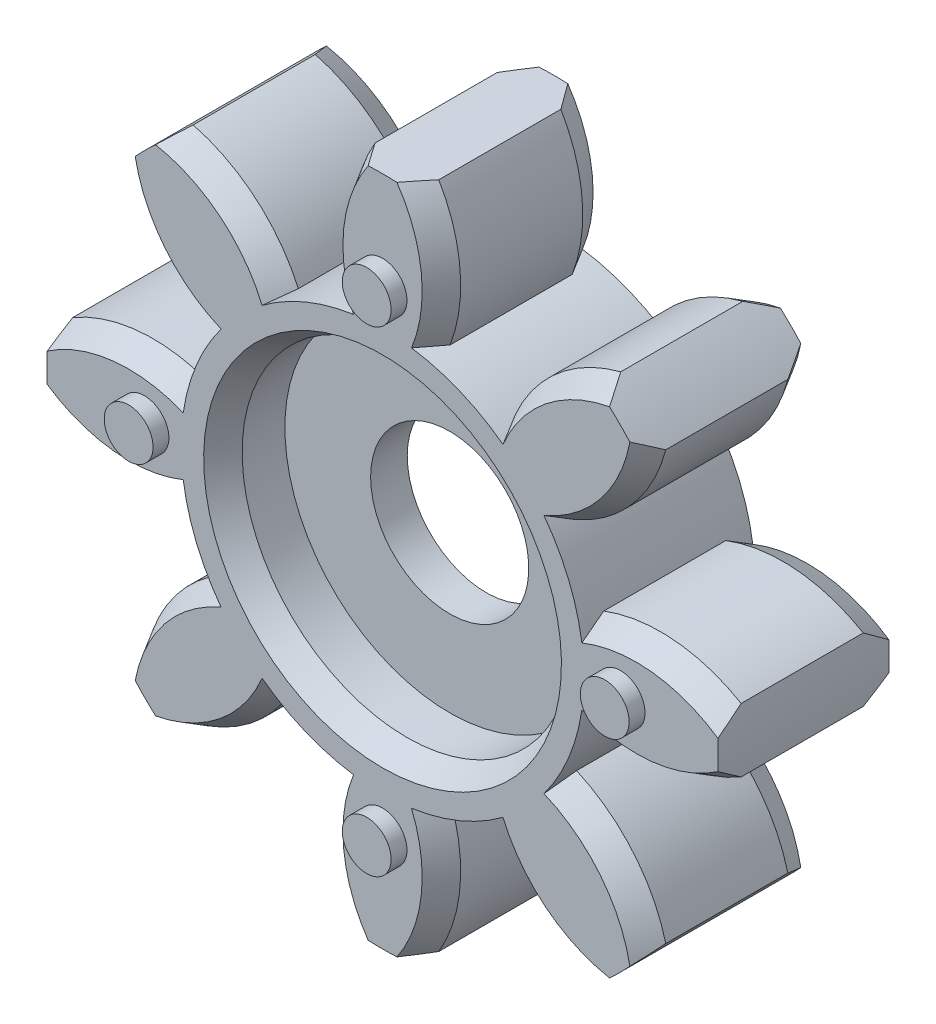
ISO-10303-21;
HEADER;
FILE_DESCRIPTION(('STEP AP214'),'2;1');
FILE_NAME('part.step','',(''),(''),'','','');
FILE_SCHEMA(('AUTOMOTIVE_DESIGN { 1 0 10303 214 1 1 1 1 }'));
ENDSEC;
DATA;
#1=APPLICATION_CONTEXT('core data for automotive mechanical design processes');
#2=APPLICATION_PROTOCOL_DEFINITION('international standard','automotive_design',2000,#1);
#3=PRODUCT_CONTEXT('',#1,'mechanical');
#4=PRODUCT('Part','Part','',(#3));
#5=PRODUCT_RELATED_PRODUCT_CATEGORY('part','',(#4));
#6=PRODUCT_DEFINITION_FORMATION('','',#4);
#7=PRODUCT_DEFINITION_CONTEXT('part definition',#1,'design');
#8=PRODUCT_DEFINITION('design','',#6,#7);
#9=PRODUCT_DEFINITION_SHAPE('','',#8);
#10=(LENGTH_UNIT() NAMED_UNIT(*) SI_UNIT(.MILLI.,.METRE.));
#11=(NAMED_UNIT(*) PLANE_ANGLE_UNIT() SI_UNIT($,.RADIAN.));
#12=(NAMED_UNIT(*) SI_UNIT($,.STERADIAN.) SOLID_ANGLE_UNIT());
#13=UNCERTAINTY_MEASURE_WITH_UNIT(LENGTH_MEASURE(1.E-05),#10,'distance_accuracy_value','');
#14=(GEOMETRIC_REPRESENTATION_CONTEXT(3) GLOBAL_UNCERTAINTY_ASSIGNED_CONTEXT((#13)) GLOBAL_UNIT_ASSIGNED_CONTEXT((#10,
#11,#12)) REPRESENTATION_CONTEXT('',''));
#15=CARTESIAN_POINT('',(0.,0.,0.));
#16=DIRECTION('',(0.,0.,1.));
#17=DIRECTION('',(1.,0.,0.));
#18=AXIS2_PLACEMENT_3D('',#15,#16,#17);
#19=CARTESIAN_POINT('',(0.,0.,1.5));
#20=DIRECTION('',(0.,0.,1.));
#21=DIRECTION('',(1.,0.,0.));
#22=AXIS2_PLACEMENT_3D('',#19,#20,#21);
#23=PLANE('',#22);
#24=CARTESIAN_POINT('',(1.0830901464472E-11,4.48974808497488E-12,1.49999999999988));
#25=DIRECTION('',(-2.25001724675E-13,0.,-1.));
#26=DIRECTION('',(-1.,0.,2.25001724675E-13));
#27=AXIS2_PLACEMENT_3D('',#24,#25,#26);
#28=CIRCLE('',#27,6.477);
#29=CARTESIAN_POINT('',(-6.47699999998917,4.48974808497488E-12,1.50000000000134));
#30=VERTEX_POINT('',#29);
#31=EDGE_CURVE('E1698',#30,#30,#28,.T.);
#32=ORIENTED_EDGE('',*,*,#31,.T.);
#33=EDGE_LOOP('',(#32));
#34=FACE_BOUND('',#33,.T.);
#35=CARTESIAN_POINT('',(0.,0.,1.5));
#36=DIRECTION('',(0.,0.,1.));
#37=DIRECTION('',(1.,0.,0.));
#38=AXIS2_PLACEMENT_3D('',#35,#36,#37);
#39=CIRCLE('',#38,13.5);
#40=CARTESIAN_POINT('',(13.5,0.,1.5));
#41=VERTEX_POINT('',#40);
#42=EDGE_CURVE('E1701',#41,#41,#39,.T.);
#43=ORIENTED_EDGE('',*,*,#42,.T.);
#44=EDGE_LOOP('',(#43));
#45=FACE_BOUND('',#44,.T.);
#46=ADVANCED_FACE('F17',(#34,#45),#23,.T.);
#47=CARTESIAN_POINT('',(0.,0.,8.3));
#48=DIRECTION('',(0.,0.,1.));
#49=DIRECTION('',(1.,0.,0.));
#50=AXIS2_PLACEMENT_3D('',#47,#48,#49);
#51=PLANE('',#50);
#52=CARTESIAN_POINT('',(0.,19.5,8.3));
#53=DIRECTION('',(0.,0.,1.));
#54=DIRECTION('',(1.,0.,0.));
#55=AXIS2_PLACEMENT_3D('',#52,#53,#54);
#56=CIRCLE('',#55,2.);
#57=CARTESIAN_POINT('',(2.,19.5,8.3));
#58=VERTEX_POINT('',#57);
#59=EDGE_CURVE('E1429',#58,#58,#56,.F.);
#60=ORIENTED_EDGE('',*,*,#59,.F.);
#61=EDGE_LOOP('',(#60));
#62=FACE_BOUND('',#61,.T.);
#63=ADVANCED_FACE('F1688',(#62),#51,.T.);
#64=CARTESIAN_POINT('',(0.,0.,7.275));
#65=DIRECTION('',(0.,0.,1.));
#66=DIRECTION('',(1.,0.,0.));
#67=AXIS2_PLACEMENT_3D('',#64,#65,#66);
#68=CYLINDRICAL_SURFACE('',#67,13.5);
#69=CARTESIAN_POINT('',(0.,0.,4.99999999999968));
#70=DIRECTION('',(0.,0.,1.));
#71=DIRECTION('',(1.,0.,0.));
#72=AXIS2_PLACEMENT_3D('',#69,#70,#71);
#73=CIRCLE('',#72,13.5000000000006);
#74=CARTESIAN_POINT('',(13.5000000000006,0.,4.99999999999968));
#75=VERTEX_POINT('',#74);
#76=EDGE_CURVE('E1426',#75,#75,#73,.T.);
#77=ORIENTED_EDGE('',*,*,#76,.T.);
#78=EDGE_LOOP('',(#77));
#79=FACE_BOUND('',#78,.T.);
#80=ORIENTED_EDGE('',*,*,#42,.F.);
#81=EDGE_LOOP('',(#80));
#82=FACE_BOUND('',#81,.T.);
#83=ADVANCED_FACE('F1685',(#79,#82),#68,.F.);
#84=CARTESIAN_POINT('',(0.,0.,8.3));
#85=DIRECTION('',(0.,0.,1.));
#86=DIRECTION('',(1.,0.,0.));
#87=AXIS2_PLACEMENT_3D('',#84,#85,#86);
#88=PLANE('',#87);
#89=CARTESIAN_POINT('',(19.5,0.,8.3));
#90=DIRECTION('',(0.,0.,1.));
#91=DIRECTION('',(1.,0.,0.));
#92=AXIS2_PLACEMENT_3D('',#89,#90,#91);
#93=CIRCLE('',#92,2.);
#94=CARTESIAN_POINT('',(21.5,0.,8.3));
#95=VERTEX_POINT('',#94);
#96=EDGE_CURVE('E1428',#95,#95,#93,.F.);
#97=ORIENTED_EDGE('',*,*,#96,.F.);
#98=EDGE_LOOP('',(#97));
#99=FACE_BOUND('',#98,.T.);
#100=ADVANCED_FACE('F1681',(#99),#88,.T.);
#101=CARTESIAN_POINT('',(0.,0.,8.3));
#102=DIRECTION('',(0.,0.,1.));
#103=DIRECTION('',(1.,0.,0.));
#104=AXIS2_PLACEMENT_3D('',#101,#102,#103);
#105=PLANE('',#104);
#106=CARTESIAN_POINT('',(0.,-19.5,8.3));
#107=DIRECTION('',(0.,0.,1.));
#108=DIRECTION('',(1.,0.,0.));
#109=AXIS2_PLACEMENT_3D('',#106,#107,#108);
#110=CIRCLE('',#109,2.);
#111=CARTESIAN_POINT('',(2.,-19.5,8.3));
#112=VERTEX_POINT('',#111);
#113=EDGE_CURVE('E2704',#112,#112,#110,.F.);
#114=ORIENTED_EDGE('',*,*,#113,.F.);
#115=EDGE_LOOP('',(#114));
#116=FACE_BOUND('',#115,.T.);
#117=ADVANCED_FACE('F1677',(#116),#105,.T.);
#118=CARTESIAN_POINT('',(0.,0.,8.3));
#119=DIRECTION('',(0.,0.,1.));
#120=DIRECTION('',(1.,0.,0.));
#121=AXIS2_PLACEMENT_3D('',#118,#119,#120);
#122=PLANE('',#121);
#123=CARTESIAN_POINT('',(-19.5,0.,8.3));
#124=DIRECTION('',(0.,0.,1.));
#125=DIRECTION('',(1.,0.,0.));
#126=AXIS2_PLACEMENT_3D('',#123,#124,#125);
#127=CIRCLE('',#126,2.);
#128=CARTESIAN_POINT('',(-17.5,0.,8.3));
#129=VERTEX_POINT('',#128);
#130=EDGE_CURVE('E2707',#129,#129,#127,.F.);
#131=ORIENTED_EDGE('',*,*,#130,.F.);
#132=EDGE_LOOP('',(#131));
#133=FACE_BOUND('',#132,.T.);
#134=ADVANCED_FACE('F1673',(#133),#122,.T.);
#135=CARTESIAN_POINT('',(1.875832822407E-12,7.815970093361E-13,-38.3));
#136=DIRECTION('',(-2.25001724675E-13,0.,-1.));
#137=DIRECTION('',(-1.,0.,2.25001724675E-13));
#138=AXIS2_PLACEMENT_3D('',#135,#136,#137);
#139=CYLINDRICAL_SURFACE('',#138,6.477);
#140=CARTESIAN_POINT('',(1.0155896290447E-11,4.21023920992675E-12,-1.49999999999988));
#141=DIRECTION('',(-2.25001724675E-13,0.,-1.));
#142=DIRECTION('',(-1.,0.,2.25001724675E-13));
#143=AXIS2_PLACEMENT_3D('',#140,#141,#142);
#144=CIRCLE('',#143,6.477);
#145=CARTESIAN_POINT('',(-6.47699999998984,4.21023920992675E-12,-1.49999999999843));
#146=VERTEX_POINT('',#145);
#147=EDGE_CURVE('E1423',#146,#146,#144,.T.);
#148=ORIENTED_EDGE('',*,*,#147,.T.);
#149=EDGE_LOOP('',(#148));
#150=FACE_BOUND('',#149,.T.);
#151=ORIENTED_EDGE('',*,*,#31,.F.);
#152=EDGE_LOOP('',(#151));
#153=FACE_BOUND('',#152,.T.);
#154=ADVANCED_FACE('F1669',(#150,#153),#139,.F.);
#155=CARTESIAN_POINT('',(0.,19.5,7.));
#156=DIRECTION('',(0.,0.,1.));
#157=DIRECTION('',(1.,0.,0.));
#158=AXIS2_PLACEMENT_3D('',#155,#156,#157);
#159=CYLINDRICAL_SURFACE('',#158,2.);
#160=ORIENTED_EDGE('',*,*,#59,.T.);
#161=EDGE_LOOP('',(#160));
#162=FACE_BOUND('',#161,.T.);
#163=CARTESIAN_POINT('',(0.,19.5,7.));
#164=DIRECTION('',(0.,0.,1.));
#165=DIRECTION('',(1.,0.,0.));
#166=AXIS2_PLACEMENT_3D('',#163,#164,#165);
#167=CIRCLE('',#166,2.);
#168=CARTESIAN_POINT('',(2.,19.5,7.));
#169=VERTEX_POINT('',#168);
#170=EDGE_CURVE('E1770',#169,#169,#167,.T.);
#171=ORIENTED_EDGE('',*,*,#170,.T.);
#172=EDGE_LOOP('',(#171));
#173=FACE_BOUND('',#172,.T.);
#174=ADVANCED_FACE('F1665',(#162,#173),#159,.T.);
#175=CARTESIAN_POINT('',(0.,0.,7.00000000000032));
#176=DIRECTION('',(0.,0.,1.));
#177=DIRECTION('',(0.,-1.,0.));
#178=AXIS2_PLACEMENT_3D('',#175,#176,#177);
#179=CONICAL_SURFACE('',#178,14.6547005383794,0.523598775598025);
#180=CARTESIAN_POINT('',(0.,0.,7.00000000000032));
#181=DIRECTION('',(0.,0.,1.));
#182=DIRECTION('',(0.,-1.,0.));
#183=AXIS2_PLACEMENT_3D('',#180,#181,#182);
#184=CIRCLE('',#183,14.6547005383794);
#185=CARTESIAN_POINT('',(0.,-14.6547005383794,7.00000000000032));
#186=VERTEX_POINT('',#185);
#187=EDGE_CURVE('E1773',#186,#186,#184,.T.);
#188=ORIENTED_EDGE('',*,*,#187,.T.);
#189=EDGE_LOOP('',(#188));
#190=FACE_BOUND('',#189,.T.);
#191=ORIENTED_EDGE('',*,*,#76,.F.);
#192=EDGE_LOOP('',(#191));
#193=FACE_BOUND('',#192,.T.);
#194=ADVANCED_FACE('F1661',(#190,#193),#179,.F.);
#195=CARTESIAN_POINT('',(19.5,0.,7.));
#196=DIRECTION('',(0.,0.,1.));
#197=DIRECTION('',(1.,0.,0.));
#198=AXIS2_PLACEMENT_3D('',#195,#196,#197);
#199=CYLINDRICAL_SURFACE('',#198,2.);
#200=ORIENTED_EDGE('',*,*,#96,.T.);
#201=EDGE_LOOP('',(#200));
#202=FACE_BOUND('',#201,.T.);
#203=CARTESIAN_POINT('',(19.5,0.,7.));
#204=DIRECTION('',(0.,0.,1.));
#205=DIRECTION('',(1.,0.,0.));
#206=AXIS2_PLACEMENT_3D('',#203,#204,#205);
#207=CIRCLE('',#206,2.);
#208=CARTESIAN_POINT('',(21.5,0.,7.));
#209=VERTEX_POINT('',#208);
#210=EDGE_CURVE('E1776',#209,#209,#207,.T.);
#211=ORIENTED_EDGE('',*,*,#210,.T.);
#212=EDGE_LOOP('',(#211));
#213=FACE_BOUND('',#212,.T.);
#214=ADVANCED_FACE('F1657',(#202,#213),#199,.T.);
#215=CARTESIAN_POINT('',(0.,-19.5,7.));
#216=DIRECTION('',(0.,0.,1.));
#217=DIRECTION('',(1.,0.,0.));
#218=AXIS2_PLACEMENT_3D('',#215,#216,#217);
#219=CYLINDRICAL_SURFACE('',#218,2.);
#220=ORIENTED_EDGE('',*,*,#113,.T.);
#221=EDGE_LOOP('',(#220));
#222=FACE_BOUND('',#221,.T.);
#223=CARTESIAN_POINT('',(0.,-19.5,7.));
#224=DIRECTION('',(0.,0.,1.));
#225=DIRECTION('',(1.,0.,0.));
#226=AXIS2_PLACEMENT_3D('',#223,#224,#225);
#227=CIRCLE('',#226,2.);
#228=CARTESIAN_POINT('',(2.,-19.5,7.));
#229=VERTEX_POINT('',#228);
#230=EDGE_CURVE('E1779',#229,#229,#227,.T.);
#231=ORIENTED_EDGE('',*,*,#230,.T.);
#232=EDGE_LOOP('',(#231));
#233=FACE_BOUND('',#232,.T.);
#234=ADVANCED_FACE('F1650',(#222,#233),#219,.T.);
#235=CARTESIAN_POINT('',(-19.5,0.,7.));
#236=DIRECTION('',(0.,0.,1.));
#237=DIRECTION('',(1.,0.,0.));
#238=AXIS2_PLACEMENT_3D('',#235,#236,#237);
#239=CYLINDRICAL_SURFACE('',#238,2.);
#240=ORIENTED_EDGE('',*,*,#130,.T.);
#241=EDGE_LOOP('',(#240));
#242=FACE_BOUND('',#241,.T.);
#243=CARTESIAN_POINT('',(-19.5,0.,7.));
#244=DIRECTION('',(0.,0.,1.));
#245=DIRECTION('',(1.,0.,0.));
#246=AXIS2_PLACEMENT_3D('',#243,#244,#245);
#247=CIRCLE('',#246,2.);
#248=CARTESIAN_POINT('',(-17.5,0.,7.));
#249=VERTEX_POINT('',#248);
#250=EDGE_CURVE('E1782',#249,#249,#247,.T.);
#251=ORIENTED_EDGE('',*,*,#250,.T.);
#252=EDGE_LOOP('',(#251));
#253=FACE_BOUND('',#252,.T.);
#254=ADVANCED_FACE('F1643',(#242,#253),#239,.T.);
#255=CARTESIAN_POINT('',(0.,0.,-1.5));
#256=DIRECTION('',(0.,0.,1.));
#257=DIRECTION('',(1.,0.,0.));
#258=AXIS2_PLACEMENT_3D('',#255,#256,#257);
#259=PLANE('',#258);
#260=ORIENTED_EDGE('',*,*,#147,.F.);
#261=EDGE_LOOP('',(#260));
#262=FACE_BOUND('',#261,.T.);
#263=CARTESIAN_POINT('',(0.,0.,-1.5));
#264=DIRECTION('',(0.,0.,1.));
#265=DIRECTION('',(1.,0.,0.));
#266=AXIS2_PLACEMENT_3D('',#263,#264,#265);
#267=CIRCLE('',#266,13.5);
#268=CARTESIAN_POINT('',(13.5,0.,-1.5));
#269=VERTEX_POINT('',#268);
#270=EDGE_CURVE('E1250',#269,#269,#267,.F.);
#271=ORIENTED_EDGE('',*,*,#270,.T.);
#272=EDGE_LOOP('',(#271));
#273=FACE_BOUND('',#272,.T.);
#274=ADVANCED_FACE('F1640',(#262,#273),#259,.F.);
#275=CARTESIAN_POINT('',(-8.610377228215,-20.7872894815,-7.));
#276=DIRECTION('',(0.,0.,1.));
#277=DIRECTION('',(1.,0.,0.));
#278=AXIS2_PLACEMENT_3D('',#275,#276,#277);
#279=CYLINDRICAL_SURFACE('',#278,13.01037722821);
#280=DIRECTION('',(0.,0.,1.));
#281=VECTOR('',#280,1.);
#282=CARTESIAN_POINT('',(2.60828842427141,-27.3760265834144,-7.));
#283=LINE('',#282,#281);
#284=CARTESIAN_POINT('',(2.60828842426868,-27.3760265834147,-4.99999999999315));
#285=VERTEX_POINT('',#284);
#286=CARTESIAN_POINT('',(2.60828842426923,-27.3760265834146,4.99999999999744));
#287=VERTEX_POINT('',#286);
#288=EDGE_CURVE('E1206',#285,#287,#283,.T.);
#289=ORIENTED_EDGE('',*,*,#288,.F.);
#290=CARTESIAN_POINT('',(-8.610377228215,-20.7872894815,-4.999999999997));
#291=DIRECTION('',(0.,0.,1.));
#292=DIRECTION('',(1.,0.,0.));
#293=AXIS2_PLACEMENT_3D('',#290,#291,#292);
#294=CIRCLE('',#293,13.0103772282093);
#295=CARTESIAN_POINT('',(3.53298721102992,-16.1173199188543,-4.99999999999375));
#296=VERTEX_POINT('',#295);
#297=EDGE_CURVE('E1214',#296,#285,#294,.F.);
#298=ORIENTED_EDGE('',*,*,#297,.F.);
#299=DIRECTION('',(0.,0.,-1.));
#300=VECTOR('',#299,1.);
#301=CARTESIAN_POINT('',(3.5329872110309,-16.1173199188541,7.7));
#302=LINE('',#301,#300);
#303=CARTESIAN_POINT('',(3.53298721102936,-16.1173199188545,4.99999999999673));
#304=VERTEX_POINT('',#303);
#305=EDGE_CURVE('E1218',#304,#296,#302,.T.);
#306=ORIENTED_EDGE('',*,*,#305,.F.);
#307=CARTESIAN_POINT('',(-8.610377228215,-20.7872894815,4.99999999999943));
#308=DIRECTION('',(0.,0.,-1.));
#309=DIRECTION('',(-1.,0.,0.));
#310=AXIS2_PLACEMENT_3D('',#307,#308,#309);
#311=CIRCLE('',#310,13.010377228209);
#312=EDGE_CURVE('E1411',#287,#304,#311,.F.);
#313=ORIENTED_EDGE('',*,*,#312,.F.);
#314=EDGE_LOOP('',(#289,#298,#306,#313));
#315=FACE_BOUND('',#314,.T.);
#316=ADVANCED_FACE('F1642',(#315),#279,.T.);
#317=CARTESIAN_POINT('',(-8.610377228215,-20.7872894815,4.99999999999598));
#318=DIRECTION('',(0.,0.,-1.));
#319=DIRECTION('',(-1.,0.,0.));
#320=AXIS2_PLACEMENT_3D('',#317,#318,#319);
#321=CONICAL_SURFACE('',#320,13.010377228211,0.523598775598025);
#322=ORIENTED_EDGE('',*,*,#312,.T.);
#323=CARTESIAN_POINT('',(2.3747953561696,-16.3282070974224,6.99997350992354));
#324=CARTESIAN_POINT('',(2.47260951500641,-16.3139803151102,6.83372435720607));
#325=CARTESIAN_POINT('',(2.57008489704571,-16.2989064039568,6.66734869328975));
#326=CARTESIAN_POINT('',(2.76437356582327,-16.2670812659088,6.33439054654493));
#327=CARTESIAN_POINT('',(2.86118690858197,-16.2503301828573,6.16780808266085));
#328=CARTESIAN_POINT('',(3.05418365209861,-16.2151652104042,5.83445414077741));
#329=CARTESIAN_POINT('',(3.15036705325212,-16.1967513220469,5.6676826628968));
#330=CARTESIAN_POINT('',(3.342128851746,-16.1582714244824,5.33396331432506));
#331=CARTESIAN_POINT('',(3.43770719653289,-16.1382052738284,5.16701542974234));
#332=CARTESIAN_POINT('',(3.53298721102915,-16.1173199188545,4.9999999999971));
#333=B_SPLINE_CURVE_WITH_KNOTS('',3,(#323,#324,#325,#326,#327,#328,#329,#330,#331,#332),
.UNSPECIFIED.,.F.,.F.,(4,2,2,2,4),(0.,0.580237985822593,1.1604262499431,1.74061414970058,
2.32085176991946),.UNSPECIFIED.);
#334=CARTESIAN_POINT('',(2.37481909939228,-16.3282089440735,6.99998732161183));
#335=VERTEX_POINT('',#334);
#336=EDGE_CURVE('E1225',#335,#304,#333,.T.);
#337=ORIENTED_EDGE('',*,*,#336,.F.);
#338=CARTESIAN_POINT('',(-8.610377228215,-20.7872894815,6.99999999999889));
#339=DIRECTION('',(0.,0.,-1.));
#340=DIRECTION('',(-1.,0.,0.));
#341=AXIS2_PLACEMENT_3D('',#338,#339,#340);
#342=CIRCLE('',#341,11.8556766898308);
#343=CARTESIAN_POINT('',(1.17918441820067,-27.4747069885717,6.99999999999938));
#344=VERTEX_POINT('',#343);
#345=EDGE_CURVE('E1720',#335,#344,#342,.T.);
#346=ORIENTED_EDGE('',*,*,#345,.T.);
#347=CARTESIAN_POINT('',(2.60828842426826,-27.3760265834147,4.99999999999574));
#348=CARTESIAN_POINT('',(2.48986001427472,-27.3873098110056,5.1669774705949));
#349=CARTESIAN_POINT('',(2.37127126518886,-27.3978332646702,5.33389266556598));
#350=CARTESIAN_POINT('',(2.13377100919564,-27.417352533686,5.66756768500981));
#351=CARTESIAN_POINT('',(2.01485952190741,-27.4263484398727,5.83432751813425));
#352=CARTESIAN_POINT('',(1.77669750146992,-27.4428058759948,6.16768103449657));
#353=CARTESIAN_POINT('',(1.65744696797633,-27.4502674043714,6.33427471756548));
#354=CARTESIAN_POINT('',(1.41858666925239,-27.4636471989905,6.66728141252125));
#355=CARTESIAN_POINT('',(1.29897688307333,-27.4695653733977,6.83369441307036));
#356=CARTESIAN_POINT('',(1.17918441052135,-27.4747069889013,6.99999998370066));
#357=B_SPLINE_CURVE_WITH_KNOTS('',3,(#347,#348,#349,#350,#351,#352,#353,#354,#355,#356),
.UNSPECIFIED.,.F.,.F.,(4,2,2,2,4),(0.,0.615065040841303,1.23009349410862,1.84512257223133,
2.4601882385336),.UNSPECIFIED.);
#358=EDGE_CURVE('E1200',#287,#344,#357,.T.);
#359=ORIENTED_EDGE('',*,*,#358,.F.);
#360=EDGE_LOOP('',(#322,#337,#346,#359));
#361=FACE_BOUND('',#360,.T.);
#362=ADVANCED_FACE('F1166',(#361),#321,.T.);
#363=CARTESIAN_POINT('',(8.610377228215,-20.7872894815,-7.));
#364=DIRECTION('',(0.,0.,1.));
#365=DIRECTION('',(1.,0.,0.));
#366=AXIS2_PLACEMENT_3D('',#363,#364,#365);
#367=CYLINDRICAL_SURFACE('',#366,13.01037722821);
#368=CARTESIAN_POINT('',(8.610377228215,-20.7872894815,4.99999999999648));
#369=DIRECTION('',(0.,0.,-1.));
#370=DIRECTION('',(-1.,0.,0.));
#371=AXIS2_PLACEMENT_3D('',#368,#369,#370);
#372=CIRCLE('',#371,13.0103772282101);
#373=CARTESIAN_POINT('',(-3.53298721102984,-16.1173199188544,4.99999999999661));
#374=VERTEX_POINT('',#373);
#375=CARTESIAN_POINT('',(-2.60828842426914,-27.3760265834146,4.99999999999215));
#376=VERTEX_POINT('',#375);
#377=EDGE_CURVE('E1406',#374,#376,#372,.F.);
#378=ORIENTED_EDGE('',*,*,#377,.F.);
#379=DIRECTION('',(0.,0.,-1.));
#380=VECTOR('',#379,1.);
#381=CARTESIAN_POINT('',(-3.53298721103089,-16.1173199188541,7.7));
#382=LINE('',#381,#380);
#383=CARTESIAN_POINT('',(-3.53298721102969,-16.1173199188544,-4.99999999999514));
#384=VERTEX_POINT('',#383);
#385=EDGE_CURVE('E1611',#384,#374,#382,.F.);
#386=ORIENTED_EDGE('',*,*,#385,.F.);
#387=CARTESIAN_POINT('',(8.610377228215,-20.7872894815,-4.99999999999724));
#388=DIRECTION('',(0.,0.,1.));
#389=DIRECTION('',(1.,0.,0.));
#390=AXIS2_PLACEMENT_3D('',#387,#388,#389);
#391=CIRCLE('',#390,13.0103772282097);
#392=CARTESIAN_POINT('',(-2.60828842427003,-27.3760265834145,-4.99999999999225));
#393=VERTEX_POINT('',#392);
#394=EDGE_CURVE('E1414',#393,#384,#391,.F.);
#395=ORIENTED_EDGE('',*,*,#394,.F.);
#396=DIRECTION('',(0.,0.,1.));
#397=VECTOR('',#396,1.);
#398=CARTESIAN_POINT('',(-2.60828842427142,-27.3760265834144,-7.));
#399=LINE('',#398,#397);
#400=EDGE_CURVE('E1181',#376,#393,#399,.F.);
#401=ORIENTED_EDGE('',*,*,#400,.F.);
#402=EDGE_LOOP('',(#378,#386,#395,#401));
#403=FACE_BOUND('',#402,.T.);
#404=ADVANCED_FACE('F1162',(#403),#367,.T.);
#405=CARTESIAN_POINT('',(8.610377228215,-20.7872894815,4.99999999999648));
#406=DIRECTION('',(0.,0.,-1.));
#407=DIRECTION('',(0.,1.,0.));
#408=AXIS2_PLACEMENT_3D('',#405,#406,#407);
#409=CONICAL_SURFACE('',#408,13.0103772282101,0.523598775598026);
#410=ORIENTED_EDGE('',*,*,#377,.T.);
#411=CARTESIAN_POINT('',(-1.17918439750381,-27.4747069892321,7.00000000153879));
#412=CARTESIAN_POINT('',(-1.29897687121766,-27.4695653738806,6.83369442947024));
#413=CARTESIAN_POINT('',(-1.4185866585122,-27.4636471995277,6.66728142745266));
#414=CARTESIAN_POINT('',(-1.65744695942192,-27.450267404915,6.33427472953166));
#415=CARTESIAN_POINT('',(-1.77669749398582,-27.4428058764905,6.16768104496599));
#416=CARTESIAN_POINT('',(-2.01485951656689,-27.4263484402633,5.83432752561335));
#417=CARTESIAN_POINT('',(-2.1337710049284,-27.4173525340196,5.66756769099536));
#418=CARTESIAN_POINT('',(-2.37127126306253,-27.3978332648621,5.33389266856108));
#419=CARTESIAN_POINT('',(-2.48986001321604,-27.3873098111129,5.16697747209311));
#420=CARTESIAN_POINT('',(-2.6082884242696,-27.3760265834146,4.99999999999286));
#421=B_SPLINE_CURVE_WITH_KNOTS('',3,(#411,#412,#413,#414,#415,#416,#417,#418,#419,#420),
.UNSPECIFIED.,.F.,.F.,(4,2,2,2,4),(0.,0.615065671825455,1.23009475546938,1.84512321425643,
2.46018826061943),.UNSPECIFIED.);
#422=CARTESIAN_POINT('',(-1.17918439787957,-27.4747069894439,7.00000000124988));
#423=VERTEX_POINT('',#422);
#424=EDGE_CURVE('E1173',#423,#376,#421,.T.);
#425=ORIENTED_EDGE('',*,*,#424,.F.);
#426=CARTESIAN_POINT('',(8.610377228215,-20.7872894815,7.));
#427=DIRECTION('',(0.,0.,-1.));
#428=DIRECTION('',(-1.,0.,0.));
#429=AXIS2_PLACEMENT_3D('',#426,#427,#428);
#430=CIRCLE('',#429,11.8556766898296);
#431=CARTESIAN_POINT('',(-2.37481712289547,-16.3282089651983,6.99998795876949));
#432=VERTEX_POINT('',#431);
#433=EDGE_CURVE('E1721',#423,#432,#430,.T.);
#434=ORIENTED_EDGE('',*,*,#433,.T.);
#435=CARTESIAN_POINT('',(-3.53298721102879,-16.1173199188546,4.99999999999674));
#436=CARTESIAN_POINT('',(-3.43770713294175,-16.1382052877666,5.16701554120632));
#437=CARTESIAN_POINT('',(-3.34212872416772,-16.1582714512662,5.33396353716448));
#438=CARTESIAN_POINT('',(-3.15036679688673,-16.1967513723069,5.66768310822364));
#439=CARTESIAN_POINT('',(-3.0541833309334,-16.2151652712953,5.83445469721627));
#440=CARTESIAN_POINT('',(-2.86118645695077,-16.2503302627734,6.1678088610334));
#441=CARTESIAN_POINT('',(-2.7643730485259,-16.267081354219,6.33439143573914));
#442=CARTESIAN_POINT('',(-2.57008424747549,-16.2989065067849,6.667349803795));
#443=CARTESIAN_POINT('',(-2.47260879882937,-16.3139804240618,6.83372557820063));
#444=CARTESIAN_POINT('',(-2.37479457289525,-16.3282072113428,6.99997484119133));
#445=B_SPLINE_CURVE_WITH_KNOTS('',3,(#435,#436,#437,#438,#439,#440,#441,#442,#443,#444),
.UNSPECIFIED.,.F.,.F.,(4,2,2,2,4),(0.,0.580238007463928,1.16042629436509,1.74061494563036,
2.32085331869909),.UNSPECIFIED.);
#446=EDGE_CURVE('E1156',#374,#432,#445,.T.);
#447=ORIENTED_EDGE('',*,*,#446,.F.);
#448=EDGE_LOOP('',(#410,#425,#434,#447));
#449=FACE_BOUND('',#448,.T.);
#450=ADVANCED_FACE('F1158',(#449),#409,.T.);
#451=CARTESIAN_POINT('',(-20.7872894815,-8.610377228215,-7.));
#452=DIRECTION('',(0.,0.,1.));
#453=DIRECTION('',(1.,0.,0.));
#454=AXIS2_PLACEMENT_3D('',#451,#452,#453);
#455=CYLINDRICAL_SURFACE('',#454,13.01037722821);
#456=DIRECTION('',(0.,0.,1.));
#457=VECTOR('',#456,1.);
#458=CARTESIAN_POINT('',(-17.5134356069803,-21.2021124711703,-7.));
#459=LINE('',#458,#457);
#460=CARTESIAN_POINT('',(-17.5134356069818,-21.2021124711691,-4.99999999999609));
#461=VERTEX_POINT('',#460);
#462=CARTESIAN_POINT('',(-17.5134356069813,-21.2021124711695,4.99999999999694));
#463=VERTEX_POINT('',#462);
#464=EDGE_CURVE('E1104',#461,#463,#459,.T.);
#465=ORIENTED_EDGE('',*,*,#464,.F.);
#466=CARTESIAN_POINT('',(-20.7872894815,-8.610377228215,-4.99999999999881));
#467=DIRECTION('',(0.,0.,1.));
#468=DIRECTION('',(1.,0.,0.));
#469=AXIS2_PLACEMENT_3D('',#466,#467,#468);
#470=CIRCLE('',#469,13.0103772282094);
#471=CARTESIAN_POINT('',(-8.89846699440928,-13.8948654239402,-4.99999999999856));
#472=VERTEX_POINT('',#471);
#473=EDGE_CURVE('E1407',#472,#461,#470,.F.);
#474=ORIENTED_EDGE('',*,*,#473,.F.);
#475=DIRECTION('',(0.,0.,-1.));
#476=VECTOR('',#475,1.);
#477=CARTESIAN_POINT('',(-8.89846699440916,-13.8948654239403,7.7));
#478=LINE('',#477,#476);
#479=CARTESIAN_POINT('',(-8.89846699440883,-13.8948654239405,4.99999999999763));
#480=VERTEX_POINT('',#479);
#481=EDGE_CURVE('E1416',#480,#472,#478,.T.);
#482=ORIENTED_EDGE('',*,*,#481,.F.);
#483=CARTESIAN_POINT('',(-20.7872894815,-8.610377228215,4.99999999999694));
#484=DIRECTION('',(0.,0.,-1.));
#485=DIRECTION('',(-1.,0.,0.));
#486=AXIS2_PLACEMENT_3D('',#483,#484,#485);
#487=CIRCLE('',#486,13.0103772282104);
#488=EDGE_CURVE('E1399',#463,#480,#487,.F.);
#489=ORIENTED_EDGE('',*,*,#488,.F.);
#490=EDGE_LOOP('',(#465,#474,#482,#489));
#491=FACE_BOUND('',#490,.T.);
#492=ADVANCED_FACE('F1115',(#491),#455,.T.);
#493=CARTESIAN_POINT('',(-20.7872894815,-8.610377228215,4.99999999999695));
#494=DIRECTION('',(0.,0.,-1.));
#495=DIRECTION('',(0.,1.,0.));
#496=AXIS2_PLACEMENT_3D('',#493,#494,#495);
#497=CONICAL_SURFACE('',#496,13.0103772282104,0.523598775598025);
#498=ORIENTED_EDGE('',*,*,#488,.T.);
#499=CARTESIAN_POINT('',(-9.86652657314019,-13.2250388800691,6.99992002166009));
#500=CARTESIAN_POINT('',(-9.78730371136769,-13.2841423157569,6.83367529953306));
#501=CARTESIAN_POINT('',(-9.7077214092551,-13.3424072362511,6.66730407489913));
#502=CARTESIAN_POINT('',(-9.54783897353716,-13.4572829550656,6.33435482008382));
#503=CARTESIAN_POINT('',(-9.46753890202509,-13.5138938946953,6.16777680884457));
#504=CARTESIAN_POINT('',(-9.30620845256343,-13.6254946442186,5.8344317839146));
#505=CARTESIAN_POINT('',(-9.22517807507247,-13.6804844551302,5.66766477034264));
#506=CARTESIAN_POINT('',(-9.06237693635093,-13.7888681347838,5.33395436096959));
#507=CARTESIAN_POINT('',(-8.98060611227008,-13.8422618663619,5.16701095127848));
#508=CARTESIAN_POINT('',(-8.89846699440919,-13.8948654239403,4.99999999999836));
#509=B_SPLINE_CURVE_WITH_KNOTS('',3,(#499,#500,#501,#502,#503,#504,#505,#506,#507,#508),
.UNSPECIFIED.,.F.,.F.,(4,2,2,2,4),(0.,0.580222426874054,1.16039513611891,1.74056748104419,
2.32078954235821),.UNSPECIFIED.);
#510=CARTESIAN_POINT('',(-9.86652772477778,-13.2252010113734,6.99997711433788));
#511=VERTEX_POINT('',#510);
#512=EDGE_CURVE('E1127',#511,#480,#509,.T.);
#513=ORIENTED_EDGE('',*,*,#512,.F.);
#514=CARTESIAN_POINT('',(-20.7872894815,-8.610377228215,7.));
#515=DIRECTION('',(0.,0.,-1.));
#516=DIRECTION('',(-1.,0.,0.));
#517=AXIS2_PLACEMENT_3D('',#514,#515,#516);
#518=CIRCLE('',#517,11.8556766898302);
#519=CARTESIAN_POINT('',(-18.5937423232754,-20.2613609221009,7.));
#520=VERTEX_POINT('',#519);
#521=EDGE_CURVE('E1725',#511,#520,#518,.T.);
#522=ORIENTED_EDGE('',*,*,#521,.T.);
#523=CARTESIAN_POINT('',(-17.513435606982,-21.2021124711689,4.99999999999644));
#524=CARTESIAN_POINT('',(-17.6051555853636,-21.126349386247,5.16697747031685));
#525=CARTESIAN_POINT('',(-17.6964516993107,-21.0499356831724,5.3338926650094));
#526=CARTESIAN_POINT('',(-17.8781919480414,-20.8957998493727,5.66756768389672));
#527=CARTESIAN_POINT('',(-17.9686361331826,-20.8180777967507,5.83432751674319));
#528=CARTESIAN_POINT('',(-18.1486792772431,-20.6613089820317,6.16768103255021));
#529=CARTESIAN_POINT('',(-18.2382782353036,-20.5822622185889,6.33427471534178));
#530=CARTESIAN_POINT('',(-18.4166389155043,-20.4228234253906,6.66728140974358));
#531=CARTESIAN_POINT('',(-18.5054005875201,-20.3424313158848,6.83369441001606));
#532=CARTESIAN_POINT('',(-18.5937423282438,-20.2613609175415,6.99999998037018));
#533=B_SPLINE_CURVE_WITH_KNOTS('',3,(#523,#524,#525,#526,#527,#528,#529,#530,#531,#532),
.UNSPECIFIED.,.F.,.F.,(4,2,2,2,4),(0.,0.615065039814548,1.23009349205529,1.84512256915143,
2.46018823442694),.UNSPECIFIED.);
#534=EDGE_CURVE('E1098',#463,#520,#533,.T.);
#535=ORIENTED_EDGE('',*,*,#534,.F.);
#536=EDGE_LOOP('',(#498,#513,#522,#535));
#537=FACE_BOUND('',#536,.T.);
#538=ADVANCED_FACE('F1111',(#537),#497,.T.);
#539=CARTESIAN_POINT('',(-8.610377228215,-20.7872894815,-7.));
#540=DIRECTION('',(0.,0.,1.));
#541=DIRECTION('',(1.,0.,0.));
#542=AXIS2_PLACEMENT_3D('',#539,#540,#541);
#543=CYLINDRICAL_SURFACE('',#542,13.01037722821);
#544=DIRECTION('',(0.,0.,1.));
#545=VECTOR('',#544,1.);
#546=CARTESIAN_POINT('',(-21.2021124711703,-17.5134356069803,-7.));
#547=LINE('',#546,#545);
#548=CARTESIAN_POINT('',(-21.2021124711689,-17.513435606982,4.99999999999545));
#549=VERTEX_POINT('',#548);
#550=CARTESIAN_POINT('',(-21.2021124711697,-17.513435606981,-4.99999999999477));
#551=VERTEX_POINT('',#550);
#552=EDGE_CURVE('E1078',#549,#551,#547,.F.);
#553=ORIENTED_EDGE('',*,*,#552,.F.);
#554=CARTESIAN_POINT('',(-8.610377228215,-20.7872894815,4.99999999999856));
#555=DIRECTION('',(0.,0.,-1.));
#556=DIRECTION('',(-1.,0.,0.));
#557=AXIS2_PLACEMENT_3D('',#554,#555,#556);
#558=CIRCLE('',#557,13.0103772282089);
#559=CARTESIAN_POINT('',(-13.8948654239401,-8.89846699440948,4.99999999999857));
#560=VERTEX_POINT('',#559);
#561=EDGE_CURVE('E1397',#560,#549,#558,.F.);
#562=ORIENTED_EDGE('',*,*,#561,.F.);
#563=DIRECTION('',(0.,0.,-1.));
#564=VECTOR('',#563,1.);
#565=CARTESIAN_POINT('',(-13.8948654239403,-8.89846699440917,7.7));
#566=LINE('',#565,#564);
#567=CARTESIAN_POINT('',(-13.8948654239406,-8.89846699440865,-4.99999999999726));
#568=VERTEX_POINT('',#567);
#569=EDGE_CURVE('E1603',#568,#560,#566,.F.);
#570=ORIENTED_EDGE('',*,*,#569,.F.);
#571=CARTESIAN_POINT('',(-8.610377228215,-20.7872894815,-4.9999999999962));
#572=DIRECTION('',(0.,0.,1.));
#573=DIRECTION('',(1.,0.,0.));
#574=AXIS2_PLACEMENT_3D('',#571,#572,#573);
#575=CIRCLE('',#574,13.0103772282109);
#576=EDGE_CURVE('E1400',#551,#568,#575,.F.);
#577=ORIENTED_EDGE('',*,*,#576,.F.);
#578=EDGE_LOOP('',(#553,#562,#570,#577));
#579=FACE_BOUND('',#578,.T.);
#580=ADVANCED_FACE('F1064',(#579),#543,.T.);
#581=CARTESIAN_POINT('',(-8.610377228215,-20.7872894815,4.99999999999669));
#582=DIRECTION('',(0.,0.,-1.));
#583=DIRECTION('',(0.,1.,0.));
#584=AXIS2_PLACEMENT_3D('',#581,#582,#583);
#585=CONICAL_SURFACE('',#584,13.01037722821,0.523598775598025);
#586=ORIENTED_EDGE('',*,*,#561,.T.);
#587=CARTESIAN_POINT('',(-20.2613609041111,-18.5937423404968,7.0000000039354));
#588=CARTESIAN_POINT('',(-20.3424313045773,-18.5054005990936,6.83369443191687));
#589=CARTESIAN_POINT('',(-20.4228234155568,-18.4166389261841,6.66728142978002));
#590=CARTESIAN_POINT('',(-20.582262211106,-18.2382782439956,6.33427473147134));
#591=CARTESIAN_POINT('',(-20.6613089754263,-18.1486792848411,6.16768104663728));
#592=CARTESIAN_POINT('',(-20.8180777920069,-17.9686361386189,5.83432752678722));
#593=CARTESIAN_POINT('',(-20.8957998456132,-17.8781919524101,5.66756769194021));
#594=CARTESIAN_POINT('',(-21.0499356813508,-17.6964517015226,5.33389266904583));
#595=CARTESIAN_POINT('',(-21.1263493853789,-17.6051555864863,5.16697747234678));
#596=CARTESIAN_POINT('',(-21.2021124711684,-17.5134356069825,4.99999999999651));
#597=B_SPLINE_CURVE_WITH_KNOTS('',3,(#587,#588,#589,#590,#591,#592,#593,#594,#595,#596),
.UNSPECIFIED.,.F.,.F.,(4,2,2,2,4),(0.,0.615065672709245,1.23009475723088,1.84512321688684,
2.46018826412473),.UNSPECIFIED.);
#598=CARTESIAN_POINT('',(-20.2613609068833,-18.5937423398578,7.0000000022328));
#599=VERTEX_POINT('',#598);
#600=EDGE_CURVE('E1070',#599,#549,#597,.T.);
#601=ORIENTED_EDGE('',*,*,#600,.F.);
#602=CARTESIAN_POINT('',(-8.610377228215,-20.7872894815,7.));
#603=DIRECTION('',(0.,0.,-1.));
#604=DIRECTION('',(-1.,0.,0.));
#605=AXIS2_PLACEMENT_3D('',#602,#603,#604);
#606=CIRCLE('',#605,11.8556766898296);
#607=CARTESIAN_POINT('',(-13.2251945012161,-9.86652898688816,6.99997789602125));
#608=VERTEX_POINT('',#607);
#609=EDGE_CURVE('E1736',#599,#608,#606,.T.);
#610=ORIENTED_EDGE('',*,*,#609,.T.);
#611=CARTESIAN_POINT('',(-13.8948654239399,-8.89846699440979,4.99999999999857));
#612=CARTESIAN_POINT('',(-13.842261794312,-8.98060622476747,5.16701118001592));
#613=CARTESIAN_POINT('',(-13.788867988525,-9.06237716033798,5.33395481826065));
#614=CARTESIAN_POINT('',(-13.6804841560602,-9.22517852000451,5.6676656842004));
#615=CARTESIAN_POINT('',(-13.6254942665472,-9.30620900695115,5.83443292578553));
#616=CARTESIAN_POINT('',(-13.5138933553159,-9.46753967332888,6.1677784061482));
#617=CARTESIAN_POINT('',(-13.4572823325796,-9.54783985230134,6.33435664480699));
#618=CARTESIAN_POINT('',(-13.3424064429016,-9.707722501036,6.66730635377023));
#619=CARTESIAN_POINT('',(-13.2841414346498,-9.78730490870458,6.83367780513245));
#620=CARTESIAN_POINT('',(-13.225037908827,-9.86652787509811,6.99992275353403));
#621=B_SPLINE_CURVE_WITH_KNOTS('',3,(#611,#612,#613,#614,#615,#616,#617,#618,#619,#620),
.UNSPECIFIED.,.F.,.F.,(4,2,2,2,4),(0.,0.580222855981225,1.16039599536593,1.74056949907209,
2.32079272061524),.UNSPECIFIED.);
#622=EDGE_CURVE('E1056',#560,#608,#621,.T.);
#623=ORIENTED_EDGE('',*,*,#622,.F.);
#624=EDGE_LOOP('',(#586,#601,#610,#623));
#625=FACE_BOUND('',#624,.T.);
#626=ADVANCED_FACE('F1059',(#625),#585,.T.);
#627=CARTESIAN_POINT('',(-20.7872894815,8.610377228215,4.99999999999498));
#628=DIRECTION('',(0.,0.,-1.));
#629=DIRECTION('',(-1.,0.,0.));
#630=AXIS2_PLACEMENT_3D('',#627,#628,#629);
#631=CONICAL_SURFACE('',#630,13.010377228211,0.523598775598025);
#632=CARTESIAN_POINT('',(-20.7872894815,8.610377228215,4.999999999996));
#633=DIRECTION('',(0.,0.,1.));
#634=DIRECTION('',(1.,0.,0.));
#635=AXIS2_PLACEMENT_3D('',#632,#633,#634);
#636=CIRCLE('',#635,13.01037722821);
#637=CARTESIAN_POINT('',(-16.1173199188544,-3.53298721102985,4.99999999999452));
#638=VERTEX_POINT('',#637);
#639=CARTESIAN_POINT('',(-27.3760265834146,-2.60828842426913,4.999999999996));
#640=VERTEX_POINT('',#639);
#641=EDGE_CURVE('E383',#638,#640,#636,.F.);
#642=ORIENTED_EDGE('',*,*,#641,.F.);
#643=CARTESIAN_POINT('',(-16.3282024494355,-2.37482731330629,6.99991919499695));
#644=CARTESIAN_POINT('',(-16.313975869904,-2.47263873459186,6.83367454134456));
#645=CARTESIAN_POINT('',(-16.2989022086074,-2.57011139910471,6.66730338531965));
#646=CARTESIAN_POINT('',(-16.2670776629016,-2.76439467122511,6.33435426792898));
#647=CARTESIAN_POINT('',(-16.2503269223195,-2.86120533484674,6.1677763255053));
#648=CARTESIAN_POINT('',(-16.2151627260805,-3.05419675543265,5.83443143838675));
#649=CARTESIAN_POINT('',(-16.1967492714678,-3.15037751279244,5.66766449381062));
#650=CARTESIAN_POINT('',(-16.1582703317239,-3.34213405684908,5.33395422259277));
#651=CARTESIAN_POINT('',(-16.1382047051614,-3.43770979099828,5.16701088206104));
#652=CARTESIAN_POINT('',(-16.1173199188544,-3.53298721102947,4.99999999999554));
#653=B_SPLINE_CURVE_WITH_KNOTS('',3,(#643,#644,#645,#646,#647,#648,#649,#650,#651,#652),
.UNSPECIFIED.,.F.,.F.,(4,2,2,2,4),(0.,0.580222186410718,1.16039465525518,1.74056675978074,
2.32078858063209),.UNSPECIFIED.);
#654=CARTESIAN_POINT('',(-16.328319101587,-2.37494231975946,6.99997687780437));
#655=VERTEX_POINT('',#654);
#656=EDGE_CURVE('E1817',#655,#638,#653,.T.);
#657=ORIENTED_EDGE('',*,*,#656,.F.);
#658=CARTESIAN_POINT('',(-20.7872894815,8.610377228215,7.));
#659=DIRECTION('',(0.,0.,-1.));
#660=DIRECTION('',(-1.,0.,0.));
#661=AXIS2_PLACEMENT_3D('',#658,#659,#660);
#662=CIRCLE('',#661,11.8556766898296);
#663=CARTESIAN_POINT('',(-27.4747069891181,-1.17918440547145,6.9999999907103));
#664=VERTEX_POINT('',#663);
#665=EDGE_CURVE('E1740',#655,#664,#662,.T.);
#666=ORIENTED_EDGE('',*,*,#665,.T.);
#667=CARTESIAN_POINT('',(-27.3760265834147,-2.60828842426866,4.99999999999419));
#668=CARTESIAN_POINT('',(-27.3873098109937,-2.48986001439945,5.16697747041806));
#669=CARTESIAN_POINT('',(-27.397833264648,-2.37127126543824,5.33389266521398));
#670=CARTESIAN_POINT('',(-27.4173525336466,-2.13377100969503,5.66756768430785));
#671=CARTESIAN_POINT('',(-27.4263484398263,-2.01485952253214,5.83432751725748));
#672=CARTESIAN_POINT('',(-27.4428058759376,-1.77669750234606,6.1676810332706));
#673=CARTESIAN_POINT('',(-27.4502674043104,-1.65744696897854,6.3342747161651));
#674=CARTESIAN_POINT('',(-27.4636471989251,-1.41858667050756,6.6672814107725));
#675=CARTESIAN_POINT('',(-27.4695653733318,-1.29897688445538,6.83369441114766));
#676=CARTESIAN_POINT('',(-27.4747069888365,-1.1791844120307,6.99999998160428));
#677=B_SPLINE_CURVE_WITH_KNOTS('',3,(#667,#668,#669,#670,#671,#672,#673,#674,#675,#676),
.UNSPECIFIED.,.F.,.F.,(4,2,2,2,4),(0.,0.615065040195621,1.23009349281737,1.84512257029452,
2.46018823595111),.UNSPECIFIED.);
#678=EDGE_CURVE('E991',#640,#664,#677,.T.);
#679=ORIENTED_EDGE('',*,*,#678,.F.);
#680=EDGE_LOOP('',(#642,#657,#666,#679));
#681=FACE_BOUND('',#680,.T.);
#682=ADVANCED_FACE('F1063',(#681),#631,.T.);
#683=CARTESIAN_POINT('',(-20.7872894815,8.610377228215,-7.));
#684=DIRECTION('',(0.,0.,1.));
#685=DIRECTION('',(1.,0.,0.));
#686=AXIS2_PLACEMENT_3D('',#683,#684,#685);
#687=CYLINDRICAL_SURFACE('',#686,13.01037722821);
#688=CARTESIAN_POINT('',(-20.7872894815,8.610377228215,-4.999999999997));
#689=DIRECTION('',(0.,0.,1.));
#690=DIRECTION('',(0.,-1.,0.));
#691=AXIS2_PLACEMENT_3D('',#688,#689,#690);
#692=CIRCLE('',#691,13.0103772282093);
#693=CARTESIAN_POINT('',(-16.1173199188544,-3.5329872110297,-4.99999999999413));
#694=VERTEX_POINT('',#693);
#695=CARTESIAN_POINT('',(-27.3760265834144,-2.60828842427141,-4.99999999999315));
#696=VERTEX_POINT('',#695);
#697=EDGE_CURVE('E1014',#694,#696,#692,.F.);
#698=ORIENTED_EDGE('',*,*,#697,.F.);
#699=DIRECTION('',(0.,0.,-1.));
#700=VECTOR('',#699,1.);
#701=CARTESIAN_POINT('',(-16.1173199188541,-3.5329872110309,7.7));
#702=LINE('',#701,#700);
#703=EDGE_CURVE('E1402',#638,#694,#702,.T.);
#704=ORIENTED_EDGE('',*,*,#703,.F.);
#705=ORIENTED_EDGE('',*,*,#641,.T.);
#706=DIRECTION('',(0.,0.,1.));
#707=VECTOR('',#706,1.);
#708=CARTESIAN_POINT('',(-27.3760265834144,-2.60828842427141,-7.));
#709=LINE('',#708,#707);
#710=EDGE_CURVE('E382',#696,#640,#709,.T.);
#711=ORIENTED_EDGE('',*,*,#710,.F.);
#712=EDGE_LOOP('',(#698,#704,#705,#711));
#713=FACE_BOUND('',#712,.T.);
#714=ADVANCED_FACE('F1000',(#713),#687,.T.);
#715=CARTESIAN_POINT('',(0.,0.,-7.));
#716=DIRECTION('',(0.,0.,1.));
#717=DIRECTION('',(1.,0.,0.));
#718=AXIS2_PLACEMENT_3D('',#715,#716,#717);
#719=CYLINDRICAL_SURFACE('',#718,27.5);
#720=DIRECTION('',(0.,0.,1.));
#721=VECTOR('',#720,1.);
#722=CARTESIAN_POINT('',(-27.3760265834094,2.60828842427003,-7.));
#723=LINE('',#722,#721);
#724=CARTESIAN_POINT('',(-27.376026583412,2.60828842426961,-4.99999999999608));
#725=VERTEX_POINT('',#724);
#726=CARTESIAN_POINT('',(-27.3760265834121,2.60828842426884,4.99999999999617));
#727=VERTEX_POINT('',#726);
#728=EDGE_CURVE('E390',#725,#727,#723,.T.);
#729=ORIENTED_EDGE('',*,*,#728,.F.);
#730=CARTESIAN_POINT('',(-27.4747069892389,1.17918439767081,-7.00000000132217));
#731=CARTESIAN_POINT('',(-27.4695653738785,1.29897687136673,-6.83369442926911));
#732=CARTESIAN_POINT('',(-27.4636471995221,1.41858665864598,-6.66728142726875));
#733=CARTESIAN_POINT('',(-27.4502674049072,1.65744695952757,-6.33427472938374));
#734=CARTESIAN_POINT('',(-27.442805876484,1.77669749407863,-6.16768104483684));
#735=CARTESIAN_POINT('',(-27.4263484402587,2.0148595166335,-5.83432752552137));
#736=CARTESIAN_POINT('',(-27.4173525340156,2.13377100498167,-5.66756769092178));
#737=CARTESIAN_POINT('',(-27.3978332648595,2.37127126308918,-5.33389266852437));
#738=CARTESIAN_POINT('',(-27.3873098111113,2.48986001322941,-5.16697747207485));
#739=CARTESIAN_POINT('',(-27.3760265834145,2.60828842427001,-4.99999999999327));
#740=B_SPLINE_CURVE_WITH_KNOTS('',3,(#730,#731,#732,#733,#734,#735,#736,#737,#738,#739),
.UNSPECIFIED.,.F.,.F.,(4,2,2,2,4),(0.,0.615065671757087,1.23009475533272,1.84512321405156,
2.46018826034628),.UNSPECIFIED.);
#741=CARTESIAN_POINT('',(-27.4747069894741,1.17918439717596,-6.99999999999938));
#742=VERTEX_POINT('',#741);
#743=EDGE_CURVE('E387',#742,#725,#740,.T.);
#744=ORIENTED_EDGE('',*,*,#743,.F.);
#745=CARTESIAN_POINT('',(0.,0.,-7.));
#746=DIRECTION('',(0.,0.,1.));
#747=DIRECTION('',(1.,0.,0.));
#748=AXIS2_PLACEMENT_3D('',#745,#746,#747);
#749=CIRCLE('',#748,27.5);
#750=CARTESIAN_POINT('',(-27.474706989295,-1.17918440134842,-6.99999999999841));
#751=VERTEX_POINT('',#750);
#752=EDGE_CURVE('E371',#742,#751,#749,.T.);
#753=ORIENTED_EDGE('',*,*,#752,.T.);
#754=CARTESIAN_POINT('',(-27.3760265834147,-2.60828842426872,-4.99999999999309));
#755=CARTESIAN_POINT('',(-27.3873098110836,-2.48986001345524,-5.1669774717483));
#756=CARTESIAN_POINT('',(-27.3978332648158,-2.37127126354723,-5.33389266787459));
#757=CARTESIAN_POINT('',(-27.4173525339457,-2.13377100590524,-5.66756768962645));
#758=CARTESIAN_POINT('',(-27.4263484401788,-2.01485951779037,-5.83432752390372));
#759=CARTESIAN_POINT('',(-27.4428058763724,-1.77669749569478,-6.16768104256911));
#760=CARTESIAN_POINT('',(-27.450267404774,-1.65744696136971,-6.33427472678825));
#761=CARTESIAN_POINT('',(-27.4636471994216,-1.41858666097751,-6.66728142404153));
#762=CARTESIAN_POINT('',(-27.4695653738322,-1.29897687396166,-6.83369442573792));
#763=CARTESIAN_POINT('',(-27.4747069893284,-1.17918440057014,-6.99999999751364));
#764=B_SPLINE_CURVE_WITH_KNOTS('',3,(#754,#755,#756,#757,#758,#759,#760,#761,#762,#763),
.UNSPECIFIED.,.F.,.F.,(4,2,2,2,4),(0.,0.615065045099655,1.23009350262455,1.84512258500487,
2.46018825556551),.UNSPECIFIED.);
#765=EDGE_CURVE('E393',#696,#751,#764,.T.);
#766=ORIENTED_EDGE('',*,*,#765,.F.);
#767=ORIENTED_EDGE('',*,*,#710,.T.);
#768=ORIENTED_EDGE('',*,*,#678,.T.);
#769=CARTESIAN_POINT('',(0.,0.,7.));
#770=DIRECTION('',(0.,0.,1.));
#771=DIRECTION('',(1.,0.,0.));
#772=AXIS2_PLACEMENT_3D('',#769,#770,#771);
#773=CIRCLE('',#772,27.5);
#774=CARTESIAN_POINT('',(-27.4747069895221,1.17918439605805,6.99999999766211));
#775=VERTEX_POINT('',#774);
#776=EDGE_CURVE('E1745',#664,#775,#773,.F.);
#777=ORIENTED_EDGE('',*,*,#776,.T.);
#778=CARTESIAN_POINT('',(-27.3760265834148,2.60828842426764,4.99999999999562));
#779=CARTESIAN_POINT('',(-27.3873098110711,2.48986001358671,5.16697747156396));
#780=CARTESIAN_POINT('',(-27.3978332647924,2.37127126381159,5.3338926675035));
#781=CARTESIAN_POINT('',(-27.4173525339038,2.13377100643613,5.66756768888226));
#782=CARTESIAN_POINT('',(-27.4263484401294,2.01485951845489,5.83432752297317));
#783=CARTESIAN_POINT('',(-27.4428058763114,1.77669749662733,6.16768104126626));
#784=CARTESIAN_POINT('',(-27.450267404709,1.65744696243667,6.33427472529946));
#785=CARTESIAN_POINT('',(-27.4636471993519,1.41858666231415,6.66728142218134));
#786=CARTESIAN_POINT('',(-27.469565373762,1.29897687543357,6.83369442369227));
#787=CARTESIAN_POINT('',(-27.4747069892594,1.17918440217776,6.99999999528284));
#788=B_SPLINE_CURVE_WITH_KNOTS('',3,(#778,#779,#780,#781,#782,#783,#784,#785,#786,#787),
.UNSPECIFIED.,.F.,.F.,(4,2,2,2,4),(0.,0.615065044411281,1.23009350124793,1.84512258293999,
2.46018825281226),.UNSPECIFIED.);
#789=EDGE_CURVE('E982',#727,#775,#788,.T.);
#790=ORIENTED_EDGE('',*,*,#789,.F.);
#791=EDGE_LOOP('',(#729,#744,#753,#766,#767,#768,#777,#790));
#792=FACE_BOUND('',#791,.T.);
#793=ADVANCED_FACE('F388',(#792),#719,.T.);
#794=CARTESIAN_POINT('',(-20.7872894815,-8.610377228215,-7.));
#795=DIRECTION('',(0.,0.,1.));
#796=DIRECTION('',(1.,0.,0.));
#797=AXIS2_PLACEMENT_3D('',#794,#795,#796);
#798=CYLINDRICAL_SURFACE('',#797,13.01037722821);
#799=ORIENTED_EDGE('',*,*,#728,.T.);
#800=CARTESIAN_POINT('',(-20.7872894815,-8.610377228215,4.99999999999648));
#801=DIRECTION('',(0.,0.,-1.));
#802=DIRECTION('',(-1.,0.,0.));
#803=AXIS2_PLACEMENT_3D('',#800,#801,#802);
#804=CIRCLE('',#803,13.0103772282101);
#805=CARTESIAN_POINT('',(-16.1173199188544,3.53298721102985,4.99999999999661));
#806=VERTEX_POINT('',#805);
#807=EDGE_CURVE('E990',#806,#727,#804,.F.);
#808=ORIENTED_EDGE('',*,*,#807,.F.);
#809=DIRECTION('',(0.,0.,-1.));
#810=VECTOR('',#809,1.);
#811=CARTESIAN_POINT('',(-16.1173199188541,3.53298721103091,7.7));
#812=LINE('',#811,#810);
#813=CARTESIAN_POINT('',(-16.1173199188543,3.53298721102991,-4.99999999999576));
#814=VERTEX_POINT('',#813);
#815=EDGE_CURVE('E1599',#814,#806,#812,.F.);
#816=ORIENTED_EDGE('',*,*,#815,.F.);
#817=CARTESIAN_POINT('',(-20.7872894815,-8.610377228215,-4.9999999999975));
#818=DIRECTION('',(0.,0.,1.));
#819=DIRECTION('',(0.,-1.,0.));
#820=AXIS2_PLACEMENT_3D('',#817,#818,#819);
#821=CIRCLE('',#820,13.0103772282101);
#822=EDGE_CURVE('E392',#725,#814,#821,.F.);
#823=ORIENTED_EDGE('',*,*,#822,.F.);
#824=EDGE_LOOP('',(#799,#808,#816,#823));
#825=FACE_BOUND('',#824,.T.);
#826=ADVANCED_FACE('F978',(#825),#798,.T.);
#827=CARTESIAN_POINT('',(-20.7872894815,-8.610377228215,4.99999999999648));
#828=DIRECTION('',(0.,0.,-1.));
#829=DIRECTION('',(-1.,0.,0.));
#830=AXIS2_PLACEMENT_3D('',#827,#828,#829);
#831=CONICAL_SURFACE('',#830,13.0103772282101,0.523598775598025);
#832=ORIENTED_EDGE('',*,*,#807,.T.);
#833=ORIENTED_EDGE('',*,*,#789,.T.);
#834=CARTESIAN_POINT('',(-20.7872894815,-8.610377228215,7.));
#835=DIRECTION('',(0.,0.,-1.));
#836=DIRECTION('',(-1.,0.,0.));
#837=AXIS2_PLACEMENT_3D('',#834,#835,#836);
#838=CIRCLE('',#837,11.8556766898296);
#839=CARTESIAN_POINT('',(-16.3283143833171,2.37493533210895,6.99997787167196));
#840=VERTEX_POINT('',#839);
#841=EDGE_CURVE('E1747',#775,#840,#838,.T.);
#842=ORIENTED_EDGE('',*,*,#841,.T.);
#843=CARTESIAN_POINT('',(-16.1173199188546,3.53298721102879,4.99999999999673));
#844=CARTESIAN_POINT('',(-16.1382047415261,3.43770962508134,5.16701117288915));
#845=CARTESIAN_POINT('',(-16.1582704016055,3.34213372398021,5.33395480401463));
#846=CARTESIAN_POINT('',(-16.1967494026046,3.15037684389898,5.66766565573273));
#847=CARTESIAN_POINT('',(-16.2151628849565,3.05419591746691,5.83443289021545));
#848=CARTESIAN_POINT('',(-16.2503271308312,2.86120415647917,6.16777835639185));
#849=CARTESIAN_POINT('',(-16.2670778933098,2.76439332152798,6.33435658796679));
#850=CARTESIAN_POINT('',(-16.2989024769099,2.5701097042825,6.66730628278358));
#851=CARTESIAN_POINT('',(-16.3139761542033,2.47263686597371,6.83367772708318));
#852=CARTESIAN_POINT('',(-16.328202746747,2.37482526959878,6.99992266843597));
#853=B_SPLINE_CURVE_WITH_KNOTS('',3,(#843,#844,#845,#846,#847,#848,#849,#850,#851,#852),
.UNSPECIFIED.,.F.,.F.,(4,2,2,2,4),(0.,0.580222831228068,1.1603959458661,1.74056942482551,
2.32079262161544),.UNSPECIFIED.);
#854=EDGE_CURVE('E969',#806,#840,#853,.T.);
#855=ORIENTED_EDGE('',*,*,#854,.F.);
#856=EDGE_LOOP('',(#832,#833,#842,#855));
#857=FACE_BOUND('',#856,.T.);
#858=ADVANCED_FACE('F974',(#857),#831,.T.);
#859=CARTESIAN_POINT('',(-8.610377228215,20.7872894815,-7.));
#860=DIRECTION('',(0.,0.,1.));
#861=DIRECTION('',(1.,0.,0.));
#862=AXIS2_PLACEMENT_3D('',#859,#860,#861);
#863=CYLINDRICAL_SURFACE('',#862,13.01037722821);
#864=DIRECTION('',(0.,0.,1.));
#865=VECTOR('',#864,1.);
#866=CARTESIAN_POINT('',(-21.2021124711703,17.5134356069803,-7.));
#867=LINE('',#866,#865);
#868=CARTESIAN_POINT('',(-21.2021124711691,17.5134356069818,-4.99999999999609));
#869=VERTEX_POINT('',#868);
#870=CARTESIAN_POINT('',(-21.2021124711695,17.5134356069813,4.99999999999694));
#871=VERTEX_POINT('',#870);
#872=EDGE_CURVE('E919',#869,#871,#867,.T.);
#873=ORIENTED_EDGE('',*,*,#872,.F.);
#874=CARTESIAN_POINT('',(-8.610377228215,20.7872894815,-4.99999999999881));
#875=DIRECTION('',(0.,0.,1.));
#876=DIRECTION('',(1.,0.,0.));
#877=AXIS2_PLACEMENT_3D('',#874,#875,#876);
#878=CIRCLE('',#877,13.0103772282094);
#879=CARTESIAN_POINT('',(-13.8948654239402,8.89846699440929,-4.99999999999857));
#880=VERTEX_POINT('',#879);
#881=EDGE_CURVE('E1382',#880,#869,#878,.F.);
#882=ORIENTED_EDGE('',*,*,#881,.F.);
#883=DIRECTION('',(0.,0.,-1.));
#884=VECTOR('',#883,1.);
#885=CARTESIAN_POINT('',(-13.8948654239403,8.89846699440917,7.7));
#886=LINE('',#885,#884);
#887=CARTESIAN_POINT('',(-13.8948654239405,8.89846699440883,4.99999999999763));
#888=VERTEX_POINT('',#887);
#889=EDGE_CURVE('E1387',#888,#880,#886,.T.);
#890=ORIENTED_EDGE('',*,*,#889,.F.);
#891=CARTESIAN_POINT('',(-8.610377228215,20.7872894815,4.99999999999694));
#892=DIRECTION('',(0.,0.,-1.));
#893=DIRECTION('',(-1.,0.,0.));
#894=AXIS2_PLACEMENT_3D('',#891,#892,#893);
#895=CIRCLE('',#894,13.0103772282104);
#896=EDGE_CURVE('E989',#871,#888,#895,.F.);
#897=ORIENTED_EDGE('',*,*,#896,.F.);
#898=EDGE_LOOP('',(#873,#882,#890,#897));
#899=FACE_BOUND('',#898,.T.);
#900=ADVANCED_FACE('F931',(#899),#863,.T.);
#901=CARTESIAN_POINT('',(-8.610377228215,20.7872894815,4.99999999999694));
#902=DIRECTION('',(0.,0.,-1.));
#903=DIRECTION('',(-1.,0.,0.));
#904=AXIS2_PLACEMENT_3D('',#901,#902,#903);
#905=CONICAL_SURFACE('',#904,13.0103772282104,0.523598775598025);
#906=ORIENTED_EDGE('',*,*,#896,.T.);
#907=CARTESIAN_POINT('',(-13.2250211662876,9.86655031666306,6.999969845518));
#908=CARTESIAN_POINT('',(-13.2841262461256,9.78732554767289,6.83372099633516));
#909=CARTESIAN_POINT('',(-13.3423927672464,9.70774132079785,6.66734563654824));
#910=CARTESIAN_POINT('',(-13.4572716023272,9.54785500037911,6.3343880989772));
#911=CARTESIAN_POINT('',(-13.5138840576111,9.46755296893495,6.16780594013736));
#912=CARTESIAN_POINT('',(-13.6254877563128,9.30621856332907,5.8344526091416));
#913=CARTESIAN_POINT('',(-13.6804790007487,9.22518618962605,5.66768143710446));
#914=CARTESIAN_POINT('',(-13.7888654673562,9.06238102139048,5.33396270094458));
#915=CARTESIAN_POINT('',(-13.8422605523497,8.9806081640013,5.16701512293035));
#916=CARTESIAN_POINT('',(-13.8948654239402,8.89846699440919,4.99999999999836));
#917=B_SPLINE_CURVE_WITH_KNOTS('',3,(#907,#908,#909,#910,#911,#912,#913,#914,#915,#916),
.UNSPECIFIED.,.F.,.F.,(4,2,2,2,4),(0.,0.580236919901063,1.16042411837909,1.74061095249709,
2.32084750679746),.UNSPECIFIED.);
#918=CARTESIAN_POINT('',(-13.2250417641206,9.86653269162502,6.99998556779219));
#919=VERTEX_POINT('',#918);
#920=EDGE_CURVE('E943',#919,#888,#917,.T.);
#921=ORIENTED_EDGE('',*,*,#920,.F.);
#922=CARTESIAN_POINT('',(-8.610377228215,20.7872894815,7.));
#923=DIRECTION('',(0.,0.,-1.));
#924=DIRECTION('',(-1.,0.,0.));
#925=AXIS2_PLACEMENT_3D('',#922,#923,#924);
#926=CIRCLE('',#925,11.8556766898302);
#927=CARTESIAN_POINT('',(-20.2613610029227,18.5937422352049,7.));
#928=VERTEX_POINT('',#927);
#929=EDGE_CURVE('E1751',#919,#928,#926,.T.);
#930=ORIENTED_EDGE('',*,*,#929,.T.);
#931=CARTESIAN_POINT('',(-21.2021124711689,17.513435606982,4.99999999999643));
#932=CARTESIAN_POINT('',(-21.1263493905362,17.6051555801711,5.16697746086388));
#933=CARTESIAN_POINT('',(-21.0499356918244,17.6964516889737,5.33389264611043));
#934=CARTESIAN_POINT('',(-20.8957998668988,17.8781919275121,5.66756764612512));
#935=CARTESIAN_POINT('',(-20.8180778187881,17.9686361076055,5.83432746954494));
#936=CARTESIAN_POINT('',(-20.6613090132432,18.1486792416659,6.16768096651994));
#937=CARTESIAN_POINT('',(-20.5822622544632,18.2382781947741,6.33427463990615));
#938=CARTESIAN_POINT('',(-20.4228234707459,18.4166388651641,6.66728131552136));
#939=CARTESIAN_POINT('',(-20.3424313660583,18.5054005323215,6.83369430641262));
#940=CARTESIAN_POINT('',(-20.2613609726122,18.5937422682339,6.99999986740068));
#941=B_SPLINE_CURVE_WITH_KNOTS('',3,(#931,#932,#933,#934,#935,#936,#937,#938,#939,#940),
.UNSPECIFIED.,.F.,.F.,(4,2,2,2,4),(0.,0.615065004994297,1.23009342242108,1.8451224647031,
2.46018809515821),.UNSPECIFIED.);
#942=EDGE_CURVE('E911',#871,#928,#941,.T.);
#943=ORIENTED_EDGE('',*,*,#942,.F.);
#944=EDGE_LOOP('',(#906,#921,#930,#943));
#945=FACE_BOUND('',#944,.T.);
#946=ADVANCED_FACE('F926',(#945),#905,.T.);
#947=CARTESIAN_POINT('',(-20.7872894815,8.610377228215,-7.));
#948=DIRECTION('',(0.,0.,1.));
#949=DIRECTION('',(1.,0.,0.));
#950=AXIS2_PLACEMENT_3D('',#947,#948,#949);
#951=CYLINDRICAL_SURFACE('',#950,13.01037722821);
#952=DIRECTION('',(0.,0.,1.));
#953=VECTOR('',#952,1.);
#954=CARTESIAN_POINT('',(-17.5134356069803,21.2021124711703,-7.));
#955=LINE('',#954,#953);
#956=CARTESIAN_POINT('',(-17.513435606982,21.2021124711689,4.99999999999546));
#957=VERTEX_POINT('',#956);
#958=CARTESIAN_POINT('',(-17.513435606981,21.2021124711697,-4.99999999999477));
#959=VERTEX_POINT('',#958);
#960=EDGE_CURVE('E891',#957,#959,#955,.F.);
#961=ORIENTED_EDGE('',*,*,#960,.F.);
#962=CARTESIAN_POINT('',(-20.7872894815,8.610377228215,4.99999999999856));
#963=DIRECTION('',(0.,0.,-1.));
#964=DIRECTION('',(-1.,0.,0.));
#965=AXIS2_PLACEMENT_3D('',#962,#963,#964);
#966=CIRCLE('',#965,13.0103772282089);
#967=CARTESIAN_POINT('',(-8.89846699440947,13.8948654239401,4.99999999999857));
#968=VERTEX_POINT('',#967);
#969=EDGE_CURVE('E1371',#968,#957,#966,.F.);
#970=ORIENTED_EDGE('',*,*,#969,.F.);
#971=DIRECTION('',(0.,0.,-1.));
#972=VECTOR('',#971,1.);
#973=CARTESIAN_POINT('',(-8.89846699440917,13.8948654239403,7.7));
#974=LINE('',#973,#972);
#975=CARTESIAN_POINT('',(-8.89846699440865,13.8948654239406,-4.99999999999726));
#976=VERTEX_POINT('',#975);
#977=EDGE_CURVE('E872',#976,#968,#974,.F.);
#978=ORIENTED_EDGE('',*,*,#977,.F.);
#979=CARTESIAN_POINT('',(-20.7872894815,8.610377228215,-4.9999999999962));
#980=DIRECTION('',(0.,0.,1.));
#981=DIRECTION('',(1.,0.,0.));
#982=AXIS2_PLACEMENT_3D('',#979,#980,#981);
#983=CIRCLE('',#982,13.0103772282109);
#984=EDGE_CURVE('E890',#959,#976,#983,.F.);
#985=ORIENTED_EDGE('',*,*,#984,.F.);
#986=EDGE_LOOP('',(#961,#970,#978,#985));
#987=FACE_BOUND('',#986,.T.);
#988=ADVANCED_FACE('F930',(#987),#951,.T.);
#989=CARTESIAN_POINT('',(-20.7872894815,8.610377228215,4.9999999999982));
#990=DIRECTION('',(0.,0.,-1.));
#991=DIRECTION('',(-1.,0.,0.));
#992=AXIS2_PLACEMENT_3D('',#989,#990,#991);
#993=CONICAL_SURFACE('',#992,13.0103772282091,0.523598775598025);
#994=ORIENTED_EDGE('',*,*,#969,.T.);
#995=CARTESIAN_POINT('',(-18.593742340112,20.2613609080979,7.00000000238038));
#996=CARTESIAN_POINT('',(-18.5054005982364,20.3424313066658,6.83369443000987));
#997=CARTESIAN_POINT('',(-18.4166389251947,20.4228234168,6.6672814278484));
#998=CARTESIAN_POINT('',(-18.2382782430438,20.5822622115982,6.33427472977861));
#999=CARTESIAN_POINT('',(-18.1486792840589,20.6613089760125,6.16768104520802));
#1000=CARTESIAN_POINT('',(-17.9686361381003,20.8180777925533,5.83432752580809));
#1001=CARTESIAN_POINT('',(-17.8781919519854,20.8957998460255,5.66756769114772));
#1002=CARTESIAN_POINT('',(-17.6964517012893,21.0499356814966,5.3338926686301));
#1003=CARTESIAN_POINT('',(-17.6051555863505,21.1263493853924,5.16697747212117));
#1004=CARTESIAN_POINT('',(-17.5134356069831,21.202112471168,4.99999999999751));
#1005=B_SPLINE_CURVE_WITH_KNOTS('',3,(#995,#996,#997,#998,#999,#1000,#1001,#1002,#1003,#1004),
.UNSPECIFIED.,.F.,.F.,(4,2,2,2,4),(0.,0.615065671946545,1.23009475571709,1.845123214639,
2.46018826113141),.UNSPECIFIED.);
#1006=CARTESIAN_POINT('',(-18.5937423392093,20.2613609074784,7.00000000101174));
#1007=VERTEX_POINT('',#1006);
#1008=EDGE_CURVE('E892',#1007,#957,#1005,.T.);
#1009=ORIENTED_EDGE('',*,*,#1008,.F.);
#1010=CARTESIAN_POINT('',(-20.7872894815,8.610377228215,6.99999999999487));
#1011=DIRECTION('',(0.,0.,-1.));
#1012=DIRECTION('',(-1.,0.,0.));
#1013=AXIS2_PLACEMENT_3D('',#1010,#1011,#1012);
#1014=CIRCLE('',#1013,11.8556766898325);
#1015=CARTESIAN_POINT('',(-9.86656186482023,13.2250128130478,6.99999873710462));
#1016=VERTEX_POINT('',#1015);
#1017=EDGE_CURVE('E1718',#1007,#1016,#1014,.T.);
#1018=ORIENTED_EDGE('',*,*,#1017,.T.);
#1019=CARTESIAN_POINT('',(-8.89846699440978,13.8948654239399,4.99999999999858));
#1020=CARTESIAN_POINT('',(-8.98060927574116,13.8422598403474,5.16701738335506));
#1021=CARTESIAN_POINT('',(-9.06238323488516,13.7888640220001,5.33396721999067));
#1022=CARTESIAN_POINT('',(-9.22519058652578,13.6804760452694,5.6676904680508));
#1023=CARTESIAN_POINT('',(-9.30622404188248,13.6254840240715,5.8344638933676));
#1024=CARTESIAN_POINT('',(-9.4675605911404,13.513878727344,6.16782172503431));
#1025=CARTESIAN_POINT('',(-9.5478636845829,13.4572654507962,6.33440613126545));
#1026=CARTESIAN_POINT('',(-9.70775210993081,13.342384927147,6.66736815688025));
#1027=CARTESIAN_POINT('',(-9.7873373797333,13.2841175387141,6.83374575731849));
#1028=CARTESIAN_POINT('',(-9.86656318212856,13.2250115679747,6.99999684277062));
#1029=B_SPLINE_CURVE_WITH_KNOTS('',3,(#1019,#1020,#1021,#1022,#1023,#1024,#1025,#1026,#1027,
#1028),.UNSPECIFIED.,.F.,.F.,(4,2,2,2,4),(0.,0.580244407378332,1.1604390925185,1.74063414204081,
2.32087891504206),.UNSPECIFIED.);
#1030=EDGE_CURVE('E865',#968,#1016,#1029,.T.);
#1031=ORIENTED_EDGE('',*,*,#1030,.F.);
#1032=EDGE_LOOP('',(#994,#1009,#1018,#1031));
#1033=FACE_BOUND('',#1032,.T.);
#1034=ADVANCED_FACE('F830',(#1033),#993,.T.);
#1035=CARTESIAN_POINT('',(8.610377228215,20.7872894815,-7.));
#1036=DIRECTION('',(0.,0.,1.));
#1037=DIRECTION('',(1.,0.,0.));
#1038=AXIS2_PLACEMENT_3D('',#1035,#1036,#1037);
#1039=CYLINDRICAL_SURFACE('',#1038,13.01037722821);
#1040=DIRECTION('',(0.,0.,1.));
#1041=VECTOR('',#1040,1.);
#1042=CARTESIAN_POINT('',(-2.60828842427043,27.3760265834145,-7.));
#1043=LINE('',#1042,#1041);
#1044=CARTESIAN_POINT('',(-2.60828842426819,27.3760265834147,-4.99999999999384));
#1045=VERTEX_POINT('',#1044);
#1046=CARTESIAN_POINT('',(-2.60828842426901,27.3760265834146,4.99999999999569));
#1047=VERTEX_POINT('',#1046);
#1048=EDGE_CURVE('E815',#1045,#1047,#1043,.T.);
#1049=ORIENTED_EDGE('',*,*,#1048,.F.);
#1050=CARTESIAN_POINT('',(8.610377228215,20.7872894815,-4.99999999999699));
#1051=DIRECTION('',(0.,0.,1.));
#1052=DIRECTION('',(1.,0.,0.));
#1053=AXIS2_PLACEMENT_3D('',#1050,#1051,#1052);
#1054=CIRCLE('',#1053,13.0103772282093);
#1055=CARTESIAN_POINT('',(-3.53298721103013,16.1173199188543,-4.99999999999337));
#1056=VERTEX_POINT('',#1055);
#1057=EDGE_CURVE('E1374',#1056,#1045,#1054,.F.);
#1058=ORIENTED_EDGE('',*,*,#1057,.F.);
#1059=DIRECTION('',(0.,0.,-1.));
#1060=VECTOR('',#1059,1.);
#1061=CARTESIAN_POINT('',(-3.53298721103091,16.1173199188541,7.7));
#1062=LINE('',#1061,#1060);
#1063=CARTESIAN_POINT('',(-3.53298721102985,16.1173199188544,4.99999999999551));
#1064=VERTEX_POINT('',#1063);
#1065=EDGE_CURVE('E876',#1064,#1056,#1062,.T.);
#1066=ORIENTED_EDGE('',*,*,#1065,.F.);
#1067=CARTESIAN_POINT('',(8.610377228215,20.7872894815,4.99999999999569));
#1068=DIRECTION('',(0.,0.,-1.));
#1069=DIRECTION('',(-1.,0.,0.));
#1070=AXIS2_PLACEMENT_3D('',#1067,#1068,#1069);
#1071=CIRCLE('',#1070,13.0103772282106);
#1072=EDGE_CURVE('E1367',#1047,#1064,#1071,.F.);
#1073=ORIENTED_EDGE('',*,*,#1072,.F.);
#1074=EDGE_LOOP('',(#1049,#1058,#1066,#1073));
#1075=FACE_BOUND('',#1074,.T.);
#1076=ADVANCED_FACE('F826',(#1075),#1039,.T.);
#1077=CARTESIAN_POINT('',(8.610377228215,20.7872894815,4.99999999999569));
#1078=DIRECTION('',(0.,0.,-1.));
#1079=DIRECTION('',(-1.,0.,0.));
#1080=AXIS2_PLACEMENT_3D('',#1077,#1078,#1079);
#1081=CONICAL_SURFACE('',#1080,13.0103772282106,0.523598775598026);
#1082=ORIENTED_EDGE('',*,*,#1072,.T.);
#1083=CARTESIAN_POINT('',(-2.3747943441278,16.328207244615,6.99997523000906));
#1084=CARTESIAN_POINT('',(-2.47260858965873,16.3139804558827,6.83372593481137));
#1085=CARTESIAN_POINT('',(-2.57008405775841,16.2989065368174,6.66735012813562));
#1086=CARTESIAN_POINT('',(-2.76437289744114,16.2670813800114,6.33439169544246));
#1087=CARTESIAN_POINT('',(-2.86118632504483,16.2503302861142,6.16780908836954));
#1088=CARTESIAN_POINT('',(-3.05418323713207,16.2151652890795,5.83445485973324));
#1089=CARTESIAN_POINT('',(-3.15036672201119,16.1967513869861,5.66768323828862));
#1090=CARTESIAN_POINT('',(-3.34212868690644,16.1582714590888,5.33396360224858));
#1091=CARTESIAN_POINT('',(-3.4377071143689,16.1382052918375,5.1670155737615));
#1092=CARTESIAN_POINT('',(-3.53298721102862,16.1173199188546,4.99999999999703));
#1093=B_SPLINE_CURVE_WITH_KNOTS('',3,(#1083,#1084,#1085,#1086,#1087,#1088,#1089,#1090,#1091,
#1092),.UNSPECIFIED.,.F.,.F.,(4,2,2,2,4),(0.,0.580238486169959,1.16042725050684,
1.74061565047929,2.32085377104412),.UNSPECIFIED.);
#1094=CARTESIAN_POINT('',(-2.37481654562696,16.3282089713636,6.99998814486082));
#1095=VERTEX_POINT('',#1094);
#1096=EDGE_CURVE('E844',#1095,#1064,#1093,.T.);
#1097=ORIENTED_EDGE('',*,*,#1096,.F.);
#1098=CARTESIAN_POINT('',(8.610377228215,20.7872894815,6.99999999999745));
#1099=DIRECTION('',(0.,0.,-1.));
#1100=DIRECTION('',(-1.,0.,0.));
#1101=AXIS2_PLACEMENT_3D('',#1098,#1099,#1100);
#1102=CIRCLE('',#1101,11.8556766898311);
#1103=CARTESIAN_POINT('',(-1.1791845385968,27.4747069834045,6.99999999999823));
#1104=VERTEX_POINT('',#1103);
#1105=EDGE_CURVE('E1715',#1095,#1104,#1102,.T.);
#1106=ORIENTED_EDGE('',*,*,#1105,.T.);
#1107=CARTESIAN_POINT('',(-2.60828842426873,27.3760265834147,4.99999999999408));
#1108=CARTESIAN_POINT('',(-2.48986002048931,27.3873098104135,5.16697746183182));
#1109=CARTESIAN_POINT('',(-2.3712712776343,27.3978332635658,5.33389264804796));
#1110=CARTESIAN_POINT('',(-2.13377103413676,27.4173525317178,5.66756764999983));
#1111=CARTESIAN_POINT('',(-2.01485955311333,27.4263484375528,5.83432747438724));
#1112=CARTESIAN_POINT('',(-1.77669754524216,27.4428058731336,6.16768097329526));
#1113=CARTESIAN_POINT('',(-1.65744701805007,27.4502674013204,6.33427464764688));
#1114=CARTESIAN_POINT('',(-1.41858673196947,27.4636471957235,6.66728132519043));
#1115=CARTESIAN_POINT('',(-1.29897695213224,27.4695653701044,6.83369431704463));
#1116=CARTESIAN_POINT('',(-1.17918448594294,27.4747069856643,6.99999987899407));
#1117=B_SPLINE_CURVE_WITH_KNOTS('',3,(#1107,#1108,#1109,#1110,#1111,#1112,#1113,#1114,#1115,
#1116),.UNSPECIFIED.,.F.,.F.,(4,2,2,2,4),(0.,0.615065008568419,1.23009342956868,
1.84512247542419,2.46018810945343),.UNSPECIFIED.);
#1118=EDGE_CURVE('E809',#1047,#1104,#1117,.T.);
#1119=ORIENTED_EDGE('',*,*,#1118,.F.);
#1120=EDGE_LOOP('',(#1082,#1097,#1106,#1119));
#1121=FACE_BOUND('',#1120,.T.);
#1122=ADVANCED_FACE('F822',(#1121),#1081,.T.);
#1123=CARTESIAN_POINT('',(-8.610377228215,20.7872894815,-7.));
#1124=DIRECTION('',(0.,0.,1.));
#1125=DIRECTION('',(1.,0.,0.));
#1126=AXIS2_PLACEMENT_3D('',#1123,#1124,#1125);
#1127=CYLINDRICAL_SURFACE('',#1126,13.01037722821);
#1128=DIRECTION('',(0.,0.,-1.));
#1129=VECTOR('',#1128,1.);
#1130=CARTESIAN_POINT('',(3.5329872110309,16.1173199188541,7.7));
#1131=LINE('',#1130,#1129);
#1132=CARTESIAN_POINT('',(3.53298721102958,16.1173199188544,-4.99999999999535));
#1133=VERTEX_POINT('',#1132);
#1134=CARTESIAN_POINT('',(3.53298721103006,16.1173199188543,4.99999999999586));
#1135=VERTEX_POINT('',#1134);
#1136=EDGE_CURVE('E1585',#1133,#1135,#1131,.F.);
#1137=ORIENTED_EDGE('',*,*,#1136,.F.);
#1138=CARTESIAN_POINT('',(-8.610377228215,20.7872894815,-4.99999999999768));
#1139=DIRECTION('',(0.,0.,1.));
#1140=DIRECTION('',(1.,0.,0.));
#1141=AXIS2_PLACEMENT_3D('',#1138,#1139,#1140);
#1142=CIRCLE('',#1141,13.0103772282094);
#1143=CARTESIAN_POINT('',(2.60828842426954,27.3760265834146,-4.99999999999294));
#1144=VERTEX_POINT('',#1143);
#1145=EDGE_CURVE('E1361',#1144,#1133,#1142,.F.);
#1146=ORIENTED_EDGE('',*,*,#1145,.F.);
#1147=DIRECTION('',(0.,0.,1.));
#1148=VECTOR('',#1147,1.);
#1149=CARTESIAN_POINT('',(2.60828842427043,27.3760265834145,-7.));
#1150=LINE('',#1149,#1148);
#1151=CARTESIAN_POINT('',(2.60828842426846,27.3760265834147,4.99999999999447));
#1152=VERTEX_POINT('',#1151);
#1153=EDGE_CURVE('E788',#1152,#1144,#1150,.F.);
#1154=ORIENTED_EDGE('',*,*,#1153,.F.);
#1155=CARTESIAN_POINT('',(-8.610377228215,20.7872894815,4.99999999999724));
#1156=DIRECTION('',(0.,0.,-1.));
#1157=DIRECTION('',(-1.,0.,0.));
#1158=AXIS2_PLACEMENT_3D('',#1155,#1156,#1157);
#1159=CIRCLE('',#1158,13.0103772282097);
#1160=EDGE_CURVE('E1357',#1135,#1152,#1159,.F.);
#1161=ORIENTED_EDGE('',*,*,#1160,.F.);
#1162=EDGE_LOOP('',(#1137,#1146,#1154,#1161));
#1163=FACE_BOUND('',#1162,.T.);
#1164=ADVANCED_FACE('F774',(#1163),#1127,.T.);
#1165=CARTESIAN_POINT('',(-8.610377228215,20.7872894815,4.99999999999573));
#1166=DIRECTION('',(0.,0.,-1.));
#1167=DIRECTION('',(-1.,0.,0.));
#1168=AXIS2_PLACEMENT_3D('',#1165,#1166,#1167);
#1169=CONICAL_SURFACE('',#1168,13.0103772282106,0.523598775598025);
#1170=ORIENTED_EDGE('',*,*,#1160,.T.);
#1171=CARTESIAN_POINT('',(1.17918439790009,27.474706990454,7.0000000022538));
#1172=CARTESIAN_POINT('',(1.29897687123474,27.4695653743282,6.83369442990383));
#1173=CARTESIAN_POINT('',(1.41858665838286,27.4636471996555,6.667281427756));
#1174=CARTESIAN_POINT('',(1.65744695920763,27.4502674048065,6.33427472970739));
#1175=CARTESIAN_POINT('',(1.77669749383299,27.4428058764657,6.16768104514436));
#1176=CARTESIAN_POINT('',(2.01485951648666,27.4263484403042,5.8343275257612));
#1177=CARTESIAN_POINT('',(2.1337710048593,27.4173525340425,5.66756769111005));
#1178=CARTESIAN_POINT('',(2.37127126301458,27.3978332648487,5.33389266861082));
#1179=CARTESIAN_POINT('',(2.48986001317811,27.3873098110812,5.16697747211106));
#1180=CARTESIAN_POINT('',(2.60828842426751,27.3760265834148,4.9999999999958));
#1181=B_SPLINE_CURVE_WITH_KNOTS('',3,(#1171,#1172,#1173,#1174,#1175,#1176,#1177,#1178,#1179,
#1180),.UNSPECIFIED.,.F.,.F.,(4,2,2,2,4),(0.,0.615065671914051,1.23009475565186,
1.84512321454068,2.46018826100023),.UNSPECIFIED.);
#1182=CARTESIAN_POINT('',(1.1791843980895,27.4747069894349,7.00000000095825));
#1183=VERTEX_POINT('',#1182);
#1184=EDGE_CURVE('E779',#1183,#1152,#1181,.T.);
#1185=ORIENTED_EDGE('',*,*,#1184,.F.);
#1186=CARTESIAN_POINT('',(-8.610377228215,20.7872894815,7.));
#1187=DIRECTION('',(0.,0.,-1.));
#1188=DIRECTION('',(-1.,0.,0.));
#1189=AXIS2_PLACEMENT_3D('',#1186,#1187,#1188);
#1190=CIRCLE('',#1189,11.8556766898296);
#1191=CARTESIAN_POINT('',(2.37493655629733,16.3283176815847,6.99997802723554));
#1192=VERTEX_POINT('',#1191);
#1193=EDGE_CURVE('E1717',#1183,#1192,#1190,.T.);
#1194=ORIENTED_EDGE('',*,*,#1193,.T.);
#1195=CARTESIAN_POINT('',(3.53298721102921,16.1173199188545,4.99999999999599));
#1196=CARTESIAN_POINT('',(3.43770963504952,16.1382047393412,5.16701115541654));
#1197=CARTESIAN_POINT('',(3.34213374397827,16.1582703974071,5.3339547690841));
#1198=CARTESIAN_POINT('',(3.15037688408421,16.1967493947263,5.66766558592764));
#1199=CARTESIAN_POINT('',(3.05419596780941,16.2151628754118,5.83443280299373));
#1200=CARTESIAN_POINT('',(2.86120422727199,16.2503271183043,6.16777823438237));
#1201=CARTESIAN_POINT('',(2.76439340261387,16.2670778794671,6.33435644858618));
#1202=CARTESIAN_POINT('',(2.57010980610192,16.2989024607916,6.6673061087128));
#1203=CARTESIAN_POINT('',(2.47263697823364,16.3139761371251,6.83367753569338));
#1204=CARTESIAN_POINT('',(2.37482539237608,16.3282027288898,6.999922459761));
#1205=B_SPLINE_CURVE_WITH_KNOTS('',3,(#1195,#1196,#1197,#1198,#1199,#1200,#1201,#1202,#1203,
#1204),.UNSPECIFIED.,.F.,.F.,(4,2,2,2,4),(0.,0.580222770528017,1.16039582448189,
1.74056924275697,2.32079237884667),.UNSPECIFIED.);
#1206=EDGE_CURVE('E768',#1135,#1192,#1205,.T.);
#1207=ORIENTED_EDGE('',*,*,#1206,.F.);
#1208=EDGE_LOOP('',(#1170,#1185,#1194,#1207));
#1209=FACE_BOUND('',#1208,.T.);
#1210=ADVANCED_FACE('F770',(#1209),#1169,.T.);
#1211=CARTESIAN_POINT('',(20.7872894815,8.610377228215,-7.));
#1212=DIRECTION('',(0.,0.,1.));
#1213=DIRECTION('',(1.,0.,0.));
#1214=AXIS2_PLACEMENT_3D('',#1211,#1212,#1213);
#1215=CYLINDRICAL_SURFACE('',#1214,13.01037722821);
#1216=DIRECTION('',(0.,0.,1.));
#1217=VECTOR('',#1216,1.);
#1218=CARTESIAN_POINT('',(17.5134356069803,21.2021124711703,-7.));
#1219=LINE('',#1218,#1217);
#1220=CARTESIAN_POINT('',(17.5134356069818,21.2021124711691,-4.99999999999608));
#1221=VERTEX_POINT('',#1220);
#1222=CARTESIAN_POINT('',(17.5134356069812,21.2021124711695,4.99999999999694));
#1223=VERTEX_POINT('',#1222);
#1224=EDGE_CURVE('E716',#1221,#1223,#1219,.T.);
#1225=ORIENTED_EDGE('',*,*,#1224,.F.);
#1226=CARTESIAN_POINT('',(20.7872894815,8.610377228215,-4.99999999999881));
#1227=DIRECTION('',(0.,0.,1.));
#1228=DIRECTION('',(1.,0.,0.));
#1229=AXIS2_PLACEMENT_3D('',#1226,#1227,#1228);
#1230=CIRCLE('',#1229,13.0103772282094);
#1231=CARTESIAN_POINT('',(8.89846699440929,13.8948654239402,-4.99999999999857));
#1232=VERTEX_POINT('',#1231);
#1233=EDGE_CURVE('E1358',#1232,#1221,#1230,.F.);
#1234=ORIENTED_EDGE('',*,*,#1233,.F.);
#1235=DIRECTION('',(0.,0.,-1.));
#1236=VECTOR('',#1235,1.);
#1237=CARTESIAN_POINT('',(8.89846699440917,13.8948654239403,7.7));
#1238=LINE('',#1237,#1236);
#1239=CARTESIAN_POINT('',(8.89846699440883,13.8948654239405,4.99999999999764));
#1240=VERTEX_POINT('',#1239);
#1241=EDGE_CURVE('E1363',#1240,#1232,#1238,.T.);
#1242=ORIENTED_EDGE('',*,*,#1241,.F.);
#1243=CARTESIAN_POINT('',(20.7872894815,8.610377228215,4.99999999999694));
#1244=DIRECTION('',(0.,0.,-1.));
#1245=DIRECTION('',(-1.,0.,0.));
#1246=AXIS2_PLACEMENT_3D('',#1243,#1244,#1245);
#1247=CIRCLE('',#1246,13.0103772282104);
#1248=EDGE_CURVE('E1350',#1223,#1240,#1247,.F.);
#1249=ORIENTED_EDGE('',*,*,#1248,.F.);
#1250=EDGE_LOOP('',(#1225,#1234,#1242,#1249));
#1251=FACE_BOUND('',#1250,.T.);
#1252=ADVANCED_FACE('F727',(#1251),#1215,.T.);
#1253=CARTESIAN_POINT('',(20.7872894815,8.610377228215,4.99999999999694));
#1254=DIRECTION('',(0.,0.,-1.));
#1255=DIRECTION('',(-1.,0.,0.));
#1256=AXIS2_PLACEMENT_3D('',#1253,#1254,#1255);
#1257=CONICAL_SURFACE('',#1256,13.0103772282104,0.523598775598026);
#1258=ORIENTED_EDGE('',*,*,#1248,.T.);
#1259=CARTESIAN_POINT('',(9.86654990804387,13.2250214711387,6.99996898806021));
#1260=CARTESIAN_POINT('',(9.78732517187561,13.2841265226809,6.83372020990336));
#1261=CARTESIAN_POINT('',(9.70774097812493,13.342393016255,6.66734492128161));
#1262=CARTESIAN_POINT('',(9.54785472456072,13.4572717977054,6.33438752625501));
#1263=CARTESIAN_POINT('',(9.46755272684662,13.5138842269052,6.1678054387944));
#1264=CARTESIAN_POINT('',(9.30621838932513,13.6254878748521,5.83445225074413));
#1265=CARTESIAN_POINT('',(9.22518604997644,13.6804790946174,5.66768115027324));
#1266=CARTESIAN_POINT('',(9.06238095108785,13.788865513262,5.3339625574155));
#1267=CARTESIAN_POINT('',(8.98060812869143,13.8422605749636,5.16701505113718));
#1268=CARTESIAN_POINT('',(8.89846699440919,13.8948654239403,4.99999999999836));
#1269=B_SPLINE_CURVE_WITH_KNOTS('',3,(#1259,#1260,#1261,#1262,#1263,#1264,#1265,#1266,#1267,
#1268),.UNSPECIFIED.,.F.,.F.,(4,2,2,2,4),(0.,0.580236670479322,1.1604236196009,1.74061020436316,
2.3208465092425),.UNSPECIFIED.);
#1270=CARTESIAN_POINT('',(9.86653178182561,13.2250426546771,6.99998515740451));
#1271=VERTEX_POINT('',#1270);
#1272=EDGE_CURVE('E739',#1271,#1240,#1269,.T.);
#1273=ORIENTED_EDGE('',*,*,#1272,.F.);
#1274=CARTESIAN_POINT('',(20.7872894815,8.610377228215,7.));
#1275=DIRECTION('',(0.,0.,-1.));
#1276=DIRECTION('',(-1.,0.,0.));
#1277=AXIS2_PLACEMENT_3D('',#1274,#1275,#1276);
#1278=CIRCLE('',#1277,11.8556766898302);
#1279=CARTESIAN_POINT('',(18.5937422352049,20.2613610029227,7.));
#1280=VERTEX_POINT('',#1279);
#1281=EDGE_CURVE('E1759',#1271,#1280,#1278,.T.);
#1282=ORIENTED_EDGE('',*,*,#1281,.T.);
#1283=CARTESIAN_POINT('',(17.513435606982,21.2021124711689,4.99999999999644));
#1284=CARTESIAN_POINT('',(17.6051555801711,21.1263493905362,5.16697746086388));
#1285=CARTESIAN_POINT('',(17.6964516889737,21.0499356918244,5.33389264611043));
#1286=CARTESIAN_POINT('',(17.8781919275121,20.8957998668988,5.66756764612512));
#1287=CARTESIAN_POINT('',(17.9686361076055,20.8180778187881,5.83432746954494));
#1288=CARTESIAN_POINT('',(18.1486792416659,20.6613090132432,6.16768096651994));
#1289=CARTESIAN_POINT('',(18.2382781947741,20.5822622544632,6.33427463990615));
#1290=CARTESIAN_POINT('',(18.4166388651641,20.4228234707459,6.66728131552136));
#1291=CARTESIAN_POINT('',(18.5054005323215,20.3424313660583,6.83369430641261));
#1292=CARTESIAN_POINT('',(18.5937422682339,20.2613609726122,6.99999986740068));
#1293=B_SPLINE_CURVE_WITH_KNOTS('',3,(#1283,#1284,#1285,#1286,#1287,#1288,#1289,#1290,#1291,
#1292),.UNSPECIFIED.,.F.,.F.,(4,2,2,2,4),(0.,0.615065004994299,1.23009342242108,1.8451224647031,
2.4601880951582),.UNSPECIFIED.);
#1294=EDGE_CURVE('E710',#1223,#1280,#1293,.T.);
#1295=ORIENTED_EDGE('',*,*,#1294,.F.);
#1296=EDGE_LOOP('',(#1258,#1273,#1282,#1295));
#1297=FACE_BOUND('',#1296,.T.);
#1298=ADVANCED_FACE('F723',(#1297),#1257,.T.);
#1299=CARTESIAN_POINT('',(8.610377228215,20.7872894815,-7.));
#1300=DIRECTION('',(0.,0.,1.));
#1301=DIRECTION('',(1.,0.,0.));
#1302=AXIS2_PLACEMENT_3D('',#1299,#1300,#1301);
#1303=CYLINDRICAL_SURFACE('',#1302,13.01037722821);
#1304=DIRECTION('',(0.,0.,1.));
#1305=VECTOR('',#1304,1.);
#1306=CARTESIAN_POINT('',(21.2021124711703,17.5134356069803,-7.));
#1307=LINE('',#1306,#1305);
#1308=CARTESIAN_POINT('',(21.2021124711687,17.5134356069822,4.99999999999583));
#1309=VERTEX_POINT('',#1308);
#1310=CARTESIAN_POINT('',(21.2021124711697,17.513435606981,-4.99999999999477));
#1311=VERTEX_POINT('',#1310);
#1312=EDGE_CURVE('E690',#1309,#1311,#1307,.F.);
#1313=ORIENTED_EDGE('',*,*,#1312,.F.);
#1314=CARTESIAN_POINT('',(8.610377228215,20.7872894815,4.99999999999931));
#1315=DIRECTION('',(0.,0.,-1.));
#1316=DIRECTION('',(-1.,0.,0.));
#1317=AXIS2_PLACEMENT_3D('',#1314,#1315,#1316);
#1318=CIRCLE('',#1317,13.0103772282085);
#1319=CARTESIAN_POINT('',(13.8948654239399,8.89846699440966,4.99999999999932));
#1320=VERTEX_POINT('',#1319);
#1321=EDGE_CURVE('E1348',#1320,#1309,#1318,.F.);
#1322=ORIENTED_EDGE('',*,*,#1321,.F.);
#1323=DIRECTION('',(0.,0.,-1.));
#1324=VECTOR('',#1323,1.);
#1325=CARTESIAN_POINT('',(13.8948654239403,8.89846699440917,7.7));
#1326=LINE('',#1325,#1324);
#1327=CARTESIAN_POINT('',(13.8948654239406,8.89846699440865,-4.99999999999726));
#1328=VERTEX_POINT('',#1327);
#1329=EDGE_CURVE('E668',#1328,#1320,#1326,.F.);
#1330=ORIENTED_EDGE('',*,*,#1329,.F.);
#1331=CARTESIAN_POINT('',(8.610377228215,20.7872894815,-4.99999999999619));
#1332=DIRECTION('',(0.,0.,1.));
#1333=DIRECTION('',(1.,0.,0.));
#1334=AXIS2_PLACEMENT_3D('',#1331,#1332,#1333);
#1335=CIRCLE('',#1334,13.0103772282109);
#1336=EDGE_CURVE('E1351',#1311,#1328,#1335,.F.);
#1337=ORIENTED_EDGE('',*,*,#1336,.F.);
#1338=EDGE_LOOP('',(#1313,#1322,#1330,#1337));
#1339=FACE_BOUND('',#1338,.T.);
#1340=ADVANCED_FACE('F676',(#1339),#1303,.T.);
#1341=CARTESIAN_POINT('',(8.610377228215,20.7872894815,4.99999999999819));
#1342=DIRECTION('',(0.,0.,-1.));
#1343=DIRECTION('',(-1.,0.,0.));
#1344=AXIS2_PLACEMENT_3D('',#1341,#1342,#1343);
#1345=CONICAL_SURFACE('',#1344,13.0103772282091,0.523598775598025);
#1346=ORIENTED_EDGE('',*,*,#1321,.T.);
#1347=CARTESIAN_POINT('',(20.2613609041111,18.5937423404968,7.00000000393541));
#1348=CARTESIAN_POINT('',(20.3424313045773,18.5054005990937,6.83369443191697));
#1349=CARTESIAN_POINT('',(20.4228234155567,18.4166389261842,6.66728142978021));
#1350=CARTESIAN_POINT('',(20.5822622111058,18.2382782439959,6.33427473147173));
#1351=CARTESIAN_POINT('',(20.661308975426,18.1486792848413,6.16768104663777));
#1352=CARTESIAN_POINT('',(20.8180777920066,17.9686361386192,5.8343275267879));
#1353=CARTESIAN_POINT('',(20.8957998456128,17.8781919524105,5.66756769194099));
#1354=CARTESIAN_POINT('',(21.0499356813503,17.6964517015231,5.3338926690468));
#1355=CARTESIAN_POINT('',(21.1263493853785,17.6051555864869,5.16697747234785));
#1356=CARTESIAN_POINT('',(21.2021124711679,17.5134356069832,4.99999999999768));
#1357=B_SPLINE_CURVE_WITH_KNOTS('',3,(#1347,#1348,#1349,#1350,#1351,#1352,#1353,#1354,#1355,
#1356),.UNSPECIFIED.,.F.,.F.,(4,2,2,2,4),(0.,0.61506567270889,1.23009475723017,1.84512321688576,
2.4601882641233),.UNSPECIFIED.);
#1358=CARTESIAN_POINT('',(20.261360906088,18.5937423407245,7.00000000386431));
#1359=VERTEX_POINT('',#1358);
#1360=EDGE_CURVE('E682',#1359,#1309,#1357,.T.);
#1361=ORIENTED_EDGE('',*,*,#1360,.F.);
#1362=CARTESIAN_POINT('',(8.610377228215,20.7872894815,7.00000000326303));
#1363=DIRECTION('',(0.,0.,-1.));
#1364=DIRECTION('',(-1.,0.,0.));
#1365=AXIS2_PLACEMENT_3D('',#1362,#1363,#1364);
#1366=CIRCLE('',#1365,11.8556766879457);
#1367=CARTESIAN_POINT('',(13.2250128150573,9.86656186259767,6.9999987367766));
#1368=VERTEX_POINT('',#1367);
#1369=EDGE_CURVE('E1763',#1359,#1368,#1366,.T.);
#1370=ORIENTED_EDGE('',*,*,#1369,.T.);
#1371=CARTESIAN_POINT('',(13.8948654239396,8.89846699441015,4.99999999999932));
#1372=CARTESIAN_POINT('',(13.8422598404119,8.98060927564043,5.16701738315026));
#1373=CARTESIAN_POINT('',(13.7888640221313,9.06238323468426,5.3339672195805));
#1374=CARTESIAN_POINT('',(13.6804760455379,9.22519058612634,5.66769046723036));
#1375=CARTESIAN_POINT('',(13.6254840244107,9.30622404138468,5.83446389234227));
#1376=CARTESIAN_POINT('',(13.5138787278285,9.46756059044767,6.16782172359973));
#1377=CARTESIAN_POINT('',(13.4572654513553,9.54786368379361,6.33440612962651));
#1378=CARTESIAN_POINT('',(13.3423849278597,9.70775210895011,6.66736815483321));
#1379=CARTESIAN_POINT('',(13.2841175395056,9.78733737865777,6.83374575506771));
#1380=CARTESIAN_POINT('',(13.2250115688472,9.86656318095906,6.99999684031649));
#1381=B_SPLINE_CURVE_WITH_KNOTS('',3,(#1371,#1372,#1373,#1374,#1375,#1376,#1377,#1378,#1379,
#1380),.UNSPECIFIED.,.F.,.F.,(4,2,2,2,4),(0.,0.580244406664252,1.16043909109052,
1.74063413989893,2.32087891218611),.UNSPECIFIED.);
#1382=EDGE_CURVE('E658',#1320,#1368,#1381,.T.);
#1383=ORIENTED_EDGE('',*,*,#1382,.F.);
#1384=EDGE_LOOP('',(#1346,#1361,#1370,#1383));
#1385=FACE_BOUND('',#1384,.T.);
#1386=ADVANCED_FACE('F671',(#1385),#1345,.T.);
#1387=CARTESIAN_POINT('',(20.7872894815,-8.610377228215,4.99999999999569));
#1388=DIRECTION('',(0.,0.,-1.));
#1389=DIRECTION('',(-1.,0.,0.));
#1390=AXIS2_PLACEMENT_3D('',#1387,#1388,#1389);
#1391=CONICAL_SURFACE('',#1390,13.0103772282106,0.523598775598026);
#1392=CARTESIAN_POINT('',(20.7872894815,-8.610377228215,4.999999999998));
#1393=DIRECTION('',(0.,0.,1.));
#1394=DIRECTION('',(1.,0.,0.));
#1395=AXIS2_PLACEMENT_3D('',#1392,#1393,#1394);
#1396=CIRCLE('',#1395,13.01037722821);
#1397=CARTESIAN_POINT('',(16.1173199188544,3.53298721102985,4.99999999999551));
#1398=VERTEX_POINT('',#1397);
#1399=CARTESIAN_POINT('',(27.3760265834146,2.60828842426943,4.99999999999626));
#1400=VERTEX_POINT('',#1399);
#1401=EDGE_CURVE('E1343',#1398,#1400,#1396,.F.);
#1402=ORIENTED_EDGE('',*,*,#1401,.F.);
#1403=CARTESIAN_POINT('',(16.3282067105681,2.37479801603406,6.99996898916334));
#1404=CARTESIAN_POINT('',(16.3139799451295,2.47261194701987,6.83372021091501));
#1405=CARTESIAN_POINT('',(16.2989060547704,2.57008710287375,6.66734492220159));
#1406=CARTESIAN_POINT('',(16.2670809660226,2.76437532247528,6.33438752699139));
#1407=CARTESIAN_POINT('',(16.2503299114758,2.86118844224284,6.16780543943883));
#1408=CARTESIAN_POINT('',(16.2151650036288,3.0541847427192,5.83445225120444));
#1409=CARTESIAN_POINT('',(16.1967511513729,3.15036792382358,5.66768115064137));
#1410=CARTESIAN_POINT('',(16.1582713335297,3.3421292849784,5.33396255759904));
#1411=CARTESIAN_POINT('',(16.1382052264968,3.43770741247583,5.16701505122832));
#1412=CARTESIAN_POINT('',(16.1173199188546,3.53298721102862,4.99999999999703));
#1413=B_SPLINE_CURVE_WITH_KNOTS('',3,(#1403,#1404,#1405,#1406,#1407,#1408,#1409,#1410,#1411,
#1412),.UNSPECIFIED.,.F.,.F.,(4,2,2,2,4),(0.,0.580236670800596,1.16042362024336,
1.74061020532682,2.32084651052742),.UNSPECIFIED.);
#1414=CARTESIAN_POINT('',(16.3282088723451,2.37482581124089,6.99998515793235));
#1415=VERTEX_POINT('',#1414);
#1416=EDGE_CURVE('E1889',#1415,#1398,#1413,.T.);
#1417=ORIENTED_EDGE('',*,*,#1416,.F.);
#1418=CARTESIAN_POINT('',(20.7872894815,-8.610377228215,7.));
#1419=DIRECTION('',(0.,0.,-1.));
#1420=DIRECTION('',(-1.,0.,0.));
#1421=AXIS2_PLACEMENT_3D('',#1418,#1419,#1420);
#1422=CIRCLE('',#1421,11.8556766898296);
#1423=CARTESIAN_POINT('',(27.4747069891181,1.17918440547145,6.9999999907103));
#1424=VERTEX_POINT('',#1423);
#1425=EDGE_CURVE('E1765',#1415,#1424,#1422,.T.);
#1426=ORIENTED_EDGE('',*,*,#1425,.T.);
#1427=CARTESIAN_POINT('',(27.3760265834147,2.60828842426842,4.99999999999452));
#1428=CARTESIAN_POINT('',(27.3873098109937,2.48986001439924,5.16697747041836));
#1429=CARTESIAN_POINT('',(27.397833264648,2.37127126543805,5.33389266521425));
#1430=CARTESIAN_POINT('',(27.4173525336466,2.13377100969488,5.66756768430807));
#1431=CARTESIAN_POINT('',(27.4263484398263,2.014859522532,5.83432751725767));
#1432=CARTESIAN_POINT('',(27.4428058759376,1.77669750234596,6.16768103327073));
#1433=CARTESIAN_POINT('',(27.4502674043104,1.65744696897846,6.33427471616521));
#1434=CARTESIAN_POINT('',(27.4636471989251,1.41858667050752,6.66728141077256));
#1435=CARTESIAN_POINT('',(27.4695653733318,1.29897688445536,6.83369441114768));
#1436=CARTESIAN_POINT('',(27.4747069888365,1.1791844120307,6.99999998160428));
#1437=B_SPLINE_CURVE_WITH_KNOTS('',3,(#1427,#1428,#1429,#1430,#1431,#1432,#1433,#1434,#1435,
#1436),.UNSPECIFIED.,.F.,.F.,(4,2,2,2,4),(0.,0.61506504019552,1.23009349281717,1.84512257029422,
2.4601882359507),.UNSPECIFIED.);
#1438=EDGE_CURVE('E604',#1400,#1424,#1437,.T.);
#1439=ORIENTED_EDGE('',*,*,#1438,.F.);
#1440=EDGE_LOOP('',(#1402,#1417,#1426,#1439));
#1441=FACE_BOUND('',#1440,.T.);
#1442=ADVANCED_FACE('F675',(#1441),#1391,.T.);
#1443=CARTESIAN_POINT('',(20.7872894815,-8.610377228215,-7.));
#1444=DIRECTION('',(0.,0.,1.));
#1445=DIRECTION('',(1.,0.,0.));
#1446=AXIS2_PLACEMENT_3D('',#1443,#1444,#1445);
#1447=CYLINDRICAL_SURFACE('',#1446,13.01037722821);
#1448=DIRECTION('',(0.,0.,1.));
#1449=VECTOR('',#1448,1.);
#1450=CARTESIAN_POINT('',(27.3760265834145,2.60828842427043,-7.));
#1451=LINE('',#1450,#1449);
#1452=CARTESIAN_POINT('',(27.3760265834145,2.60828842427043,-4.99999999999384));
#1453=VERTEX_POINT('',#1452);
#1454=EDGE_CURVE('E1340',#1453,#1400,#1451,.T.);
#1455=ORIENTED_EDGE('',*,*,#1454,.F.);
#1456=CARTESIAN_POINT('',(20.7872894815,-8.610377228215,-4.99999999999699));
#1457=DIRECTION('',(0.,0.,1.));
#1458=DIRECTION('',(0.,-1.,0.));
#1459=AXIS2_PLACEMENT_3D('',#1456,#1457,#1458);
#1460=CIRCLE('',#1459,13.0103772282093);
#1461=CARTESIAN_POINT('',(16.1173199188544,3.53298721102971,-4.99999999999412));
#1462=VERTEX_POINT('',#1461);
#1463=EDGE_CURVE('E620',#1462,#1453,#1460,.F.);
#1464=ORIENTED_EDGE('',*,*,#1463,.F.);
#1465=DIRECTION('',(0.,0.,-1.));
#1466=VECTOR('',#1465,1.);
#1467=CARTESIAN_POINT('',(16.1173199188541,3.53298721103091,7.7));
#1468=LINE('',#1467,#1466);
#1469=EDGE_CURVE('E1353',#1398,#1462,#1468,.T.);
#1470=ORIENTED_EDGE('',*,*,#1469,.F.);
#1471=ORIENTED_EDGE('',*,*,#1401,.T.);
#1472=EDGE_LOOP('',(#1455,#1464,#1470,#1471));
#1473=FACE_BOUND('',#1472,.T.);
#1474=ADVANCED_FACE('F598',(#1473),#1447,.T.);
#1475=CARTESIAN_POINT('',(0.,0.,-7.));
#1476=DIRECTION('',(0.,0.,1.));
#1477=DIRECTION('',(1.,0.,0.));
#1478=AXIS2_PLACEMENT_3D('',#1475,#1476,#1477);
#1479=CYLINDRICAL_SURFACE('',#1478,27.5);
#1480=CARTESIAN_POINT('',(27.4747069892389,-1.17918439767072,-7.00000000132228));
#1481=CARTESIAN_POINT('',(27.4695653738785,-1.29897687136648,-6.83369442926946));
#1482=CARTESIAN_POINT('',(27.4636471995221,-1.41858665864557,-6.66728142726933));
#1483=CARTESIAN_POINT('',(27.4502674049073,-1.65744695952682,-6.33427472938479));
#1484=CARTESIAN_POINT('',(27.4428058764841,-1.77669749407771,-6.16768104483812));
#1485=CARTESIAN_POINT('',(27.4263484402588,-2.01485951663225,-5.83432752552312));
#1486=CARTESIAN_POINT('',(27.4173525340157,-2.13377100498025,-5.66756769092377));
#1487=CARTESIAN_POINT('',(27.3978332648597,-2.37127126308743,-5.33389266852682));
#1488=CARTESIAN_POINT('',(27.3873098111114,-2.4898600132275,-5.16697747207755));
#1489=CARTESIAN_POINT('',(27.3760265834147,-2.60828842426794,-4.9999999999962));
#1490=B_SPLINE_CURVE_WITH_KNOTS('',3,(#1480,#1481,#1482,#1483,#1484,#1485,#1486,#1487,#1488,
#1489),.UNSPECIFIED.,.F.,.F.,(4,2,2,2,4),(0.,0.615065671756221,1.23009475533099,
1.84512321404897,2.46018826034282),.UNSPECIFIED.);
#1491=CARTESIAN_POINT('',(27.4747069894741,-1.17918439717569,-6.9999999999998));
#1492=VERTEX_POINT('',#1491);
#1493=CARTESIAN_POINT('',(27.3760265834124,-2.60828842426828,-4.99999999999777));
#1494=VERTEX_POINT('',#1493);
#1495=EDGE_CURVE('E619',#1492,#1494,#1490,.T.);
#1496=ORIENTED_EDGE('',*,*,#1495,.F.);
#1497=CARTESIAN_POINT('',(0.,0.,-7.));
#1498=DIRECTION('',(0.,0.,1.));
#1499=DIRECTION('',(1.,0.,0.));
#1500=AXIS2_PLACEMENT_3D('',#1497,#1498,#1499);
#1501=CIRCLE('',#1500,27.5);
#1502=CARTESIAN_POINT('',(27.474706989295,1.17918440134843,-6.99999999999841));
#1503=VERTEX_POINT('',#1502);
#1504=EDGE_CURVE('E592',#1492,#1503,#1501,.T.);
#1505=ORIENTED_EDGE('',*,*,#1504,.T.);
#1506=CARTESIAN_POINT('',(27.3760265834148,2.60828842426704,-4.99999999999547));
#1507=CARTESIAN_POINT('',(27.3873098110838,2.4898600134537,-5.16697747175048));
#1508=CARTESIAN_POINT('',(27.397833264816,2.37127126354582,-5.33389266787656));
#1509=CARTESIAN_POINT('',(27.4173525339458,2.13377100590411,-5.66756768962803));
#1510=CARTESIAN_POINT('',(27.4263484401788,2.01485951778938,-5.8343275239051));
#1511=CARTESIAN_POINT('',(27.4428058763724,1.77669749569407,-6.16768104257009));
#1512=CARTESIAN_POINT('',(27.450267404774,1.65744696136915,-6.33427472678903));
#1513=CARTESIAN_POINT('',(27.4636471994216,1.41858666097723,-6.66728142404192));
#1514=CARTESIAN_POINT('',(27.4695653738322,1.29897687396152,-6.83369442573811));
#1515=CARTESIAN_POINT('',(27.4747069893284,1.17918440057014,-6.99999999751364));
#1516=B_SPLINE_CURVE_WITH_KNOTS('',3,(#1506,#1507,#1508,#1509,#1510,#1511,#1512,#1513,#1514,
#1515),.UNSPECIFIED.,.F.,.F.,(4,2,2,2,4),(0.,0.615065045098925,1.23009350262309,
1.84512258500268,2.46018825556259),.UNSPECIFIED.);
#1517=EDGE_CURVE('E611',#1453,#1503,#1516,.T.);
#1518=ORIENTED_EDGE('',*,*,#1517,.F.);
#1519=ORIENTED_EDGE('',*,*,#1454,.T.);
#1520=ORIENTED_EDGE('',*,*,#1438,.T.);
#1521=CARTESIAN_POINT('',(0.,0.,7.));
#1522=DIRECTION('',(0.,0.,1.));
#1523=DIRECTION('',(1.,0.,0.));
#1524=AXIS2_PLACEMENT_3D('',#1521,#1522,#1523);
#1525=CIRCLE('',#1524,27.5);
#1526=CARTESIAN_POINT('',(27.4747069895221,-1.17918439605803,6.99999999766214));
#1527=VERTEX_POINT('',#1526);
#1528=EDGE_CURVE('E590',#1424,#1527,#1525,.F.);
#1529=ORIENTED_EDGE('',*,*,#1528,.T.);
#1530=CARTESIAN_POINT('',(27.3760265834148,-2.60828842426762,4.99999999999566));
#1531=CARTESIAN_POINT('',(27.3873098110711,-2.48986001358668,5.16697747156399));
#1532=CARTESIAN_POINT('',(27.3978332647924,-2.37127126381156,5.33389266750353));
#1533=CARTESIAN_POINT('',(27.4173525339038,-2.1337710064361,5.6675676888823));
#1534=CARTESIAN_POINT('',(27.4263484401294,-2.01485951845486,5.83432752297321));
#1535=CARTESIAN_POINT('',(27.4428058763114,-1.7766974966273,6.16768104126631));
#1536=CARTESIAN_POINT('',(27.450267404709,-1.65744696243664,6.33427472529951));
#1537=CARTESIAN_POINT('',(27.4636471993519,-1.41858666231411,6.66728142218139));
#1538=CARTESIAN_POINT('',(27.469565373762,-1.29897687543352,6.83369442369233));
#1539=CARTESIAN_POINT('',(27.4747069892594,-1.17918440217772,6.99999999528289));
#1540=B_SPLINE_CURVE_WITH_KNOTS('',3,(#1530,#1531,#1532,#1533,#1534,#1535,#1536,#1537,#1538,
#1539),.UNSPECIFIED.,.F.,.F.,(4,2,2,2,4),(0.,0.615065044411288,1.23009350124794,
1.84512258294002,2.46018825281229),.UNSPECIFIED.);
#1541=CARTESIAN_POINT('',(27.3760265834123,-2.6082884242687,4.99999999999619));
#1542=VERTEX_POINT('',#1541);
#1543=EDGE_CURVE('E580',#1542,#1527,#1540,.T.);
#1544=ORIENTED_EDGE('',*,*,#1543,.F.);
#1545=DIRECTION('',(0.,0.,1.));
#1546=VECTOR('',#1545,1.);
#1547=CARTESIAN_POINT('',(27.3760265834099,-2.60828842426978,-7.));
#1548=LINE('',#1547,#1546);
#1549=EDGE_CURVE('E1333',#1494,#1542,#1548,.T.);
#1550=ORIENTED_EDGE('',*,*,#1549,.F.);
#1551=EDGE_LOOP('',(#1496,#1505,#1518,#1519,#1520,#1529,#1544,#1550));
#1552=FACE_BOUND('',#1551,.T.);
#1553=ADVANCED_FACE('F594',(#1552),#1479,.T.);
#1554=CARTESIAN_POINT('',(20.7872894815,8.610377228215,-7.));
#1555=DIRECTION('',(0.,0.,1.));
#1556=DIRECTION('',(1.,0.,0.));
#1557=AXIS2_PLACEMENT_3D('',#1554,#1555,#1556);
#1558=CYLINDRICAL_SURFACE('',#1557,13.01037722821);
#1559=ORIENTED_EDGE('',*,*,#1549,.T.);
#1560=CARTESIAN_POINT('',(20.7872894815,8.610377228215,4.99999999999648));
#1561=DIRECTION('',(0.,0.,-1.));
#1562=DIRECTION('',(-1.,0.,0.));
#1563=AXIS2_PLACEMENT_3D('',#1560,#1561,#1562);
#1564=CIRCLE('',#1563,13.0103772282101);
#1565=CARTESIAN_POINT('',(16.1173199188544,-3.53298721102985,4.99999999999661));
#1566=VERTEX_POINT('',#1565);
#1567=EDGE_CURVE('E589',#1566,#1542,#1564,.F.);
#1568=ORIENTED_EDGE('',*,*,#1567,.F.);
#1569=DIRECTION('',(0.,0.,-1.));
#1570=VECTOR('',#1569,1.);
#1571=CARTESIAN_POINT('',(16.1173199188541,-3.5329872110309,7.7));
#1572=LINE('',#1571,#1570);
#1573=CARTESIAN_POINT('',(16.1173199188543,-3.53298721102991,-4.99999999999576));
#1574=VERTEX_POINT('',#1573);
#1575=EDGE_CURVE('E1572',#1574,#1566,#1572,.F.);
#1576=ORIENTED_EDGE('',*,*,#1575,.F.);
#1577=CARTESIAN_POINT('',(20.7872894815,8.610377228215,-4.9999999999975));
#1578=DIRECTION('',(0.,0.,1.));
#1579=DIRECTION('',(0.,-1.,0.));
#1580=AXIS2_PLACEMENT_3D('',#1577,#1578,#1579);
#1581=CIRCLE('',#1580,13.0103772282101);
#1582=EDGE_CURVE('E1334',#1494,#1574,#1581,.F.);
#1583=ORIENTED_EDGE('',*,*,#1582,.F.);
#1584=EDGE_LOOP('',(#1559,#1568,#1576,#1583));
#1585=FACE_BOUND('',#1584,.T.);
#1586=ADVANCED_FACE('F575',(#1585),#1558,.T.);
#1587=CARTESIAN_POINT('',(20.7872894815,8.610377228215,4.99999999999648));
#1588=DIRECTION('',(0.,0.,-1.));
#1589=DIRECTION('',(0.,1.,0.));
#1590=AXIS2_PLACEMENT_3D('',#1587,#1588,#1589);
#1591=CONICAL_SURFACE('',#1590,13.0103772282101,0.523598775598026);
#1592=ORIENTED_EDGE('',*,*,#1567,.T.);
#1593=ORIENTED_EDGE('',*,*,#1543,.T.);
#1594=CARTESIAN_POINT('',(20.7872894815,8.610377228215,7.));
#1595=DIRECTION('',(0.,0.,-1.));
#1596=DIRECTION('',(-1.,0.,0.));
#1597=AXIS2_PLACEMENT_3D('',#1594,#1595,#1596);
#1598=CIRCLE('',#1597,11.8556766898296);
#1599=CARTESIAN_POINT('',(16.3282089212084,-2.37482123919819,6.99998663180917));
#1600=VERTEX_POINT('',#1599);
#1601=EDGE_CURVE('E1558',#1527,#1600,#1598,.T.);
#1602=ORIENTED_EDGE('',*,*,#1601,.T.);
#1603=CARTESIAN_POINT('',(16.1173199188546,-3.53298721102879,4.99999999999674));
#1604=CARTESIAN_POINT('',(16.1382052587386,-3.43770726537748,5.1670153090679));
#1605=CARTESIAN_POINT('',(16.1582713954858,-3.34212898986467,5.33396307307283));
#1606=CARTESIAN_POINT('',(16.1967512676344,-3.15036733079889,5.66768218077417));
#1607=CARTESIAN_POINT('',(16.2151651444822,-3.05418399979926,5.83445353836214));
#1608=CARTESIAN_POINT('',(16.2503300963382,-2.86118739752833,6.16780723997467));
#1609=CARTESIAN_POINT('',(16.2670811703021,-2.76437412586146,6.33438958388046));
#1610=CARTESIAN_POINT('',(16.2989062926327,-2.57008560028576,6.66734749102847));
#1611=CARTESIAN_POINT('',(16.3139801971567,-2.47261029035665,6.83372303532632));
#1612=CARTESIAN_POINT('',(16.3282069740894,-2.37479620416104,6.99997206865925));
#1613=B_SPLINE_CURVE_WITH_KNOTS('',3,(#1603,#1604,#1605,#1606,#1607,#1608,#1609,#1610,#1611,
#1612),.UNSPECIFIED.,.F.,.F.,(4,2,2,2,4),(0.,0.580237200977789,1.16042468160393,
1.74061252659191,2.32085009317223),.UNSPECIFIED.);
#1614=EDGE_CURVE('E564',#1566,#1600,#1613,.T.);
#1615=ORIENTED_EDGE('',*,*,#1614,.F.);
#1616=EDGE_LOOP('',(#1592,#1593,#1602,#1615));
#1617=FACE_BOUND('',#1616,.T.);
#1618=ADVANCED_FACE('F571',(#1617),#1591,.T.);
#1619=CARTESIAN_POINT('',(8.610377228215,-20.7872894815,-7.));
#1620=DIRECTION('',(0.,0.,1.));
#1621=DIRECTION('',(1.,0.,0.));
#1622=AXIS2_PLACEMENT_3D('',#1619,#1620,#1621);
#1623=CYLINDRICAL_SURFACE('',#1622,13.01037722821);
#1624=DIRECTION('',(0.,0.,1.));
#1625=VECTOR('',#1624,1.);
#1626=CARTESIAN_POINT('',(21.2021124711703,-17.5134356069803,-7.));
#1627=LINE('',#1626,#1625);
#1628=CARTESIAN_POINT('',(21.2021124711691,-17.5134356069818,-4.99999999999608));
#1629=VERTEX_POINT('',#1628);
#1630=CARTESIAN_POINT('',(21.2021124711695,-17.5134356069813,4.99999999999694));
#1631=VERTEX_POINT('',#1630);
#1632=EDGE_CURVE('E511',#1629,#1631,#1627,.T.);
#1633=ORIENTED_EDGE('',*,*,#1632,.F.);
#1634=CARTESIAN_POINT('',(8.610377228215,-20.7872894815,-4.99999999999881));
#1635=DIRECTION('',(0.,0.,1.));
#1636=DIRECTION('',(1.,0.,0.));
#1637=AXIS2_PLACEMENT_3D('',#1634,#1635,#1636);
#1638=CIRCLE('',#1637,13.0103772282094);
#1639=CARTESIAN_POINT('',(13.8948654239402,-8.89846699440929,-4.99999999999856));
#1640=VERTEX_POINT('',#1639);
#1641=EDGE_CURVE('E1329',#1640,#1629,#1638,.F.);
#1642=ORIENTED_EDGE('',*,*,#1641,.F.);
#1643=DIRECTION('',(0.,0.,-1.));
#1644=VECTOR('',#1643,1.);
#1645=CARTESIAN_POINT('',(13.8948654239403,-8.89846699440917,7.7));
#1646=LINE('',#1645,#1644);
#1647=CARTESIAN_POINT('',(13.8948654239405,-8.89846699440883,4.99999999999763));
#1648=VERTEX_POINT('',#1647);
#1649=EDGE_CURVE('E1336',#1648,#1640,#1646,.T.);
#1650=ORIENTED_EDGE('',*,*,#1649,.F.);
#1651=CARTESIAN_POINT('',(8.610377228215,-20.7872894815,4.99999999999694));
#1652=DIRECTION('',(0.,0.,-1.));
#1653=DIRECTION('',(-1.,0.,0.));
#1654=AXIS2_PLACEMENT_3D('',#1651,#1652,#1653);
#1655=CIRCLE('',#1654,13.0103772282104);
#1656=EDGE_CURVE('E588',#1631,#1648,#1655,.F.);
#1657=ORIENTED_EDGE('',*,*,#1656,.F.);
#1658=EDGE_LOOP('',(#1633,#1642,#1650,#1657));
#1659=FACE_BOUND('',#1658,.T.);
#1660=ADVANCED_FACE('F524',(#1659),#1623,.T.);
#1661=CARTESIAN_POINT('',(8.610377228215,-20.7872894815,4.99999999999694));
#1662=DIRECTION('',(0.,0.,-1.));
#1663=DIRECTION('',(-1.,0.,0.));
#1664=AXIS2_PLACEMENT_3D('',#1661,#1662,#1663);
#1665=CONICAL_SURFACE('',#1664,13.0103772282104,0.523598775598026);
#1666=ORIENTED_EDGE('',*,*,#1656,.T.);
#1667=CARTESIAN_POINT('',(13.225011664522,-9.86656305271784,6.99999657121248));
#1668=CARTESIAN_POINT('',(13.2841176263,-9.78733726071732,6.83374550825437));
#1669=CARTESIAN_POINT('',(13.3423850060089,-9.70775200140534,6.66736793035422));
#1670=CARTESIAN_POINT('',(13.4572655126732,-9.54786359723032,6.33440594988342));
#1671=CARTESIAN_POINT('',(13.5138787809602,-9.46756051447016,6.16782156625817));
#1672=CARTESIAN_POINT('',(13.6254840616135,-9.30622398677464,5.83446377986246));
#1673=CARTESIAN_POINT('',(13.6804760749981,-9.225190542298,5.66769037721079));
#1674=CARTESIAN_POINT('',(13.7888640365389,-9.06238321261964,5.33396717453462));
#1675=CARTESIAN_POINT('',(13.8422598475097,-8.98060926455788,5.16701736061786));
#1676=CARTESIAN_POINT('',(13.8948654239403,-8.89846699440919,4.99999999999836));
#1677=B_SPLINE_CURVE_WITH_KNOTS('',3,(#1667,#1668,#1669,#1670,#1671,#1672,#1673,#1674,#1675,
#1676),.UNSPECIFIED.,.F.,.F.,(4,2,2,2,4),(0.,0.580244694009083,1.16043966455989,
1.74063427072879,2.32087859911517),.UNSPECIFIED.);
#1678=CARTESIAN_POINT('',(13.2250128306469,-9.86656206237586,6.99999879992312));
#1679=VERTEX_POINT('',#1678);
#1680=EDGE_CURVE('E529',#1679,#1648,#1677,.T.);
#1681=ORIENTED_EDGE('',*,*,#1680,.F.);
#1682=CARTESIAN_POINT('',(8.610377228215,-20.7872894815,6.99999999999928));
#1683=DIRECTION('',(0.,0.,-1.));
#1684=DIRECTION('',(-1.,0.,0.));
#1685=AXIS2_PLACEMENT_3D('',#1682,#1683,#1684);
#1686=CIRCLE('',#1685,11.8556766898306);
#1687=CARTESIAN_POINT('',(20.2613609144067,-18.5937423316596,6.9999999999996));
#1688=VERTEX_POINT('',#1687);
#1689=EDGE_CURVE('E1564',#1679,#1688,#1686,.T.);
#1690=ORIENTED_EDGE('',*,*,#1689,.T.);
#1691=CARTESIAN_POINT('',(21.2021124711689,-17.513435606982,4.99999999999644));
#1692=CARTESIAN_POINT('',(21.1263493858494,-17.6051555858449,5.1669774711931));
#1693=CARTESIAN_POINT('',(21.0499356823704,-17.6964517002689,5.33389266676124));
#1694=CARTESIAN_POINT('',(20.8957998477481,-17.8781919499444,5.66756768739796));
#1695=CARTESIAN_POINT('',(20.818077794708,-17.9686361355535,5.83432752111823));
#1696=CARTESIAN_POINT('',(20.6613089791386,-18.1486792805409,6.16768103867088));
#1697=CARTESIAN_POINT('',(20.5822622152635,-18.2382782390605,6.33427472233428));
#1698=CARTESIAN_POINT('',(20.4228234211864,-18.4166389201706,6.66728141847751));
#1699=CARTESIAN_POINT('',(20.3424313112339,-18.5054005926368,6.83369441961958));
#1700=CARTESIAN_POINT('',(20.2613609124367,-18.5937423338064,6.99999999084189));
#1701=B_SPLINE_CURVE_WITH_KNOTS('',3,(#1691,#1692,#1693,#1694,#1695,#1696,#1697,#1698,#1699,
#1700),.UNSPECIFIED.,.F.,.F.,(4,2,2,2,4),(0.,0.615065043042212,1.23009349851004,
1.84512257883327,2.46018824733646),.UNSPECIFIED.);
#1702=EDGE_CURVE('E503',#1631,#1688,#1701,.T.);
#1703=ORIENTED_EDGE('',*,*,#1702,.F.);
#1704=EDGE_LOOP('',(#1666,#1681,#1690,#1703));
#1705=FACE_BOUND('',#1704,.T.);
#1706=ADVANCED_FACE('F518',(#1705),#1665,.T.);
#1707=CARTESIAN_POINT('',(0.,0.,7.));
#1708=DIRECTION('',(0.,0.,-1.));
#1709=DIRECTION('',(-1.,0.,0.));
#1710=AXIS2_PLACEMENT_3D('',#1707,#1708,#1709);
#1711=PLANE('',#1710);
#1712=ORIENTED_EDGE('',*,*,#250,.F.);
#1713=EDGE_LOOP('',(#1712));
#1714=FACE_BOUND('',#1713,.T.);
#1715=ORIENTED_EDGE('',*,*,#230,.F.);
#1716=EDGE_LOOP('',(#1715));
#1717=FACE_BOUND('',#1716,.T.);
#1718=ORIENTED_EDGE('',*,*,#210,.F.);
#1719=EDGE_LOOP('',(#1718));
#1720=FACE_BOUND('',#1719,.T.);
#1721=ORIENTED_EDGE('',*,*,#187,.F.);
#1722=EDGE_LOOP('',(#1721));
#1723=FACE_BOUND('',#1722,.T.);
#1724=ORIENTED_EDGE('',*,*,#170,.F.);
#1725=EDGE_LOOP('',(#1724));
#1726=FACE_BOUND('',#1725,.T.);
#1727=CARTESIAN_POINT('',(0.,0.,6.999999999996));
#1728=DIRECTION('',(0.,0.,-1.));
#1729=DIRECTION('',(-1.,0.,0.));
#1730=AXIS2_PLACEMENT_3D('',#1727,#1728,#1729);
#1731=CIRCLE('',#1730,16.5);
#1732=EDGE_CURVE('E667',#1368,#1415,#1731,.T.);
#1733=ORIENTED_EDGE('',*,*,#1732,.F.);
#1734=ORIENTED_EDGE('',*,*,#1369,.F.);
#1735=CARTESIAN_POINT('',(0.,0.,7.));
#1736=DIRECTION('',(0.,0.,1.));
#1737=DIRECTION('',(1.,0.,0.));
#1738=AXIS2_PLACEMENT_3D('',#1735,#1736,#1737);
#1739=CIRCLE('',#1738,27.5);
#1740=EDGE_CURVE('E691',#1280,#1359,#1739,.F.);
#1741=ORIENTED_EDGE('',*,*,#1740,.F.);
#1742=ORIENTED_EDGE('',*,*,#1281,.F.);
#1743=CARTESIAN_POINT('',(0.,0.,6.999999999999));
#1744=DIRECTION('',(0.,0.,-1.));
#1745=DIRECTION('',(-1.,0.,0.));
#1746=AXIS2_PLACEMENT_3D('',#1743,#1744,#1745);
#1747=CIRCLE('',#1746,16.5);
#1748=EDGE_CURVE('E741',#1192,#1271,#1747,.T.);
#1749=ORIENTED_EDGE('',*,*,#1748,.F.);
#1750=ORIENTED_EDGE('',*,*,#1193,.F.);
#1751=CARTESIAN_POINT('',(0.,0.,6.999999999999));
#1752=DIRECTION('',(0.,0.,1.));
#1753=DIRECTION('',(1.,0.,0.));
#1754=AXIS2_PLACEMENT_3D('',#1751,#1752,#1753);
#1755=CIRCLE('',#1754,27.5);
#1756=EDGE_CURVE('E789',#1104,#1183,#1755,.F.);
#1757=ORIENTED_EDGE('',*,*,#1756,.F.);
#1758=ORIENTED_EDGE('',*,*,#1105,.F.);
#1759=CARTESIAN_POINT('',(0.,0.,6.999999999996));
#1760=DIRECTION('',(0.,0.,-1.));
#1761=DIRECTION('',(-1.,0.,0.));
#1762=AXIS2_PLACEMENT_3D('',#1759,#1760,#1761);
#1763=CIRCLE('',#1762,16.5);
#1764=EDGE_CURVE('E845',#1016,#1095,#1763,.T.);
#1765=ORIENTED_EDGE('',*,*,#1764,.F.);
#1766=ORIENTED_EDGE('',*,*,#1017,.F.);
#1767=CARTESIAN_POINT('',(0.,0.,7.));
#1768=DIRECTION('',(0.,0.,1.));
#1769=DIRECTION('',(1.,0.,0.));
#1770=AXIS2_PLACEMENT_3D('',#1767,#1768,#1769);
#1771=CIRCLE('',#1770,27.5);
#1772=EDGE_CURVE('E918',#928,#1007,#1771,.F.);
#1773=ORIENTED_EDGE('',*,*,#1772,.F.);
#1774=ORIENTED_EDGE('',*,*,#929,.F.);
#1775=CARTESIAN_POINT('',(0.,0.,6.999999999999));
#1776=DIRECTION('',(0.,0.,-1.));
#1777=DIRECTION('',(-1.,0.,0.));
#1778=AXIS2_PLACEMENT_3D('',#1775,#1776,#1777);
#1779=CIRCLE('',#1778,16.5);
#1780=EDGE_CURVE('E944',#840,#919,#1779,.T.);
#1781=ORIENTED_EDGE('',*,*,#1780,.F.);
#1782=ORIENTED_EDGE('',*,*,#841,.F.);
#1783=ORIENTED_EDGE('',*,*,#776,.F.);
#1784=ORIENTED_EDGE('',*,*,#665,.F.);
#1785=CARTESIAN_POINT('',(0.,0.,6.999999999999));
#1786=DIRECTION('',(0.,0.,-1.));
#1787=DIRECTION('',(-1.,0.,0.));
#1788=AXIS2_PLACEMENT_3D('',#1785,#1786,#1787);
#1789=CIRCLE('',#1788,16.5);
#1790=EDGE_CURVE('E1824',#608,#655,#1789,.T.);
#1791=ORIENTED_EDGE('',*,*,#1790,.F.);
#1792=ORIENTED_EDGE('',*,*,#609,.F.);
#1793=CARTESIAN_POINT('',(0.,0.,7.));
#1794=DIRECTION('',(0.,0.,1.));
#1795=DIRECTION('',(1.,0.,0.));
#1796=AXIS2_PLACEMENT_3D('',#1793,#1794,#1795);
#1797=CIRCLE('',#1796,27.5);
#1798=EDGE_CURVE('E1079',#520,#599,#1797,.F.);
#1799=ORIENTED_EDGE('',*,*,#1798,.F.);
#1800=ORIENTED_EDGE('',*,*,#521,.F.);
#1801=CARTESIAN_POINT('',(0.,0.,7.));
#1802=DIRECTION('',(0.,0.,-1.));
#1803=DIRECTION('',(-1.,0.,0.));
#1804=AXIS2_PLACEMENT_3D('',#1801,#1802,#1803);
#1805=CIRCLE('',#1804,16.5);
#1806=EDGE_CURVE('E1129',#432,#511,#1805,.T.);
#1807=ORIENTED_EDGE('',*,*,#1806,.F.);
#1808=ORIENTED_EDGE('',*,*,#433,.F.);
#1809=CARTESIAN_POINT('',(0.,0.,7.));
#1810=DIRECTION('',(0.,0.,1.));
#1811=DIRECTION('',(1.,0.,0.));
#1812=AXIS2_PLACEMENT_3D('',#1809,#1810,#1811);
#1813=CIRCLE('',#1812,27.5);
#1814=EDGE_CURVE('E1182',#344,#423,#1813,.F.);
#1815=ORIENTED_EDGE('',*,*,#1814,.F.);
#1816=ORIENTED_EDGE('',*,*,#345,.F.);
#1817=CARTESIAN_POINT('',(0.,0.,6.999999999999));
#1818=DIRECTION('',(0.,0.,-1.));
#1819=DIRECTION('',(-1.,0.,0.));
#1820=AXIS2_PLACEMENT_3D('',#1817,#1818,#1819);
#1821=CIRCLE('',#1820,16.5);
#1822=CARTESIAN_POINT('',(9.86653140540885,-13.2251820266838,6.99997939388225));
#1823=VERTEX_POINT('',#1822);
#1824=EDGE_CURVE('E1229',#1823,#335,#1821,.T.);
#1825=ORIENTED_EDGE('',*,*,#1824,.F.);
#1826=CARTESIAN_POINT('',(20.7872894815,-8.610377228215,7.));
#1827=DIRECTION('',(0.,0.,-1.));
#1828=DIRECTION('',(-1.,0.,0.));
#1829=AXIS2_PLACEMENT_3D('',#1826,#1827,#1828);
#1830=CIRCLE('',#1829,11.8556766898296);
#1831=CARTESIAN_POINT('',(18.5937423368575,-20.2613609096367,6.99999999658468));
#1832=VERTEX_POINT('',#1831);
#1833=EDGE_CURVE('E1326',#1832,#1823,#1830,.T.);
#1834=ORIENTED_EDGE('',*,*,#1833,.F.);
#1835=CARTESIAN_POINT('',(0.,0.,7.));
#1836=DIRECTION('',(0.,0.,1.));
#1837=DIRECTION('',(1.,0.,0.));
#1838=AXIS2_PLACEMENT_3D('',#1835,#1836,#1837);
#1839=CIRCLE('',#1838,27.5);
#1840=EDGE_CURVE('E510',#1688,#1832,#1839,.F.);
#1841=ORIENTED_EDGE('',*,*,#1840,.F.);
#1842=ORIENTED_EDGE('',*,*,#1689,.F.);
#1843=CARTESIAN_POINT('',(0.,0.,7.));
#1844=DIRECTION('',(0.,0.,-1.));
#1845=DIRECTION('',(-1.,0.,0.));
#1846=AXIS2_PLACEMENT_3D('',#1843,#1844,#1845);
#1847=CIRCLE('',#1846,16.5);
#1848=EDGE_CURVE('E538',#1600,#1679,#1847,.T.);
#1849=ORIENTED_EDGE('',*,*,#1848,.F.);
#1850=ORIENTED_EDGE('',*,*,#1601,.F.);
#1851=ORIENTED_EDGE('',*,*,#1528,.F.);
#1852=ORIENTED_EDGE('',*,*,#1425,.F.);
#1853=EDGE_LOOP('',(#1733,#1734,#1741,#1742,#1749,#1750,#1757,#1758,#1765,#1766,#1773,#1774,
#1781,#1782,#1783,#1784,#1791,#1792,#1799,#1800,#1807,#1808,#1815,#1816,#1825,#1834,#1841,#1842,
#1849,#1850,#1851,#1852));
#1854=FACE_BOUND('',#1853,.T.);
#1855=ADVANCED_FACE('F523',(#1714,#1717,#1720,#1723,#1726,#1854),#1711,.F.);
#1856=CARTESIAN_POINT('',(20.7872894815,-8.610377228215,4.99999999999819));
#1857=DIRECTION('',(0.,0.,-1.));
#1858=DIRECTION('',(-1.,0.,0.));
#1859=AXIS2_PLACEMENT_3D('',#1856,#1857,#1858);
#1860=CONICAL_SURFACE('',#1859,13.0103772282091,0.523598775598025);
#1861=CARTESIAN_POINT('',(20.7872894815,-8.610377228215,5.));
#1862=DIRECTION('',(0.,0.,1.));
#1863=DIRECTION('',(1.,0.,0.));
#1864=AXIS2_PLACEMENT_3D('',#1861,#1862,#1863);
#1865=CIRCLE('',#1864,13.01037722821);
#1866=CARTESIAN_POINT('',(17.5134356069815,-21.2021124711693,4.99999999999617));
#1867=VERTEX_POINT('',#1866);
#1868=CARTESIAN_POINT('',(8.8984669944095,-13.8948654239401,4.99999999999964));
#1869=VERTEX_POINT('',#1868);
#1870=EDGE_CURVE('E1324',#1867,#1869,#1865,.F.);
#1871=ORIENTED_EDGE('',*,*,#1870,.F.);
#1872=CARTESIAN_POINT('',(18.5937423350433,-20.2613609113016,6.99999999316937));
#1873=CARTESIAN_POINT('',(18.5054005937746,-20.3424313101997,6.83369442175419));
#1874=CARTESIAN_POINT('',(18.4166389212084,-20.4228234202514,6.66728142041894));
#1875=CARTESIAN_POINT('',(18.2382782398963,-20.5822622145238,6.33427472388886));
#1876=CARTESIAN_POINT('',(18.1486792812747,-20.6613089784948,6.16768104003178));
#1877=CARTESIAN_POINT('',(17.9686361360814,-20.8180777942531,5.83432752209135));
#1878=CARTESIAN_POINT('',(17.8781919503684,-20.8957998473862,5.66756768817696));
#1879=CARTESIAN_POINT('',(17.6964517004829,-21.0499356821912,5.33389266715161));
#1880=CARTESIAN_POINT('',(17.605155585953,-21.1263493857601,5.16697747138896));
#1881=CARTESIAN_POINT('',(17.5134356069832,-21.2021124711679,4.99999999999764));
#1882=B_SPLINE_CURVE_WITH_KNOTS('',3,(#1872,#1873,#1874,#1875,#1876,#1877,#1878,#1879,#1880,
#1881),.UNSPECIFIED.,.F.,.F.,(4,2,2,2,4),(0.,0.615065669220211,1.23009475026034,
1.84512320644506,2.46018825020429),.UNSPECIFIED.);
#1883=EDGE_CURVE('E493',#1832,#1867,#1882,.T.);
#1884=ORIENTED_EDGE('',*,*,#1883,.F.);
#1885=ORIENTED_EDGE('',*,*,#1833,.T.);
#1886=CARTESIAN_POINT('',(8.89846699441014,-13.8948654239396,4.99999999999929));
#1887=CARTESIAN_POINT('',(8.98060644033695,-13.8422616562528,5.16701161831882));
#1888=CARTESIAN_POINT('',(9.06237758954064,-13.7888677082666,5.33395569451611));
#1889=CARTESIAN_POINT('',(9.22517937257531,-13.6804835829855,5.66766743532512));
#1890=CARTESIAN_POINT('',(9.30621006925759,-13.6254935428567,5.83443511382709));
#1891=CARTESIAN_POINT('',(9.46754115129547,-13.5138923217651,6.1677814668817));
#1892=CARTESIAN_POINT('',(9.54784153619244,-13.4572811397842,6.3343601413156));
#1893=CARTESIAN_POINT('',(9.707724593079,-13.3424049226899,6.66731072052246));
#1894=CARTESIAN_POINT('',(9.7873072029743,-13.2841397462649,6.83368260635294));
#1895=CARTESIAN_POINT('',(9.86653036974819,-13.2250360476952,6.99992798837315));
#1896=B_SPLINE_CURVE_WITH_KNOTS('',3,(#1886,#1887,#1888,#1889,#1890,#1891,#1892,#1893,#1894,
#1895),.UNSPECIFIED.,.F.,.F.,(4,2,2,2,4),(0.,0.580224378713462,1.16039904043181,
1.74057406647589,2.32079881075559),.UNSPECIFIED.);
#1897=EDGE_CURVE('E1238',#1869,#1823,#1896,.T.);
#1898=ORIENTED_EDGE('',*,*,#1897,.F.);
#1899=EDGE_LOOP('',(#1871,#1884,#1885,#1898));
#1900=FACE_BOUND('',#1899,.T.);
#1901=ADVANCED_FACE('F1252',(#1900),#1860,.T.);
#1902=CARTESIAN_POINT('',(20.7872894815,-8.610377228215,-7.));
#1903=DIRECTION('',(0.,0.,1.));
#1904=DIRECTION('',(1.,0.,0.));
#1905=AXIS2_PLACEMENT_3D('',#1902,#1903,#1904);
#1906=CYLINDRICAL_SURFACE('',#1905,13.01037722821);
#1907=DIRECTION('',(0.,0.,1.));
#1908=VECTOR('',#1907,1.);
#1909=CARTESIAN_POINT('',(17.5134356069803,-21.2021124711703,-7.));
#1910=LINE('',#1909,#1908);
#1911=CARTESIAN_POINT('',(17.5134356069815,-21.2021124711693,-4.99999999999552));
#1912=VERTEX_POINT('',#1911);
#1913=EDGE_CURVE('E1634',#1867,#1912,#1910,.F.);
#1914=ORIENTED_EDGE('',*,*,#1913,.F.);
#1915=ORIENTED_EDGE('',*,*,#1870,.T.);
#1916=DIRECTION('',(0.,0.,-1.));
#1917=VECTOR('',#1916,1.);
#1918=CARTESIAN_POINT('',(8.89846699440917,-13.8948654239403,7.7));
#1919=LINE('',#1918,#1917);
#1920=CARTESIAN_POINT('',(8.89846699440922,-13.8948654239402,-4.99999999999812));
#1921=VERTEX_POINT('',#1920);
#1922=EDGE_CURVE('E1243',#1921,#1869,#1919,.F.);
#1923=ORIENTED_EDGE('',*,*,#1922,.F.);
#1924=CARTESIAN_POINT('',(20.7872894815,-8.610377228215,-4.99999999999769));
#1925=DIRECTION('',(0.,0.,1.));
#1926=DIRECTION('',(1.,0.,0.));
#1927=AXIS2_PLACEMENT_3D('',#1924,#1925,#1926);
#1928=CIRCLE('',#1927,13.01037722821);
#1929=EDGE_CURVE('E457',#1912,#1921,#1928,.F.);
#1930=ORIENTED_EDGE('',*,*,#1929,.F.);
#1931=EDGE_LOOP('',(#1914,#1915,#1923,#1930));
#1932=FACE_BOUND('',#1931,.T.);
#1933=ADVANCED_FACE('F1256',(#1932),#1906,.T.);
#1934=CARTESIAN_POINT('',(0.,0.,-8.3));
#1935=DIRECTION('',(0.,0.,1.));
#1936=DIRECTION('',(1.,0.,0.));
#1937=AXIS2_PLACEMENT_3D('',#1934,#1935,#1936);
#1938=PLANE('',#1937);
#1939=CARTESIAN_POINT('',(13.78858223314,13.78858223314,-8.3));
#1940=DIRECTION('',(0.,0.,1.));
#1941=DIRECTION('',(1.,0.,0.));
#1942=AXIS2_PLACEMENT_3D('',#1939,#1940,#1941);
#1943=CIRCLE('',#1942,2.);
#1944=CARTESIAN_POINT('',(15.78858223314,13.78858223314,-8.3));
#1945=VERTEX_POINT('',#1944);
#1946=EDGE_CURVE('E451',#1945,#1945,#1943,.T.);
#1947=ORIENTED_EDGE('',*,*,#1946,.F.);
#1948=EDGE_LOOP('',(#1947));
#1949=FACE_BOUND('',#1948,.T.);
#1950=ADVANCED_FACE('F1261',(#1949),#1938,.F.);
#1951=CARTESIAN_POINT('',(0.,0.,-7.275));
#1952=DIRECTION('',(0.,0.,1.));
#1953=DIRECTION('',(1.,0.,0.));
#1954=AXIS2_PLACEMENT_3D('',#1951,#1952,#1953);
#1955=CYLINDRICAL_SURFACE('',#1954,13.5);
#1956=ORIENTED_EDGE('',*,*,#270,.F.);
#1957=EDGE_LOOP('',(#1956));
#1958=FACE_BOUND('',#1957,.T.);
#1959=CARTESIAN_POINT('',(0.,0.,-4.99999999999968));
#1960=DIRECTION('',(0.,0.,-1.));
#1961=DIRECTION('',(-1.,0.,0.));
#1962=AXIS2_PLACEMENT_3D('',#1959,#1960,#1961);
#1963=CIRCLE('',#1962,13.5000000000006);
#1964=CARTESIAN_POINT('',(-13.5000000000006,0.,-4.99999999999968));
#1965=VERTEX_POINT('',#1964);
#1966=EDGE_CURVE('E450',#1965,#1965,#1963,.T.);
#1967=ORIENTED_EDGE('',*,*,#1966,.T.);
#1968=EDGE_LOOP('',(#1967));
#1969=FACE_BOUND('',#1968,.T.);
#1970=ADVANCED_FACE('F1265',(#1958,#1969),#1955,.F.);
#1971=CARTESIAN_POINT('',(0.,0.,-8.3));
#1972=DIRECTION('',(0.,0.,1.));
#1973=DIRECTION('',(1.,0.,0.));
#1974=AXIS2_PLACEMENT_3D('',#1971,#1972,#1973);
#1975=PLANE('',#1974);
#1976=CARTESIAN_POINT('',(13.78858223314,-13.78858223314,-8.3));
#1977=DIRECTION('',(0.,0.,1.));
#1978=DIRECTION('',(1.,0.,0.));
#1979=AXIS2_PLACEMENT_3D('',#1976,#1977,#1978);
#1980=CIRCLE('',#1979,2.);
#1981=CARTESIAN_POINT('',(15.78858223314,-13.78858223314,-8.3));
#1982=VERTEX_POINT('',#1981);
#1983=EDGE_CURVE('E447',#1982,#1982,#1980,.T.);
#1984=ORIENTED_EDGE('',*,*,#1983,.F.);
#1985=EDGE_LOOP('',(#1984));
#1986=FACE_BOUND('',#1985,.T.);
#1987=ADVANCED_FACE('F1269',(#1986),#1975,.F.);
#1988=CARTESIAN_POINT('',(0.,0.,-8.3));
#1989=DIRECTION('',(0.,0.,1.));
#1990=DIRECTION('',(1.,0.,0.));
#1991=AXIS2_PLACEMENT_3D('',#1988,#1989,#1990);
#1992=PLANE('',#1991);
#1993=CARTESIAN_POINT('',(-13.78858223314,-13.78858223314,-8.3));
#1994=DIRECTION('',(0.,0.,1.));
#1995=DIRECTION('',(1.,0.,0.));
#1996=AXIS2_PLACEMENT_3D('',#1993,#1994,#1995);
#1997=CIRCLE('',#1996,2.);
#1998=CARTESIAN_POINT('',(-11.78858223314,-13.78858223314,-8.3));
#1999=VERTEX_POINT('',#1998);
#2000=EDGE_CURVE('E444',#1999,#1999,#1997,.T.);
#2001=ORIENTED_EDGE('',*,*,#2000,.F.);
#2002=EDGE_LOOP('',(#2001));
#2003=FACE_BOUND('',#2002,.T.);
#2004=ADVANCED_FACE('F1273',(#2003),#1992,.F.);
#2005=CARTESIAN_POINT('',(0.,0.,-8.3));
#2006=DIRECTION('',(0.,0.,1.));
#2007=DIRECTION('',(1.,0.,0.));
#2008=AXIS2_PLACEMENT_3D('',#2005,#2006,#2007);
#2009=PLANE('',#2008);
#2010=CARTESIAN_POINT('',(-13.78858223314,13.78858223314,-8.3));
#2011=DIRECTION('',(0.,0.,1.));
#2012=DIRECTION('',(1.,0.,0.));
#2013=AXIS2_PLACEMENT_3D('',#2010,#2011,#2012);
#2014=CIRCLE('',#2013,2.);
#2015=CARTESIAN_POINT('',(-11.78858223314,13.78858223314,-8.3));
#2016=VERTEX_POINT('',#2015);
#2017=EDGE_CURVE('E439',#2016,#2016,#2014,.T.);
#2018=ORIENTED_EDGE('',*,*,#2017,.F.);
#2019=EDGE_LOOP('',(#2018));
#2020=FACE_BOUND('',#2019,.T.);
#2021=ADVANCED_FACE('F1276',(#2020),#2009,.F.);
#2022=CARTESIAN_POINT('',(0.,0.,7.7));
#2023=DIRECTION('',(0.,0.,-1.));
#2024=DIRECTION('',(-1.,0.,0.));
#2025=AXIS2_PLACEMENT_3D('',#2022,#2023,#2024);
#2026=CYLINDRICAL_SURFACE('',#2025,16.5);
#2027=CARTESIAN_POINT('',(0.,0.,-7.));
#2028=DIRECTION('',(0.,0.,-1.));
#2029=DIRECTION('',(-1.,0.,0.));
#2030=AXIS2_PLACEMENT_3D('',#2027,#2028,#2029);
#2031=CIRCLE('',#2030,16.5);
#2032=CARTESIAN_POINT('',(9.86652867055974,-13.2251922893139,-6.9999861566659));
#2033=VERTEX_POINT('',#2032);
#2034=CARTESIAN_POINT('',(2.37481865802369,-16.3282089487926,-6.99998746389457));
#2035=VERTEX_POINT('',#2034);
#2036=EDGE_CURVE('E434',#2033,#2035,#2031,.T.);
#2037=ORIENTED_EDGE('',*,*,#2036,.F.);
#2038=CARTESIAN_POINT('',(8.89846699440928,-13.8948654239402,-4.99999999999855));
#2039=CARTESIAN_POINT('',(8.98060649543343,-13.8422616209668,-5.16701173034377));
#2040=CARTESIAN_POINT('',(9.06237769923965,-13.788867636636,-5.3339559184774));
#2041=CARTESIAN_POINT('',(9.22517959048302,-13.6804834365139,-5.66766788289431));
#2042=CARTESIAN_POINT('',(9.30621034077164,-13.6254933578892,-5.83443567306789));
#2043=CARTESIAN_POINT('',(9.46754152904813,-13.5138920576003,-6.16778224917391));
#2044=CARTESIAN_POINT('',(9.54784196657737,-13.4572808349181,-6.3343610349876));
#2045=CARTESIAN_POINT('',(9.7077251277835,-13.3424045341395,-6.66731183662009));
#2046=CARTESIAN_POINT('',(9.78730778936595,-13.2841393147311,-6.83368383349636));
#2047=CARTESIAN_POINT('',(9.86653100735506,-13.2250355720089,-6.99992932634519));
#2048=B_SPLINE_CURVE_WITH_KNOTS('',3,(#2038,#2039,#2040,#2041,#2042,#2043,#2044,#2045,#2046,
#2047),.UNSPECIFIED.,.F.,.F.,(4,2,2,2,4),(0.,0.580224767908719,1.16039981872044,1.740575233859,
2.32080036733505),.UNSPECIFIED.);
#2049=EDGE_CURVE('E454',#1921,#2033,#2048,.T.);
#2050=ORIENTED_EDGE('',*,*,#2049,.F.);
#2051=ORIENTED_EDGE('',*,*,#1922,.T.);
#2052=ORIENTED_EDGE('',*,*,#1897,.T.);
#2053=ORIENTED_EDGE('',*,*,#1824,.T.);
#2054=ORIENTED_EDGE('',*,*,#336,.T.);
#2055=ORIENTED_EDGE('',*,*,#305,.T.);
#2056=CARTESIAN_POINT('',(2.37479518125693,-16.3282071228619,-6.99997380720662));
#2057=CARTESIAN_POINT('',(2.47260935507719,-16.3139803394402,-6.83372462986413));
#2058=CARTESIAN_POINT('',(2.57008475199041,-16.2989064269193,-6.66734894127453));
#2059=CARTESIAN_POINT('',(2.76437345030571,-16.2670812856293,-6.33439074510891));
#2060=CARTESIAN_POINT('',(2.86118680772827,-16.2503302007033,-6.16780825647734));
#2061=CARTESIAN_POINT('',(3.05418358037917,-16.2151652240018,-5.83445426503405));
#2062=CARTESIAN_POINT('',(3.15036699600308,-16.1967513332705,-5.66768276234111));
#2063=CARTESIAN_POINT('',(3.34212882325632,-16.1582714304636,-5.33396336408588));
#2064=CARTESIAN_POINT('',(3.43770718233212,-16.1382052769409,-5.16701545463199));
#2065=CARTESIAN_POINT('',(3.53298721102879,-16.1173199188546,-4.99999999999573));
#2066=B_SPLINE_CURVE_WITH_KNOTS('',3,(#2056,#2057,#2058,#2059,#2060,#2061,#2062,#2063,#2064,
#2065),.UNSPECIFIED.,.F.,.F.,(4,2,2,2,4),(0.,0.580238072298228,1.16042642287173,
1.74061440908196,2.32085211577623),.UNSPECIFIED.);
#2067=EDGE_CURVE('E1215',#2035,#296,#2066,.T.);
#2068=ORIENTED_EDGE('',*,*,#2067,.F.);
#2069=EDGE_LOOP('',(#2037,#2050,#2051,#2052,#2053,#2054,#2055,#2068));
#2070=FACE_BOUND('',#2069,.T.);
#2071=ADVANCED_FACE('F472',(#2070),#2026,.T.);
#2072=CARTESIAN_POINT('',(-8.610377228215,-20.7872894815,-4.99999999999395));
#2073=DIRECTION('',(0.,0.,1.));
#2074=DIRECTION('',(1.,0.,0.));
#2075=AXIS2_PLACEMENT_3D('',#2072,#2073,#2074);
#2076=CONICAL_SURFACE('',#2075,13.010377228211,0.523598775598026);
#2077=CARTESIAN_POINT('',(1.17918440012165,-27.4747069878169,-6.99999999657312));
#2078=CARTESIAN_POINT('',(1.29897687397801,-27.4695653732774,-6.83369442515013));
#2079=CARTESIAN_POINT('',(1.41858666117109,-27.463647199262,-6.66728142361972));
#2080=CARTESIAN_POINT('',(1.65744696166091,-27.4502674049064,-6.3342747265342));
#2081=CARTESIAN_POINT('',(1.7766974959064,-27.4428058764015,-6.16768104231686));
#2082=CARTESIAN_POINT('',(2.01485951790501,-27.4263484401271,-5.8343275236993));
#2083=CARTESIAN_POINT('',(2.13377100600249,-27.4173525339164,-5.66756768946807));
#2084=CARTESIAN_POINT('',(2.3712712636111,-27.3978332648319,-5.3338926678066));
#2085=CARTESIAN_POINT('',(2.48986001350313,-27.3873098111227,-5.16697747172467));
#2086=CARTESIAN_POINT('',(2.60828842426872,-27.3760265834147,-4.9999999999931));
#2087=B_SPLINE_CURVE_WITH_KNOTS('',3,(#2077,#2078,#2079,#2080,#2081,#2082,#2083,#2084,#2085,
#2086),.UNSPECIFIED.,.F.,.F.,(4,2,2,2,4),(0.,0.61506567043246,1.23009475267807,1.84512321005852,
2.46018825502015),.UNSPECIFIED.);
#2088=CARTESIAN_POINT('',(1.17918439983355,-27.47470698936,-6.999999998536));
#2089=VERTEX_POINT('',#2088);
#2090=EDGE_CURVE('E1207',#2089,#285,#2087,.T.);
#2091=ORIENTED_EDGE('',*,*,#2090,.F.);
#2092=CARTESIAN_POINT('',(-8.610377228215,-20.7872894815,-7.));
#2093=DIRECTION('',(0.,0.,-1.));
#2094=DIRECTION('',(-1.,0.,0.));
#2095=AXIS2_PLACEMENT_3D('',#2092,#2093,#2094);
#2096=CIRCLE('',#2095,11.855676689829);
#2097=EDGE_CURVE('E432',#2035,#2089,#2096,.T.);
#2098=ORIENTED_EDGE('',*,*,#2097,.F.);
#2099=ORIENTED_EDGE('',*,*,#2067,.T.);
#2100=ORIENTED_EDGE('',*,*,#297,.T.);
#2101=EDGE_LOOP('',(#2091,#2098,#2099,#2100));
#2102=FACE_BOUND('',#2101,.T.);
#2103=ADVANCED_FACE('F1193',(#2102),#2076,.T.);
#2104=CARTESIAN_POINT('',(0.,0.,-7.));
#2105=DIRECTION('',(0.,0.,1.));
#2106=DIRECTION('',(1.,0.,0.));
#2107=AXIS2_PLACEMENT_3D('',#2104,#2105,#2106);
#2108=CYLINDRICAL_SURFACE('',#2107,27.5);
#2109=ORIENTED_EDGE('',*,*,#400,.T.);
#2110=CARTESIAN_POINT('',(-1.17918439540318,-27.474706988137,-7.00000000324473));
#2111=CARTESIAN_POINT('',(-1.29897686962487,-27.4695653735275,-6.83369443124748));
#2112=CARTESIAN_POINT('',(-1.41858665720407,-27.4636471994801,-6.66728142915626));
#2113=CARTESIAN_POINT('',(-1.65744695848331,-27.4502674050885,-6.33427473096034));
#2114=CARTESIAN_POINT('',(-1.7766974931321,-27.4428058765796,-6.16768104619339));
#2115=CARTESIAN_POINT('',(-2.01485951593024,-27.4263484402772,-5.83432752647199));
#2116=CARTESIAN_POINT('',(-2.13377100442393,-27.4173525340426,-5.66756769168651));
#2117=CARTESIAN_POINT('',(-2.37127126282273,-27.3978332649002,-5.33389266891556));
#2118=CARTESIAN_POINT('',(-2.48986001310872,-27.3873098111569,-5.16697747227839));
#2119=CARTESIAN_POINT('',(-2.60828842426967,-27.3760265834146,-4.99999999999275));
#2120=B_SPLINE_CURVE_WITH_KNOTS('',3,(#2110,#2111,#2112,#2113,#2114,#2115,#2116,#2117,#2118,
#2119),.UNSPECIFIED.,.F.,.F.,(4,2,2,2,4),(0.,0.615065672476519,1.23009475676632,1.8451232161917,
2.46018826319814),.UNSPECIFIED.);
#2121=CARTESIAN_POINT('',(-1.17918439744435,-27.4747069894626,-7.00000000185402));
#2122=VERTEX_POINT('',#2121);
#2123=EDGE_CURVE('E1183',#2122,#393,#2120,.T.);
#2124=ORIENTED_EDGE('',*,*,#2123,.F.);
#2125=CARTESIAN_POINT('',(0.,0.,-7.));
#2126=DIRECTION('',(0.,0.,1.));
#2127=DIRECTION('',(1.,0.,0.));
#2128=AXIS2_PLACEMENT_3D('',#2125,#2126,#2127);
#2129=CIRCLE('',#2128,27.5);
#2130=EDGE_CURVE('E429',#2089,#2122,#2129,.F.);
#2131=ORIENTED_EDGE('',*,*,#2130,.F.);
#2132=ORIENTED_EDGE('',*,*,#2090,.T.);
#2133=ORIENTED_EDGE('',*,*,#288,.T.);
#2134=ORIENTED_EDGE('',*,*,#358,.T.);
#2135=ORIENTED_EDGE('',*,*,#1814,.T.);
#2136=ORIENTED_EDGE('',*,*,#424,.T.);
#2137=EDGE_LOOP('',(#2109,#2124,#2131,#2132,#2133,#2134,#2135,#2136));
#2138=FACE_BOUND('',#2137,.T.);
#2139=ADVANCED_FACE('F1189',(#2138),#2108,.T.);
#2140=CARTESIAN_POINT('',(8.610377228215,-20.7872894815,-4.99999999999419));
#2141=DIRECTION('',(0.,0.,1.));
#2142=DIRECTION('',(1.,0.,0.));
#2143=AXIS2_PLACEMENT_3D('',#2140,#2141,#2142);
#2144=CONICAL_SURFACE('',#2143,13.0103772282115,0.523598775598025);
#2145=ORIENTED_EDGE('',*,*,#394,.T.);
#2146=CARTESIAN_POINT('',(-2.37482966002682,-16.3282021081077,-6.99991520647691));
#2147=CARTESIAN_POINT('',(-2.47264088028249,-16.3139755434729,-6.83367088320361));
#2148=CARTESIAN_POINT('',(-2.57011334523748,-16.2989019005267,-6.66730005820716));
#2149=CARTESIAN_POINT('',(-2.76439622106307,-16.2670773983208,-6.33435160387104));
#2150=CARTESIAN_POINT('',(-2.86120668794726,-16.250326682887,-6.16777399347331));
#2151=CARTESIAN_POINT('',(-3.05419771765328,-16.2151625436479,-5.8344297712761));
#2152=CARTESIAN_POINT('',(-3.15037828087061,-16.1967491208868,-5.66766315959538));
#2153=CARTESIAN_POINT('',(-3.34213443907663,-16.1582702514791,-5.33395355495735));
#2154=CARTESIAN_POINT('',(-3.43770998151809,-16.1382046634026,-5.16701054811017));
#2155=CARTESIAN_POINT('',(-3.53298721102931,-16.1173199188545,-4.99999999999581));
#2156=B_SPLINE_CURVE_WITH_KNOTS('',3,(#2146,#2147,#2148,#2149,#2150,#2151,#2152,#2153,#2154,
#2155),.UNSPECIFIED.,.F.,.F.,(4,2,2,2,4),(0.,0.58022102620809,1.16039233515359,1.74056327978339,
2.32078394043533),.UNSPECIFIED.);
#2157=CARTESIAN_POINT('',(-2.37495122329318,-16.3283278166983,-6.99997597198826));
#2158=VERTEX_POINT('',#2157);
#2159=EDGE_CURVE('E1157',#2158,#384,#2156,.T.);
#2160=ORIENTED_EDGE('',*,*,#2159,.F.);
#2161=CARTESIAN_POINT('',(8.610377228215,-20.7872894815,-6.99999999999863));
#2162=DIRECTION('',(0.,0.,1.));
#2163=DIRECTION('',(1.,0.,0.));
#2164=AXIS2_PLACEMENT_3D('',#2161,#2162,#2163);
#2165=CIRCLE('',#2164,11.8556766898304);
#2166=EDGE_CURVE('E426',#2122,#2158,#2165,.F.);
#2167=ORIENTED_EDGE('',*,*,#2166,.F.);
#2168=ORIENTED_EDGE('',*,*,#2123,.T.);
#2169=EDGE_LOOP('',(#2145,#2160,#2167,#2168));
#2170=FACE_BOUND('',#2169,.T.);
#2171=ADVANCED_FACE('F1135',(#2170),#2144,.T.);
#2172=CARTESIAN_POINT('',(0.,0.,7.7));
#2173=DIRECTION('',(0.,0.,-1.));
#2174=DIRECTION('',(-1.,0.,0.));
#2175=AXIS2_PLACEMENT_3D('',#2172,#2173,#2174);
#2176=CYLINDRICAL_SURFACE('',#2175,16.5);
#2177=ORIENTED_EDGE('',*,*,#1806,.T.);
#2178=ORIENTED_EDGE('',*,*,#512,.T.);
#2179=ORIENTED_EDGE('',*,*,#481,.T.);
#2180=CARTESIAN_POINT('',(-9.8665492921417,-13.2250219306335,-6.99996769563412));
#2181=CARTESIAN_POINT('',(-9.78732460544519,-13.2841269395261,-6.83371902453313));
#2182=CARTESIAN_POINT('',(-9.70774046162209,-13.3423933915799,-6.66734384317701));
#2183=CARTESIAN_POINT('',(-9.54785430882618,-13.4572720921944,-6.33438666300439));
#2184=CARTESIAN_POINT('',(-9.46755236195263,-13.5138844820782,-6.16780468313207));
#2185=CARTESIAN_POINT('',(-9.3062181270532,-13.6254880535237,-5.83445171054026));
#2186=CARTESIAN_POINT('',(-9.22518583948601,-13.6804792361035,-5.66768071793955));
#2187=CARTESIAN_POINT('',(-9.06238084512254,-13.7888655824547,-5.33396234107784));
#2188=CARTESIAN_POINT('',(-8.9806080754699,-13.8422606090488,-5.16701494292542));
#2189=CARTESIAN_POINT('',(-8.89846699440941,-13.8948654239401,-4.99999999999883));
#2190=B_SPLINE_CURVE_WITH_KNOTS('',3,(#2180,#2181,#2182,#2183,#2184,#2185,#2186,#2187,#2188,
#2189),.UNSPECIFIED.,.F.,.F.,(4,2,2,2,4),(0.,0.580236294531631,1.16042286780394,
1.74060907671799,2.3208450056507),.UNSPECIFIED.);
#2191=CARTESIAN_POINT('',(-9.86653041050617,-13.2250439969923,-6.99998453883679));
#2192=VERTEX_POINT('',#2191);
#2193=EDGE_CURVE('E1409',#2192,#472,#2190,.T.);
#2194=ORIENTED_EDGE('',*,*,#2193,.F.);
#2195=CARTESIAN_POINT('',(0.,0.,-7.));
#2196=DIRECTION('',(0.,0.,-1.));
#2197=DIRECTION('',(-1.,0.,0.));
#2198=AXIS2_PLACEMENT_3D('',#2195,#2196,#2197);
#2199=CIRCLE('',#2198,16.5);
#2200=EDGE_CURVE('E421',#2158,#2192,#2199,.T.);
#2201=ORIENTED_EDGE('',*,*,#2200,.F.);
#2202=ORIENTED_EDGE('',*,*,#2159,.T.);
#2203=ORIENTED_EDGE('',*,*,#385,.T.);
#2204=ORIENTED_EDGE('',*,*,#446,.T.);
#2205=EDGE_LOOP('',(#2177,#2178,#2179,#2194,#2201,#2202,#2203,#2204));
#2206=FACE_BOUND('',#2205,.T.);
#2207=ADVANCED_FACE('F1131',(#2206),#2176,.T.);
#2208=CARTESIAN_POINT('',(-20.7872894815,-8.610377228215,-4.99999999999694));
#2209=DIRECTION('',(0.,0.,1.));
#2210=DIRECTION('',(1.,0.,0.));
#2211=AXIS2_PLACEMENT_3D('',#2208,#2209,#2210);
#2212=CONICAL_SURFACE('',#2211,13.0103772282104,0.523598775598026);
#2213=ORIENTED_EDGE('',*,*,#473,.T.);
#2214=CARTESIAN_POINT('',(-18.5937423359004,-20.2613609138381,-6.99999999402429));
#2215=CARTESIAN_POINT('',(-18.5054005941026,-20.3424313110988,-6.8336944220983));
#2216=CARTESIAN_POINT('',(-18.4166389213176,-20.4228234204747,-6.6672814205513));
#2217=CARTESIAN_POINT('',(-18.2382782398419,-20.5822622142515,-6.33427472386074));
#2218=CARTESIAN_POINT('',(-18.1486792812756,-20.6613089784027,-6.1676810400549));
#2219=CARTESIAN_POINT('',(-17.9686361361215,-20.8180777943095,-5.83432752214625));
#2220=CARTESIAN_POINT('',(-17.8781919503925,-20.8957998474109,-5.66756768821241));
#2221=CARTESIAN_POINT('',(-17.6964517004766,-21.0499356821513,-5.33389266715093));
#2222=CARTESIAN_POINT('',(-17.6051555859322,-21.1263493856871,-5.16697747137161));
#2223=CARTESIAN_POINT('',(-17.5134356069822,-21.2021124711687,-4.99999999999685));
#2224=B_SPLINE_CURVE_WITH_KNOTS('',3,(#2214,#2215,#2216,#2217,#2218,#2219,#2220,#2221,#2222,
#2223),.UNSPECIFIED.,.F.,.F.,(4,2,2,2,4),(0.,0.615065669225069,1.23009475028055,1.8451232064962,
2.46018825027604),.UNSPECIFIED.);
#2225=CARTESIAN_POINT('',(-18.5937423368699,-20.2613609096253,-6.99999999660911));
#2226=VERTEX_POINT('',#2225);
#2227=EDGE_CURVE('E1105',#2226,#461,#2224,.T.);
#2228=ORIENTED_EDGE('',*,*,#2227,.F.);
#2229=CARTESIAN_POINT('',(-20.7872894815,-8.610377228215,-7.));
#2230=DIRECTION('',(0.,0.,-1.));
#2231=DIRECTION('',(-1.,0.,0.));
#2232=AXIS2_PLACEMENT_3D('',#2229,#2230,#2231);
#2233=CIRCLE('',#2232,11.8556766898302);
#2234=EDGE_CURVE('E418',#2192,#2226,#2233,.T.);
#2235=ORIENTED_EDGE('',*,*,#2234,.F.);
#2236=ORIENTED_EDGE('',*,*,#2193,.T.);
#2237=EDGE_LOOP('',(#2213,#2228,#2235,#2236));
#2238=FACE_BOUND('',#2237,.T.);
#2239=ADVANCED_FACE('F1090',(#2238),#2212,.T.);
#2240=CARTESIAN_POINT('',(0.,0.,-7.));
#2241=DIRECTION('',(0.,0.,1.));
#2242=DIRECTION('',(1.,0.,0.));
#2243=AXIS2_PLACEMENT_3D('',#2240,#2241,#2242);
#2244=CYLINDRICAL_SURFACE('',#2243,27.5);
#2245=ORIENTED_EDGE('',*,*,#552,.T.);
#2246=CARTESIAN_POINT('',(-20.2613609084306,-18.5937423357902,-6.99999999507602));
#2247=CARTESIAN_POINT('',(-20.3424313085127,-18.5054005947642,-6.83369442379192));
#2248=CARTESIAN_POINT('',(-20.4228234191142,-18.4166389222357,-6.6672814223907));
#2249=CARTESIAN_POINT('',(-20.58226221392,-18.2382782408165,-6.3342747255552));
#2250=CARTESIAN_POINT('',(-20.6613089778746,-18.1486792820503,-6.16768104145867));
#2251=CARTESIAN_POINT('',(-20.8180777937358,-17.9686361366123,-5.83432752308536));
#2252=CARTESIAN_POINT('',(-20.8957998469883,-17.8781919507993,-5.66756768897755));
#2253=CARTESIAN_POINT('',(-21.04993568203,-17.696451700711,-5.3338926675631));
#2254=CARTESIAN_POINT('',(-21.1263493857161,-17.6051555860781,-5.16697747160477));
#2255=CARTESIAN_POINT('',(-21.2021124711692,-17.5134356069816,-4.99999999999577));
#2256=B_SPLINE_CURVE_WITH_KNOTS('',3,(#2246,#2247,#2248,#2249,#2250,#2251,#2252,#2253,#2254,
#2255),.UNSPECIFIED.,.F.,.F.,(4,2,2,2,4),(0.,0.615065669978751,1.23009475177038,
1.84512320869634,2.46018825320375),.UNSPECIFIED.);
#2257=CARTESIAN_POINT('',(-20.2613609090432,-18.5937423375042,-6.99999999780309));
#2258=VERTEX_POINT('',#2257);
#2259=EDGE_CURVE('E1080',#2258,#551,#2256,.T.);
#2260=ORIENTED_EDGE('',*,*,#2259,.F.);
#2261=CARTESIAN_POINT('',(0.,0.,-7.));
#2262=DIRECTION('',(0.,0.,1.));
#2263=DIRECTION('',(1.,0.,0.));
#2264=AXIS2_PLACEMENT_3D('',#2261,#2262,#2263);
#2265=CIRCLE('',#2264,27.5);
#2266=EDGE_CURVE('E413',#2226,#2258,#2265,.F.);
#2267=ORIENTED_EDGE('',*,*,#2266,.F.);
#2268=ORIENTED_EDGE('',*,*,#2227,.T.);
#2269=ORIENTED_EDGE('',*,*,#464,.T.);
#2270=ORIENTED_EDGE('',*,*,#534,.T.);
#2271=ORIENTED_EDGE('',*,*,#1798,.T.);
#2272=ORIENTED_EDGE('',*,*,#600,.T.);
#2273=EDGE_LOOP('',(#2245,#2260,#2267,#2268,#2269,#2270,#2271,#2272));
#2274=FACE_BOUND('',#2273,.T.);
#2275=ADVANCED_FACE('F1086',(#2274),#2244,.T.);
#2276=CARTESIAN_POINT('',(-8.610377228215,-20.7872894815,-4.99999999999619));
#2277=DIRECTION('',(0.,0.,1.));
#2278=DIRECTION('',(1.,0.,0.));
#2279=AXIS2_PLACEMENT_3D('',#2276,#2277,#2278);
#2280=CONICAL_SURFACE('',#2279,13.0103772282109,0.523598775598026);
#2281=ORIENTED_EDGE('',*,*,#576,.T.);
#2282=CARTESIAN_POINT('',(-13.2250219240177,-9.86654930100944,-6.99996771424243));
#2283=CARTESIAN_POINT('',(-13.2841269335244,-9.7873246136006,-6.83371904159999));
#2284=CARTESIAN_POINT('',(-13.342393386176,-9.70774046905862,-6.66734385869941));
#2285=CARTESIAN_POINT('',(-13.4572720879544,-9.54785431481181,-6.33438667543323));
#2286=CARTESIAN_POINT('',(-13.5138844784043,-9.46755236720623,-6.1678046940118));
#2287=CARTESIAN_POINT('',(-13.6254880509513,-9.3062181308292,-5.83445171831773));
#2288=CARTESIAN_POINT('',(-13.6804792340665,-9.22518584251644,-5.66768072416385));
#2289=CARTESIAN_POINT('',(-13.7888655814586,-9.06238084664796,-5.33396234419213));
#2290=CARTESIAN_POINT('',(-13.8422606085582,-8.9806080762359,-5.16701494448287));
#2291=CARTESIAN_POINT('',(-13.8948654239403,-8.8984669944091,-4.99999999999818));
#2292=B_SPLINE_CURVE_WITH_KNOTS('',3,(#2282,#2283,#2284,#2285,#2286,#2287,#2288,#2289,#2290,
#2291),.UNSPECIFIED.,.F.,.F.,(4,2,2,2,4),(0.,0.580236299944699,1.16042287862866,
1.74060909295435,2.3208450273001),.UNSPECIFIED.);
#2293=CARTESIAN_POINT('',(-13.2250439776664,-9.86653043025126,-6.99998454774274));
#2294=VERTEX_POINT('',#2293);
#2295=EDGE_CURVE('E1058',#2294,#568,#2292,.T.);
#2296=ORIENTED_EDGE('',*,*,#2295,.F.);
#2297=CARTESIAN_POINT('',(-8.610377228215,-20.7872894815,-7.));
#2298=DIRECTION('',(0.,0.,-1.));
#2299=DIRECTION('',(-1.,0.,0.));
#2300=AXIS2_PLACEMENT_3D('',#2297,#2298,#2299);
#2301=CIRCLE('',#2300,11.8556766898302);
#2302=EDGE_CURVE('E408',#2258,#2294,#2301,.T.);
#2303=ORIENTED_EDGE('',*,*,#2302,.F.);
#2304=ORIENTED_EDGE('',*,*,#2259,.T.);
#2305=EDGE_LOOP('',(#2281,#2296,#2303,#2304));
#2306=FACE_BOUND('',#2305,.T.);
#2307=ADVANCED_FACE('F1032',(#2306),#2280,.T.);
#2308=CARTESIAN_POINT('',(0.,0.,7.7));
#2309=DIRECTION('',(0.,0.,-1.));
#2310=DIRECTION('',(-1.,0.,0.));
#2311=AXIS2_PLACEMENT_3D('',#2308,#2309,#2310);
#2312=CYLINDRICAL_SURFACE('',#2311,16.5);
#2313=ORIENTED_EDGE('',*,*,#1790,.T.);
#2314=ORIENTED_EDGE('',*,*,#656,.T.);
#2315=ORIENTED_EDGE('',*,*,#703,.T.);
#2316=CARTESIAN_POINT('',(-16.3282090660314,-2.37478182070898,-6.99999651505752));
#2317=CARTESIAN_POINT('',(-16.3139821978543,-2.47259713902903,-6.83374545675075));
#2318=CARTESIAN_POINT('',(-16.2989081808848,-2.57007367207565,-6.66736788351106));
#2319=CARTESIAN_POINT('',(-16.2670827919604,-2.76436462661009,-6.33440591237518));
#2320=CARTESIAN_POINT('',(-16.2503315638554,-2.86117910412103,-6.1678215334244));
#2321=CARTESIAN_POINT('',(-16.2151662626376,-3.0541781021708,-5.8344637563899));
#2322=CARTESIAN_POINT('',(-16.196752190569,-3.15036262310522,-5.66769035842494));
#2323=CARTESIAN_POINT('',(-16.1582718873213,-3.34212664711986,-5.33396716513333));
#2324=CARTESIAN_POINT('',(-16.1382055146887,-3.43770609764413,-5.16701735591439));
#2325=CARTESIAN_POINT('',(-16.1173199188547,-3.53298721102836,-4.99999999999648));
#2326=B_SPLINE_CURVE_WITH_KNOTS('',3,(#2316,#2317,#2318,#2319,#2320,#2321,#2322,#2323,#2324,
#2325),.UNSPECIFIED.,.F.,.F.,(4,2,2,2,4),(0.,0.580244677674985,1.16043963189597,
1.74063422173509,2.32087853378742),.UNSPECIFIED.);
#2327=CARTESIAN_POINT('',(-16.3282091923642,-2.37478337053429,-6.99999878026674));
#2328=VERTEX_POINT('',#2327);
#2329=EDGE_CURVE('E1015',#2328,#694,#2326,.T.);
#2330=ORIENTED_EDGE('',*,*,#2329,.F.);
#2331=CARTESIAN_POINT('',(0.,0.,-6.999999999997));
#2332=DIRECTION('',(0.,0.,-1.));
#2333=DIRECTION('',(-1.,0.,0.));
#2334=AXIS2_PLACEMENT_3D('',#2331,#2332,#2333);
#2335=CIRCLE('',#2334,16.5);
#2336=EDGE_CURVE('E403',#2294,#2328,#2335,.T.);
#2337=ORIENTED_EDGE('',*,*,#2336,.F.);
#2338=ORIENTED_EDGE('',*,*,#2295,.T.);
#2339=ORIENTED_EDGE('',*,*,#569,.T.);
#2340=ORIENTED_EDGE('',*,*,#622,.T.);
#2341=EDGE_LOOP('',(#2313,#2314,#2315,#2330,#2337,#2338,#2339,#2340));
#2342=FACE_BOUND('',#2341,.T.);
#2343=ADVANCED_FACE('F1026',(#2342),#2312,.T.);
#2344=CARTESIAN_POINT('',(-20.7872894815,8.610377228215,-4.99999999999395));
#2345=DIRECTION('',(0.,0.,1.));
#2346=DIRECTION('',(1.,0.,0.));
#2347=AXIS2_PLACEMENT_3D('',#2344,#2345,#2346);
#2348=CONICAL_SURFACE('',#2347,13.010377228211,0.523598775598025);
#2349=ORIENTED_EDGE('',*,*,#765,.T.);
#2350=CARTESIAN_POINT('',(-20.7872894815,8.610377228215,-6.99999999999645));
#2351=DIRECTION('',(0.,0.,1.));
#2352=DIRECTION('',(1.,0.,0.));
#2353=AXIS2_PLACEMENT_3D('',#2350,#2351,#2352);
#2354=CIRCLE('',#2353,11.8556766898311);
#2355=EDGE_CURVE('E369',#2328,#751,#2354,.F.);
#2356=ORIENTED_EDGE('',*,*,#2355,.F.);
#2357=ORIENTED_EDGE('',*,*,#2329,.T.);
#2358=ORIENTED_EDGE('',*,*,#697,.T.);
#2359=EDGE_LOOP('',(#2349,#2356,#2357,#2358));
#2360=FACE_BOUND('',#2359,.T.);
#2361=ADVANCED_FACE('F1023',(#2360),#2348,.T.);
#2362=CARTESIAN_POINT('',(-20.7872894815,-8.610377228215,-4.99999999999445));
#2363=DIRECTION('',(0.,0.,1.));
#2364=DIRECTION('',(1.,0.,0.));
#2365=AXIS2_PLACEMENT_3D('',#2362,#2363,#2364);
#2366=CONICAL_SURFACE('',#2365,13.0103772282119,0.523598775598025);
#2367=ORIENTED_EDGE('',*,*,#822,.T.);
#2368=CARTESIAN_POINT('',(-16.3282090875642,2.37478167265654,-6.99999676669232));
#2369=CARTESIAN_POINT('',(-16.3139822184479,2.47259700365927,-6.8337456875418));
#2370=CARTESIAN_POINT('',(-16.2989082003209,2.57007354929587,-6.6673680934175));
#2371=CARTESIAN_POINT('',(-16.2670828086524,2.76436452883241,-6.3344060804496));
#2372=CARTESIAN_POINT('',(-16.2503315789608,2.86117901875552,-6.1678216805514));
#2373=CARTESIAN_POINT('',(-16.2151662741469,3.05417804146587,-5.83446386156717));
#2374=CARTESIAN_POINT('',(-16.1967522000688,3.15036257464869,-5.66769044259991));
#2375=CARTESIAN_POINT('',(-16.1582718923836,3.34212662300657,-5.3339672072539));
#2376=CARTESIAN_POINT('',(-16.1382055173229,3.43770608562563,-5.16701737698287));
#2377=CARTESIAN_POINT('',(-16.1173199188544,3.53298721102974,-4.99999999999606));
#2378=B_SPLINE_CURVE_WITH_KNOTS('',3,(#2368,#2369,#2370,#2371,#2372,#2373,#2374,#2375,#2376,
#2377),.UNSPECIFIED.,.F.,.F.,(4,2,2,2,4),(0.,0.580244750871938,1.16043977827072,
1.74063444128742,2.32087882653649),.UNSPECIFIED.);
#2379=CARTESIAN_POINT('',(-16.3282092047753,2.37478311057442,-6.99999886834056));
#2380=VERTEX_POINT('',#2379);
#2381=EDGE_CURVE('E397',#2380,#814,#2378,.T.);
#2382=ORIENTED_EDGE('',*,*,#2381,.F.);
#2383=CARTESIAN_POINT('',(-20.7872894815,-8.610377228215,-6.99999999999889));
#2384=DIRECTION('',(0.,0.,1.));
#2385=DIRECTION('',(1.,0.,0.));
#2386=AXIS2_PLACEMENT_3D('',#2383,#2384,#2385);
#2387=CIRCLE('',#2386,11.8556766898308);
#2388=EDGE_CURVE('E377',#742,#2380,#2387,.F.);
#2389=ORIENTED_EDGE('',*,*,#2388,.F.);
#2390=ORIENTED_EDGE('',*,*,#743,.T.);
#2391=EDGE_LOOP('',(#2367,#2382,#2389,#2390));
#2392=FACE_BOUND('',#2391,.T.);
#2393=ADVANCED_FACE('F395',(#2392),#2366,.T.);
#2394=CARTESIAN_POINT('',(0.,0.,7.7));
#2395=DIRECTION('',(0.,0.,-1.));
#2396=DIRECTION('',(-1.,0.,0.));
#2397=AXIS2_PLACEMENT_3D('',#2394,#2395,#2396);
#2398=CYLINDRICAL_SURFACE('',#2397,16.5);
#2399=ORIENTED_EDGE('',*,*,#1780,.T.);
#2400=ORIENTED_EDGE('',*,*,#920,.T.);
#2401=ORIENTED_EDGE('',*,*,#889,.T.);
#2402=CARTESIAN_POINT('',(-13.2250117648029,9.86656291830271,-6.99999628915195));
#2403=CARTESIAN_POINT('',(-13.2841177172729,9.78733713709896,-6.83374524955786));
#2404=CARTESIAN_POINT('',(-13.3423850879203,9.70775188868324,-6.66736769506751));
#2405=CARTESIAN_POINT('',(-13.4572655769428,9.54786350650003,-6.33440576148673));
#2406=CARTESIAN_POINT('',(-13.5138788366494,9.46756043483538,-6.1678214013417));
#2407=CARTESIAN_POINT('',(-13.625484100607,9.30622392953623,-5.83446366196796));
#2408=CARTESIAN_POINT('',(-13.6804761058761,9.22519049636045,-5.66769028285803));
#2409=CARTESIAN_POINT('',(-13.7888640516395,9.0623831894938,-5.33396712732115));
#2410=CARTESIAN_POINT('',(-13.8422598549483,8.98060925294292,-5.16701733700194));
#2411=CARTESIAN_POINT('',(-13.8948654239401,8.89846699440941,-4.99999999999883));
#2412=B_SPLINE_CURVE_WITH_KNOTS('',3,(#2402,#2403,#2404,#2405,#2406,#2407,#2408,#2409,#2410,
#2411),.UNSPECIFIED.,.F.,.F.,(4,2,2,2,4),(0.,0.580244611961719,1.16043950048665,
1.74063402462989,2.32087827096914),.UNSPECIFIED.);
#2413=CARTESIAN_POINT('',(-13.225012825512,9.86656232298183,-6.99999888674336));
#2414=VERTEX_POINT('',#2413);
#2415=EDGE_CURVE('E955',#2414,#880,#2412,.T.);
#2416=ORIENTED_EDGE('',*,*,#2415,.F.);
#2417=CARTESIAN_POINT('',(0.,0.,-6.999999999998));
#2418=DIRECTION('',(0.,0.,-1.));
#2419=DIRECTION('',(-1.,0.,0.));
#2420=AXIS2_PLACEMENT_3D('',#2417,#2418,#2419);
#2421=CIRCLE('',#2420,16.5);
#2422=EDGE_CURVE('E399',#2380,#2414,#2421,.T.);
#2423=ORIENTED_EDGE('',*,*,#2422,.F.);
#2424=ORIENTED_EDGE('',*,*,#2381,.T.);
#2425=ORIENTED_EDGE('',*,*,#815,.T.);
#2426=ORIENTED_EDGE('',*,*,#854,.T.);
#2427=EDGE_LOOP('',(#2399,#2400,#2401,#2416,#2423,#2424,#2425,#2426));
#2428=FACE_BOUND('',#2427,.T.);
#2429=ADVANCED_FACE('F946',(#2428),#2398,.T.);
#2430=CARTESIAN_POINT('',(-8.610377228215,20.7872894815,-4.99999999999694));
#2431=DIRECTION('',(0.,0.,1.));
#2432=DIRECTION('',(1.,0.,0.));
#2433=AXIS2_PLACEMENT_3D('',#2430,#2431,#2432);
#2434=CONICAL_SURFACE('',#2433,13.0103772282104,0.523598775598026);
#2435=ORIENTED_EDGE('',*,*,#881,.T.);
#2436=CARTESIAN_POINT('',(-20.2613609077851,18.5937423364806,-6.99999999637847));
#2437=CARTESIAN_POINT('',(-20.3424313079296,18.505400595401,-6.83369442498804));
#2438=CARTESIAN_POINT('',(-20.4228234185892,18.4166389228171,-6.66728142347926));
#2439=CARTESIAN_POINT('',(-20.5822622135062,18.2382782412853,-6.33427472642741));
#2440=CARTESIAN_POINT('',(-20.661308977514,18.1486792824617,-6.1676810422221));
#2441=CARTESIAN_POINT('',(-20.8180777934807,17.968636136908,-5.83432752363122));
#2442=CARTESIAN_POINT('',(-20.8957998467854,17.8781919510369,-5.66756768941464));
#2443=CARTESIAN_POINT('',(-21.0499356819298,17.696451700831,-5.3338926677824));
#2444=CARTESIAN_POINT('',(-21.1263493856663,17.6051555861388,-5.16697747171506));
#2445=CARTESIAN_POINT('',(-21.2021124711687,17.5134356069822,-4.99999999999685));
#2446=B_SPLINE_CURVE_WITH_KNOTS('',3,(#2436,#2437,#2438,#2439,#2440,#2441,#2442,#2443,#2444,
#2445),.UNSPECIFIED.,.F.,.F.,(4,2,2,2,4),(0.,0.615065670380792,1.23009475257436,1.8451232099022,
2.46018825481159),.UNSPECIFIED.);
#2447=CARTESIAN_POINT('',(-20.2613609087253,18.5937423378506,-6.99999999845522));
#2448=VERTEX_POINT('',#2447);
#2449=EDGE_CURVE('E920',#2448,#869,#2446,.T.);
#2450=ORIENTED_EDGE('',*,*,#2449,.F.);
#2451=CARTESIAN_POINT('',(-8.610377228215,20.7872894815,-6.99999999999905));
#2452=DIRECTION('',(0.,0.,1.));
#2453=DIRECTION('',(1.,0.,0.));
#2454=AXIS2_PLACEMENT_3D('',#2451,#2452,#2453);
#2455=CIRCLE('',#2454,11.8556766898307);
#2456=EDGE_CURVE('E401',#2414,#2448,#2455,.F.);
#2457=ORIENTED_EDGE('',*,*,#2456,.F.);
#2458=ORIENTED_EDGE('',*,*,#2415,.T.);
#2459=EDGE_LOOP('',(#2435,#2450,#2457,#2458));
#2460=FACE_BOUND('',#2459,.T.);
#2461=ADVANCED_FACE('F902',(#2460),#2434,.T.);
#2462=CARTESIAN_POINT('',(0.,0.,-7.));
#2463=DIRECTION('',(0.,0.,1.));
#2464=DIRECTION('',(1.,0.,0.));
#2465=AXIS2_PLACEMENT_3D('',#2462,#2463,#2464);
#2466=CYLINDRICAL_SURFACE('',#2465,27.5);
#2467=ORIENTED_EDGE('',*,*,#960,.T.);
#2468=CARTESIAN_POINT('',(-18.5937423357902,20.2613609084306,-6.99999999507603));
#2469=CARTESIAN_POINT('',(-18.5054005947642,20.3424313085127,-6.83369442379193));
#2470=CARTESIAN_POINT('',(-18.4166389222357,20.4228234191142,-6.66728142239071));
#2471=CARTESIAN_POINT('',(-18.2382782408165,20.58226221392,-6.3342747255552));
#2472=CARTESIAN_POINT('',(-18.1486792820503,20.6613089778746,-6.16768104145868));
#2473=CARTESIAN_POINT('',(-17.9686361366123,20.8180777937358,-5.83432752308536));
#2474=CARTESIAN_POINT('',(-17.8781919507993,20.8957998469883,-5.66756768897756));
#2475=CARTESIAN_POINT('',(-17.696451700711,21.04993568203,-5.3338926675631));
#2476=CARTESIAN_POINT('',(-17.6051555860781,21.1263493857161,-5.16697747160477));
#2477=CARTESIAN_POINT('',(-17.5134356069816,21.2021124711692,-4.99999999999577));
#2478=B_SPLINE_CURVE_WITH_KNOTS('',3,(#2468,#2469,#2470,#2471,#2472,#2473,#2474,#2475,#2476,
#2477),.UNSPECIFIED.,.F.,.F.,(4,2,2,2,4),(0.,0.615065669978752,1.23009475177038,
1.84512320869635,2.46018825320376),.UNSPECIFIED.);
#2479=CARTESIAN_POINT('',(-18.5937423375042,20.2613609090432,-6.99999999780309));
#2480=VERTEX_POINT('',#2479);
#2481=EDGE_CURVE('E883',#2480,#959,#2478,.T.);
#2482=ORIENTED_EDGE('',*,*,#2481,.F.);
#2483=CARTESIAN_POINT('',(0.,0.,-7.));
#2484=DIRECTION('',(0.,0.,1.));
#2485=DIRECTION('',(1.,0.,0.));
#2486=AXIS2_PLACEMENT_3D('',#2483,#2484,#2485);
#2487=CIRCLE('',#2486,27.5);
#2488=EDGE_CURVE('E1499',#2448,#2480,#2487,.F.);
#2489=ORIENTED_EDGE('',*,*,#2488,.F.);
#2490=ORIENTED_EDGE('',*,*,#2449,.T.);
#2491=ORIENTED_EDGE('',*,*,#872,.T.);
#2492=ORIENTED_EDGE('',*,*,#942,.T.);
#2493=ORIENTED_EDGE('',*,*,#1772,.T.);
#2494=ORIENTED_EDGE('',*,*,#1008,.T.);
#2495=EDGE_LOOP('',(#2467,#2482,#2489,#2490,#2491,#2492,#2493,#2494));
#2496=FACE_BOUND('',#2495,.T.);
#2497=ADVANCED_FACE('F898',(#2496),#2466,.T.);
#2498=CARTESIAN_POINT('',(-20.7872894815,8.610377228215,-4.99999999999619));
#2499=DIRECTION('',(0.,0.,1.));
#2500=DIRECTION('',(1.,0.,0.));
#2501=AXIS2_PLACEMENT_3D('',#2498,#2499,#2500);
#2502=CONICAL_SURFACE('',#2501,13.0103772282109,0.523598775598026);
#2503=ORIENTED_EDGE('',*,*,#984,.T.);
#2504=CARTESIAN_POINT('',(-9.86655004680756,13.2250213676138,-6.99996927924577));
#2505=CARTESIAN_POINT('',(-9.78732529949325,13.284126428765,-6.83372047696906));
#2506=CARTESIAN_POINT('',(-9.7077410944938,13.3423929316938,-6.66734516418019));
#2507=CARTESIAN_POINT('',(-9.54785481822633,13.4572717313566,-6.33438772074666));
#2508=CARTESIAN_POINT('',(-9.46755280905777,13.5138841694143,-6.16780560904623));
#2509=CARTESIAN_POINT('',(-9.30621844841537,13.6254878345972,-5.83445237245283));
#2510=CARTESIAN_POINT('',(-9.22518609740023,13.6804790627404,-5.66768124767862));
#2511=CARTESIAN_POINT('',(-9.06238097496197,13.7888654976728,-5.33396260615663));
#2512=CARTESIAN_POINT('',(-8.98060814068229,13.8422605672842,-5.16701507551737));
#2513=CARTESIAN_POINT('',(-8.8984669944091,13.8948654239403,-4.99999999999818));
#2514=B_SPLINE_CURVE_WITH_KNOTS('',3,(#2504,#2505,#2506,#2507,#2508,#2509,#2510,#2511,#2512,
#2513),.UNSPECIFIED.,.F.,.F.,(4,2,2,2,4),(0.,0.58023675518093,1.16042378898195,1.74061045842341,
2.32084684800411),.UNSPECIFIED.);
#2515=CARTESIAN_POINT('',(-9.86653209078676,13.2250423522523,-6.99998529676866));
#2516=VERTEX_POINT('',#2515);
#2517=EDGE_CURVE('E874',#2516,#976,#2514,.T.);
#2518=ORIENTED_EDGE('',*,*,#2517,.F.);
#2519=CARTESIAN_POINT('',(-20.7872894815,8.610377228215,-7.));
#2520=DIRECTION('',(0.,0.,-1.));
#2521=DIRECTION('',(-1.,0.,0.));
#2522=AXIS2_PLACEMENT_3D('',#2519,#2520,#2521);
#2523=CIRCLE('',#2522,11.8556766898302);
#2524=EDGE_CURVE('E1494',#2480,#2516,#2523,.T.);
#2525=ORIENTED_EDGE('',*,*,#2524,.F.);
#2526=ORIENTED_EDGE('',*,*,#2481,.T.);
#2527=EDGE_LOOP('',(#2503,#2518,#2525,#2526));
#2528=FACE_BOUND('',#2527,.T.);
#2529=ADVANCED_FACE('F851',(#2528),#2502,.T.);
#2530=CARTESIAN_POINT('',(0.,0.,7.7));
#2531=DIRECTION('',(0.,0.,-1.));
#2532=DIRECTION('',(-1.,0.,0.));
#2533=AXIS2_PLACEMENT_3D('',#2530,#2531,#2532);
#2534=CYLINDRICAL_SURFACE('',#2533,16.5);
#2535=ORIENTED_EDGE('',*,*,#1764,.T.);
#2536=ORIENTED_EDGE('',*,*,#1096,.T.);
#2537=ORIENTED_EDGE('',*,*,#1065,.T.);
#2538=CARTESIAN_POINT('',(-2.37478178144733,16.3282090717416,-6.99999658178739));
#2539=CARTESIAN_POINT('',(-2.4725971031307,16.3139822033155,-6.83374551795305));
#2540=CARTESIAN_POINT('',(-2.57007363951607,16.298908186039,-6.66736793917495));
#2541=CARTESIAN_POINT('',(-2.76436460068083,16.2670827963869,-6.3344059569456));
#2542=CARTESIAN_POINT('',(-2.86117908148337,16.2503315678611,-6.16782157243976));
#2543=CARTESIAN_POINT('',(-3.05417808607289,16.2151662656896,-5.83446378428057));
#2544=CARTESIAN_POINT('',(-3.15036261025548,16.1967521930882,-5.66769038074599));
#2545=CARTESIAN_POINT('',(-3.34212664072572,16.1582718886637,-5.33396717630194));
#2546=CARTESIAN_POINT('',(-3.43770609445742,16.1382055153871,-5.16701736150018));
#2547=CARTESIAN_POINT('',(-3.53298721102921,16.1173199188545,-4.99999999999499));
#2548=B_SPLINE_CURVE_WITH_KNOTS('',3,(#2538,#2539,#2540,#2541,#2542,#2543,#2544,#2545,#2546,
#2547),.UNSPECIFIED.,.F.,.F.,(4,2,2,2,4),(0.,0.580244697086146,1.16043967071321,
1.74063427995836,2.32087861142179),.UNSPECIFIED.);
#2549=CARTESIAN_POINT('',(-2.37478330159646,16.3282091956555,-6.99999880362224));
#2550=VERTEX_POINT('',#2549);
#2551=EDGE_CURVE('E857',#2550,#1056,#2548,.T.);
#2552=ORIENTED_EDGE('',*,*,#2551,.F.);
#2553=CARTESIAN_POINT('',(0.,0.,-6.999999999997));
#2554=DIRECTION('',(0.,0.,-1.));
#2555=DIRECTION('',(-1.,0.,0.));
#2556=AXIS2_PLACEMENT_3D('',#2553,#2554,#2555);
#2557=CIRCLE('',#2556,16.5);
#2558=EDGE_CURVE('E1491',#2516,#2550,#2557,.T.);
#2559=ORIENTED_EDGE('',*,*,#2558,.F.);
#2560=ORIENTED_EDGE('',*,*,#2517,.T.);
#2561=ORIENTED_EDGE('',*,*,#977,.T.);
#2562=ORIENTED_EDGE('',*,*,#1030,.T.);
#2563=EDGE_LOOP('',(#2535,#2536,#2537,#2552,#2559,#2560,#2561,#2562));
#2564=FACE_BOUND('',#2563,.T.);
#2565=ADVANCED_FACE('F847',(#2564),#2534,.T.);
#2566=CARTESIAN_POINT('',(8.610377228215,20.7872894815,-4.99999999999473));
#2567=DIRECTION('',(0.,0.,1.));
#2568=DIRECTION('',(1.,0.,0.));
#2569=AXIS2_PLACEMENT_3D('',#2566,#2567,#2568);
#2570=CONICAL_SURFACE('',#2569,13.0103772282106,0.523598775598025);
#2571=ORIENTED_EDGE('',*,*,#1057,.T.);
#2572=CARTESIAN_POINT('',(-1.17918440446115,27.4747069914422,-6.9999999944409));
#2573=CARTESIAN_POINT('',(-1.29897687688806,27.4695653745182,-6.83369442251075));
#2574=CARTESIAN_POINT('',(-1.41858666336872,27.4636471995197,-6.66728142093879));
#2575=CARTESIAN_POINT('',(-1.65744696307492,27.4502674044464,-6.33427472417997));
#2576=CARTESIAN_POINT('',(-1.77669749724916,27.4428058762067,-6.16768104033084));
#2577=CARTESIAN_POINT('',(-2.01485951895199,27.4263484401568,-5.83432752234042));
#2578=CARTESIAN_POINT('',(-2.13377100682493,27.4173525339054,-5.6675676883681));
#2579=CARTESIAN_POINT('',(-2.37127126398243,27.3978332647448,-5.33389266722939));
#2580=CARTESIAN_POINT('',(-2.48986001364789,27.3873098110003,-5.16697747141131));
#2581=CARTESIAN_POINT('',(-2.60828842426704,27.3760265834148,-4.99999999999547));
#2582=B_SPLINE_CURVE_WITH_KNOTS('',3,(#2572,#2573,#2574,#2575,#2576,#2577,#2578,#2579,#2580,
#2581),.UNSPECIFIED.,.F.,.F.,(4,2,2,2,4),(0.,0.615065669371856,1.23009475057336,
1.84512320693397,2.4601882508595),.UNSPECIFIED.);
#2583=CARTESIAN_POINT('',(-1.17918440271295,27.4747069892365,-6.99999999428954));
#2584=VERTEX_POINT('',#2583);
#2585=EDGE_CURVE('E816',#2584,#1045,#2582,.T.);
#2586=ORIENTED_EDGE('',*,*,#2585,.F.);
#2587=CARTESIAN_POINT('',(8.610377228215,20.7872894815,-6.99999999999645));
#2588=DIRECTION('',(0.,0.,1.));
#2589=DIRECTION('',(1.,0.,0.));
#2590=AXIS2_PLACEMENT_3D('',#2587,#2588,#2589);
#2591=CIRCLE('',#2590,11.8556766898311);
#2592=EDGE_CURVE('E1489',#2550,#2584,#2591,.F.);
#2593=ORIENTED_EDGE('',*,*,#2592,.F.);
#2594=ORIENTED_EDGE('',*,*,#2551,.T.);
#2595=EDGE_LOOP('',(#2571,#2586,#2593,#2594));
#2596=FACE_BOUND('',#2595,.T.);
#2597=ADVANCED_FACE('F800',(#2596),#2570,.T.);
#2598=CARTESIAN_POINT('',(0.,0.,-7.));
#2599=DIRECTION('',(0.,0.,1.));
#2600=DIRECTION('',(1.,0.,0.));
#2601=AXIS2_PLACEMENT_3D('',#2598,#2599,#2600);
#2602=CYLINDRICAL_SURFACE('',#2601,27.5);
#2603=ORIENTED_EDGE('',*,*,#1153,.T.);
#2604=CARTESIAN_POINT('',(1.17918439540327,27.4747069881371,-7.00000000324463));
#2605=CARTESIAN_POINT('',(1.29897686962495,27.4695653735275,-6.83369443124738));
#2606=CARTESIAN_POINT('',(1.41858665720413,27.4636471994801,-6.66728142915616));
#2607=CARTESIAN_POINT('',(1.65744695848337,27.4502674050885,-6.33427473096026));
#2608=CARTESIAN_POINT('',(1.77669749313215,27.4428058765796,-6.16768104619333));
#2609=CARTESIAN_POINT('',(2.01485951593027,27.4263484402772,-5.83432752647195));
#2610=CARTESIAN_POINT('',(2.13377100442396,27.4173525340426,-5.66756769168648));
#2611=CARTESIAN_POINT('',(2.37127126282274,27.3978332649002,-5.33389266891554));
#2612=CARTESIAN_POINT('',(2.48986001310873,27.3873098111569,-5.16697747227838));
#2613=CARTESIAN_POINT('',(2.60828842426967,27.3760265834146,-4.99999999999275));
#2614=B_SPLINE_CURVE_WITH_KNOTS('',3,(#2604,#2605,#2606,#2607,#2608,#2609,#2610,#2611,#2612,
#2613),.UNSPECIFIED.,.F.,.F.,(4,2,2,2,4),(0.,0.615065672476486,1.23009475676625,1.8451232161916,
2.46018826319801),.UNSPECIFIED.);
#2615=CARTESIAN_POINT('',(1.17918439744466,27.4747069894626,-7.00000000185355));
#2616=VERTEX_POINT('',#2615);
#2617=EDGE_CURVE('E790',#2616,#1144,#2614,.T.);
#2618=ORIENTED_EDGE('',*,*,#2617,.F.);
#2619=CARTESIAN_POINT('',(0.,0.,-7.));
#2620=DIRECTION('',(0.,0.,1.));
#2621=DIRECTION('',(1.,0.,0.));
#2622=AXIS2_PLACEMENT_3D('',#2619,#2620,#2621);
#2623=CIRCLE('',#2622,27.5);
#2624=EDGE_CURVE('E1486',#2584,#2616,#2623,.F.);
#2625=ORIENTED_EDGE('',*,*,#2624,.F.);
#2626=ORIENTED_EDGE('',*,*,#2585,.T.);
#2627=ORIENTED_EDGE('',*,*,#1048,.T.);
#2628=ORIENTED_EDGE('',*,*,#1118,.T.);
#2629=ORIENTED_EDGE('',*,*,#1756,.T.);
#2630=ORIENTED_EDGE('',*,*,#1184,.T.);
#2631=EDGE_LOOP('',(#2603,#2618,#2625,#2626,#2627,#2628,#2629,#2630));
#2632=FACE_BOUND('',#2631,.T.);
#2633=ADVANCED_FACE('F796',(#2632),#2602,.T.);
#2634=CARTESIAN_POINT('',(-8.610377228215,20.7872894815,-4.99999999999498));
#2635=DIRECTION('',(0.,0.,1.));
#2636=DIRECTION('',(1.,0.,0.));
#2637=AXIS2_PLACEMENT_3D('',#2634,#2635,#2636);
#2638=CONICAL_SURFACE('',#2637,13.010377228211,0.523598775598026);
#2639=CARTESIAN_POINT('',(2.37482419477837,16.328202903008,-6.99992449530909));
#2640=CARTESIAN_POINT('',(2.47263588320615,16.3139763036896,-6.83367940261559));
#2641=CARTESIAN_POINT('',(2.57010881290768,16.2989026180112,-6.6673078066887));
#2642=CARTESIAN_POINT('',(2.76439261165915,16.2670780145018,-6.33435780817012));
#2643=CARTESIAN_POINT('',(2.86120353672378,16.2503272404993,-6.16777942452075));
#2644=CARTESIAN_POINT('',(3.05419547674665,16.2151629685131,-5.83443365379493));
#2645=CARTESIAN_POINT('',(3.1503764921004,16.1967494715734,-5.66766626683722));
#2646=CARTESIAN_POINT('',(3.34213354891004,16.1582704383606,-5.3339551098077));
#2647=CARTESIAN_POINT('',(3.43770953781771,16.1382047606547,-5.16701132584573));
#2648=CARTESIAN_POINT('',(3.53298721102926,16.1173199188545,-4.99999999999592));
#2649=B_SPLINE_CURVE_WITH_KNOTS('',3,(#2639,#2640,#2641,#2642,#2643,#2644,#2645,#2646,#2647,
#2648),.UNSPECIFIED.,.F.,.F.,(4,2,2,2,4),(0.,0.58022372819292,1.16039773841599,1.74057138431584,
2.32079474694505),.UNSPECIFIED.);
#2650=CARTESIAN_POINT('',(2.37493244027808,16.3283148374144,-6.99997860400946));
#2651=VERTEX_POINT('',#2650);
#2652=EDGE_CURVE('E769',#2651,#1133,#2649,.T.);
#2653=ORIENTED_EDGE('',*,*,#2652,.F.);
#2654=CARTESIAN_POINT('',(-8.610377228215,20.7872894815,-6.99999999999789));
#2655=DIRECTION('',(0.,0.,1.));
#2656=DIRECTION('',(1.,0.,0.));
#2657=AXIS2_PLACEMENT_3D('',#2654,#2655,#2656);
#2658=CIRCLE('',#2657,11.8556766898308);
#2659=EDGE_CURVE('E1483',#2616,#2651,#2658,.F.);
#2660=ORIENTED_EDGE('',*,*,#2659,.F.);
#2661=ORIENTED_EDGE('',*,*,#2617,.T.);
#2662=ORIENTED_EDGE('',*,*,#1145,.T.);
#2663=EDGE_LOOP('',(#2653,#2660,#2661,#2662));
#2664=FACE_BOUND('',#2663,.T.);
#2665=ADVANCED_FACE('F747',(#2664),#2638,.T.);
#2666=CARTESIAN_POINT('',(0.,0.,7.7));
#2667=DIRECTION('',(0.,0.,-1.));
#2668=DIRECTION('',(-1.,0.,0.));
#2669=AXIS2_PLACEMENT_3D('',#2666,#2667,#2668);
#2670=CYLINDRICAL_SURFACE('',#2669,16.5);
#2671=ORIENTED_EDGE('',*,*,#1748,.T.);
#2672=ORIENTED_EDGE('',*,*,#1272,.T.);
#2673=ORIENTED_EDGE('',*,*,#1241,.T.);
#2674=CARTESIAN_POINT('',(9.86654976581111,13.2250215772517,-6.99996868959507));
#2675=CARTESIAN_POINT('',(9.78732504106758,13.2841266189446,-6.83371993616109));
#2676=CARTESIAN_POINT('',(9.70774085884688,13.3423931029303,-6.66734467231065));
#2677=CARTESIAN_POINT('',(9.54785462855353,13.4572718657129,-6.3343873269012));
#2678=CARTESIAN_POINT('',(9.46755264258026,13.5138842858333,-6.16780526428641));
#2679=CARTESIAN_POINT('',(9.30621832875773,13.6254879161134,-5.83445212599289));
#2680=CARTESIAN_POINT('',(9.22518600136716,13.6804791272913,-5.66768105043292));
#2681=CARTESIAN_POINT('',(9.062380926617,13.7888655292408,-5.33396250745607));
#2682=CARTESIAN_POINT('',(8.98060811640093,13.8422605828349,-5.16701502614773));
#2683=CARTESIAN_POINT('',(8.89846699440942,13.8948654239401,-4.99999999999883));
#2684=B_SPLINE_CURVE_WITH_KNOTS('',3,(#2674,#2675,#2676,#2677,#2678,#2679,#2680,#2681,#2682,
#2683),.UNSPECIFIED.,.F.,.F.,(4,2,2,2,4),(0.,0.580236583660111,1.16042344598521,
1.74060994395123,2.3208461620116),.UNSPECIFIED.);
#2685=CARTESIAN_POINT('',(9.86653146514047,13.225042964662,-6.99998501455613));
#2686=VERTEX_POINT('',#2685);
#2687=EDGE_CURVE('E1360',#2686,#1232,#2684,.T.);
#2688=ORIENTED_EDGE('',*,*,#2687,.F.);
#2689=CARTESIAN_POINT('',(0.,0.,-7.));
#2690=DIRECTION('',(0.,0.,-1.));
#2691=DIRECTION('',(-1.,0.,0.));
#2692=AXIS2_PLACEMENT_3D('',#2689,#2690,#2691);
#2693=CIRCLE('',#2692,16.5);
#2694=EDGE_CURVE('E1478',#2651,#2686,#2693,.T.);
#2695=ORIENTED_EDGE('',*,*,#2694,.F.);
#2696=ORIENTED_EDGE('',*,*,#2652,.T.);
#2697=ORIENTED_EDGE('',*,*,#1136,.T.);
#2698=ORIENTED_EDGE('',*,*,#1206,.T.);
#2699=EDGE_LOOP('',(#2671,#2672,#2673,#2688,#2695,#2696,#2697,#2698));
#2700=FACE_BOUND('',#2699,.T.);
#2701=ADVANCED_FACE('F743',(#2700),#2670,.T.);
#2702=CARTESIAN_POINT('',(20.7872894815,8.610377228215,-4.99999999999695));
#2703=DIRECTION('',(0.,0.,1.));
#2704=DIRECTION('',(0.,-1.,0.));
#2705=AXIS2_PLACEMENT_3D('',#2702,#2703,#2704);
#2706=CONICAL_SURFACE('',#2705,13.0103772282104,0.523598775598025);
#2707=ORIENTED_EDGE('',*,*,#1233,.T.);
#2708=CARTESIAN_POINT('',(18.593742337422,20.261360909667,-6.99999999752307));
#2709=CARTESIAN_POINT('',(18.5054005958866,20.3424313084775,-6.83369442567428));
#2710=CARTESIAN_POINT('',(18.4166389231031,20.4228234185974,-6.66728142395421));
#2711=CARTESIAN_POINT('',(18.2382782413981,20.5822622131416,-6.33427472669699));
#2712=CARTESIAN_POINT('',(18.148679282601,20.6613089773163,-6.16768104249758));
#2713=CARTESIAN_POINT('',(17.9686361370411,20.8180777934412,-5.83432752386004));
#2714=CARTESIAN_POINT('',(17.8781919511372,20.8957998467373,-5.66756768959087));
#2715=CARTESIAN_POINT('',(17.6964517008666,21.0499356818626,-5.33389266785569));
#2716=CARTESIAN_POINT('',(17.6051555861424,21.1263493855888,-5.16697747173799));
#2717=CARTESIAN_POINT('',(17.5134356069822,21.2021124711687,-4.99999999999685));
#2718=B_SPLINE_CURVE_WITH_KNOTS('',3,(#2708,#2709,#2710,#2711,#2712,#2713,#2714,#2715,#2716,
#2717),.UNSPECIFIED.,.F.,.F.,(4,2,2,2,4),(0.,0.615065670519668,1.23009475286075,
1.84512321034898,2.46018825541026),.UNSPECIFIED.);
#2719=CARTESIAN_POINT('',(18.593742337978,20.2613609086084,-6.99999999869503));
#2720=VERTEX_POINT('',#2719);
#2721=EDGE_CURVE('E717',#2720,#1221,#2718,.T.);
#2722=ORIENTED_EDGE('',*,*,#2721,.F.);
#2723=CARTESIAN_POINT('',(20.7872894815,8.610377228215,-7.));
#2724=DIRECTION('',(0.,0.,-1.));
#2725=DIRECTION('',(-1.,0.,0.));
#2726=AXIS2_PLACEMENT_3D('',#2723,#2724,#2725);
#2727=CIRCLE('',#2726,11.8556766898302);
#2728=EDGE_CURVE('E1475',#2686,#2720,#2727,.T.);
#2729=ORIENTED_EDGE('',*,*,#2728,.F.);
#2730=ORIENTED_EDGE('',*,*,#2687,.T.);
#2731=EDGE_LOOP('',(#2707,#2722,#2729,#2730));
#2732=FACE_BOUND('',#2731,.T.);
#2733=ADVANCED_FACE('F702',(#2732),#2706,.T.);
#2734=CARTESIAN_POINT('',(0.,0.,-7.));
#2735=DIRECTION('',(0.,0.,1.));
#2736=DIRECTION('',(1.,0.,0.));
#2737=AXIS2_PLACEMENT_3D('',#2734,#2735,#2736);
#2738=CYLINDRICAL_SURFACE('',#2737,27.5);
#2739=ORIENTED_EDGE('',*,*,#1312,.T.);
#2740=CARTESIAN_POINT('',(20.2613609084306,18.5937423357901,-6.99999999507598));
#2741=CARTESIAN_POINT('',(20.3424313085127,18.5054005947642,-6.83369442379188));
#2742=CARTESIAN_POINT('',(20.4228234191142,18.4166389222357,-6.66728142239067));
#2743=CARTESIAN_POINT('',(20.58226221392,18.2382782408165,-6.33427472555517));
#2744=CARTESIAN_POINT('',(20.6613089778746,18.1486792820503,-6.16768104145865));
#2745=CARTESIAN_POINT('',(20.8180777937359,17.9686361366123,-5.83432752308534));
#2746=CARTESIAN_POINT('',(20.8957998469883,17.8781919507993,-5.66756768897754));
#2747=CARTESIAN_POINT('',(21.04993568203,17.696451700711,-5.33389266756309));
#2748=CARTESIAN_POINT('',(21.1263493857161,17.6051555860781,-5.16697747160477));
#2749=CARTESIAN_POINT('',(21.2021124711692,17.5134356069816,-4.99999999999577));
#2750=B_SPLINE_CURVE_WITH_KNOTS('',3,(#2740,#2741,#2742,#2743,#2744,#2745,#2746,#2747,#2748,
#2749),.UNSPECIFIED.,.F.,.F.,(4,2,2,2,4),(0.,0.615065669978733,1.23009475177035,1.8451232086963,
2.46018825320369),.UNSPECIFIED.);
#2751=CARTESIAN_POINT('',(20.2613609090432,18.5937423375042,-6.99999999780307));
#2752=VERTEX_POINT('',#2751);
#2753=EDGE_CURVE('E692',#2752,#1311,#2750,.T.);
#2754=ORIENTED_EDGE('',*,*,#2753,.F.);
#2755=CARTESIAN_POINT('',(0.,0.,-7.));
#2756=DIRECTION('',(0.,0.,1.));
#2757=DIRECTION('',(1.,0.,0.));
#2758=AXIS2_PLACEMENT_3D('',#2755,#2756,#2757);
#2759=CIRCLE('',#2758,27.5);
#2760=EDGE_CURVE('E1470',#2720,#2752,#2759,.F.);
#2761=ORIENTED_EDGE('',*,*,#2760,.F.);
#2762=ORIENTED_EDGE('',*,*,#2721,.T.);
#2763=ORIENTED_EDGE('',*,*,#1224,.T.);
#2764=ORIENTED_EDGE('',*,*,#1294,.T.);
#2765=ORIENTED_EDGE('',*,*,#1740,.T.);
#2766=ORIENTED_EDGE('',*,*,#1360,.T.);
#2767=EDGE_LOOP('',(#2739,#2754,#2761,#2762,#2763,#2764,#2765,#2766));
#2768=FACE_BOUND('',#2767,.T.);
#2769=ADVANCED_FACE('F698',(#2768),#2738,.T.);
#2770=CARTESIAN_POINT('',(8.610377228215,20.7872894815,-4.99999999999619));
#2771=DIRECTION('',(0.,0.,1.));
#2772=DIRECTION('',(1.,0.,0.));
#2773=AXIS2_PLACEMENT_3D('',#2770,#2771,#2772);
#2774=CONICAL_SURFACE('',#2773,13.0103772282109,0.523598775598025);
#2775=ORIENTED_EDGE('',*,*,#1336,.T.);
#2776=CARTESIAN_POINT('',(13.2250375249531,9.86652838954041,-6.99992383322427));
#2777=CARTESIAN_POINT('',(13.284141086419,9.78730538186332,-6.83367879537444));
#2778=CARTESIAN_POINT('',(13.3424061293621,9.70772293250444,-6.66730725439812));
#2779=CARTESIAN_POINT('',(13.4572820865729,9.54784019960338,-6.33435736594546));
#2780=CARTESIAN_POINT('',(13.5138931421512,9.46753997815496,-6.16777903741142));
#2781=CARTESIAN_POINT('',(13.6254941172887,9.30620922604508,-5.83443337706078));
#2782=CARTESIAN_POINT('',(13.6804840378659,9.22517869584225,-5.66766604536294));
#2783=CARTESIAN_POINT('',(13.7888679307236,9.0623772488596,-5.3339549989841));
#2784=CARTESIAN_POINT('',(13.8422617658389,8.98060626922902,-5.16701127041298));
#2785=CARTESIAN_POINT('',(13.8948654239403,8.8984669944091,-4.99999999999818));
#2786=B_SPLINE_CURVE_WITH_KNOTS('',3,(#2776,#2777,#2778,#2779,#2780,#2781,#2782,#2783,#2784,
#2785),.UNSPECIFIED.,.F.,.F.,(4,2,2,2,4),(0.,0.580223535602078,1.16039735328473,
1.74057080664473,2.32079397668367),.UNSPECIFIED.);
#2787=CARTESIAN_POINT('',(13.2251919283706,9.86652948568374,-6.99997820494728));
#2788=VERTEX_POINT('',#2787);
#2789=EDGE_CURVE('E670',#2788,#1328,#2786,.T.);
#2790=ORIENTED_EDGE('',*,*,#2789,.F.);
#2791=CARTESIAN_POINT('',(8.610377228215,20.7872894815,-7.));
#2792=DIRECTION('',(0.,0.,-1.));
#2793=DIRECTION('',(-1.,0.,0.));
#2794=AXIS2_PLACEMENT_3D('',#2791,#2792,#2793);
#2795=CIRCLE('',#2794,11.8556766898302);
#2796=EDGE_CURVE('E1465',#2752,#2788,#2795,.T.);
#2797=ORIENTED_EDGE('',*,*,#2796,.F.);
#2798=ORIENTED_EDGE('',*,*,#2753,.T.);
#2799=EDGE_LOOP('',(#2775,#2790,#2797,#2798));
#2800=FACE_BOUND('',#2799,.T.);
#2801=ADVANCED_FACE('F642',(#2800),#2774,.T.);
#2802=CARTESIAN_POINT('',(0.,0.,7.7));
#2803=DIRECTION('',(0.,0.,-1.));
#2804=DIRECTION('',(-1.,0.,0.));
#2805=AXIS2_PLACEMENT_3D('',#2802,#2803,#2804);
#2806=CYLINDRICAL_SURFACE('',#2805,16.5);
#2807=ORIENTED_EDGE('',*,*,#1732,.T.);
#2808=ORIENTED_EDGE('',*,*,#1416,.T.);
#2809=ORIENTED_EDGE('',*,*,#1469,.T.);
#2810=CARTESIAN_POINT('',(16.3282090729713,2.37478177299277,-6.99999659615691));
#2811=CARTESIAN_POINT('',(16.3139822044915,2.47259709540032,-6.83374553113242));
#2812=CARTESIAN_POINT('',(16.2989081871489,2.57007363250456,-6.66736795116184));
#2813=CARTESIAN_POINT('',(16.2670827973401,2.76436459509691,-6.33440596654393));
#2814=CARTESIAN_POINT('',(16.2503315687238,2.86117907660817,-6.16782158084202));
#2815=CARTESIAN_POINT('',(16.215166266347,3.05417808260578,-5.83446379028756));
#2816=CARTESIAN_POINT('',(16.1967521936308,3.15036260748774,-5.66769038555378));
#2817=CARTESIAN_POINT('',(16.1582718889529,3.34212663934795,-5.33396717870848));
#2818=CARTESIAN_POINT('',(16.1382055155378,3.43770609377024,-5.16701736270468));
#2819=CARTESIAN_POINT('',(16.1173199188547,3.53298721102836,-4.99999999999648));
#2820=B_SPLINE_CURVE_WITH_KNOTS('',3,(#2810,#2811,#2812,#2813,#2814,#2815,#2816,#2817,#2818,
#2819),.UNSPECIFIED.,.F.,.F.,(4,2,2,2,4),(0.,0.580244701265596,1.16043967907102,
1.74063429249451,2.32087862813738),.UNSPECIFIED.);
#2821=CARTESIAN_POINT('',(16.3282091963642,2.37478328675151,-6.99999880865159));
#2822=VERTEX_POINT('',#2821);
#2823=EDGE_CURVE('E625',#2822,#1462,#2820,.T.);
#2824=ORIENTED_EDGE('',*,*,#2823,.F.);
#2825=CARTESIAN_POINT('',(0.,0.,-6.999999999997));
#2826=DIRECTION('',(0.,0.,-1.));
#2827=DIRECTION('',(-1.,0.,0.));
#2828=AXIS2_PLACEMENT_3D('',#2825,#2826,#2827);
#2829=CIRCLE('',#2828,16.5);
#2830=EDGE_CURVE('E1462',#2788,#2822,#2829,.T.);
#2831=ORIENTED_EDGE('',*,*,#2830,.F.);
#2832=ORIENTED_EDGE('',*,*,#2789,.T.);
#2833=ORIENTED_EDGE('',*,*,#1329,.T.);
#2834=ORIENTED_EDGE('',*,*,#1382,.T.);
#2835=EDGE_LOOP('',(#2807,#2808,#2809,#2824,#2831,#2832,#2833,#2834));
#2836=FACE_BOUND('',#2835,.T.);
#2837=ADVANCED_FACE('F635',(#2836),#2806,.T.);
#2838=CARTESIAN_POINT('',(20.7872894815,-8.610377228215,-4.99999999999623));
#2839=DIRECTION('',(0.,0.,1.));
#2840=DIRECTION('',(1.,0.,0.));
#2841=AXIS2_PLACEMENT_3D('',#2838,#2839,#2840);
#2842=CONICAL_SURFACE('',#2841,13.0103772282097,0.523598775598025);
#2843=ORIENTED_EDGE('',*,*,#1463,.T.);
#2844=ORIENTED_EDGE('',*,*,#1517,.T.);
#2845=CARTESIAN_POINT('',(20.7872894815,-8.610377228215,-6.99999999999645));
#2846=DIRECTION('',(0.,0.,1.));
#2847=DIRECTION('',(1.,0.,0.));
#2848=AXIS2_PLACEMENT_3D('',#2845,#2846,#2847);
#2849=CIRCLE('',#2848,11.8556766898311);
#2850=EDGE_CURVE('E1459',#2822,#1503,#2849,.F.);
#2851=ORIENTED_EDGE('',*,*,#2850,.F.);
#2852=ORIENTED_EDGE('',*,*,#2823,.T.);
#2853=EDGE_LOOP('',(#2843,#2844,#2851,#2852));
#2854=FACE_BOUND('',#2853,.T.);
#2855=ADVANCED_FACE('F632',(#2854),#2842,.T.);
#2856=CARTESIAN_POINT('',(20.7872894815,8.610377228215,-4.99999999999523));
#2857=DIRECTION('',(0.,0.,1.));
#2858=DIRECTION('',(1.,0.,0.));
#2859=AXIS2_PLACEMENT_3D('',#2856,#2857,#2858);
#2860=CONICAL_SURFACE('',#2859,13.0103772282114,0.523598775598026);
#2861=CARTESIAN_POINT('',(16.3282091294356,-2.37478138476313,-6.99999725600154));
#2862=CARTESIAN_POINT('',(16.313982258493,-2.47259674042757,-6.83374613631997));
#2863=CARTESIAN_POINT('',(16.2989082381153,-2.57007331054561,-6.6673685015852));
#2864=CARTESIAN_POINT('',(16.2670828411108,-2.76436433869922,-6.33440640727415));
#2865=CARTESIAN_POINT('',(16.250331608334,-2.86117885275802,-6.16782196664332));
#2866=CARTESIAN_POINT('',(16.2151662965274,-3.05417792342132,-5.83446406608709));
#2867=CARTESIAN_POINT('',(16.1967522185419,-3.1503624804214,-5.66769060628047));
#2868=CARTESIAN_POINT('',(16.158271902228,-3.34212657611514,-5.33396728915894));
#2869=CARTESIAN_POINT('',(16.1382055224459,-3.43770606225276,-5.16701741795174));
#2870=CARTESIAN_POINT('',(16.1173199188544,-3.53298721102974,-4.99999999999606));
#2871=B_SPLINE_CURVE_WITH_KNOTS('',3,(#2861,#2862,#2863,#2864,#2865,#2866,#2867,#2868,#2869,
#2870),.UNSPECIFIED.,.F.,.F.,(4,2,2,2,4),(0.,0.580244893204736,1.16044006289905,
1.74063486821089,2.32087939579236),.UNSPECIFIED.);
#2872=CARTESIAN_POINT('',(16.3282089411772,-2.37478331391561,-6.99999876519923));
#2873=VERTEX_POINT('',#2872);
#2874=EDGE_CURVE('E565',#2873,#1574,#2871,.T.);
#2875=ORIENTED_EDGE('',*,*,#2874,.F.);
#2876=CARTESIAN_POINT('',(20.7872894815,8.610377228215,-6.99999999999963));
#2877=DIRECTION('',(0.,0.,1.));
#2878=DIRECTION('',(1.,0.,0.));
#2879=AXIS2_PLACEMENT_3D('',#2876,#2877,#2878);
#2880=CIRCLE('',#2879,11.8556766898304);
#2881=EDGE_CURVE('E1455',#1492,#2873,#2880,.F.);
#2882=ORIENTED_EDGE('',*,*,#2881,.F.);
#2883=ORIENTED_EDGE('',*,*,#1495,.T.);
#2884=ORIENTED_EDGE('',*,*,#1582,.T.);
#2885=EDGE_LOOP('',(#2875,#2882,#2883,#2884));
#2886=FACE_BOUND('',#2885,.T.);
#2887=ADVANCED_FACE('F549',(#2886),#2860,.T.);
#2888=CARTESIAN_POINT('',(0.,0.,7.7));
#2889=DIRECTION('',(0.,0.,-1.));
#2890=DIRECTION('',(-1.,0.,0.));
#2891=AXIS2_PLACEMENT_3D('',#2888,#2889,#2890);
#2892=CYLINDRICAL_SURFACE('',#2891,16.5);
#2893=ORIENTED_EDGE('',*,*,#1848,.T.);
#2894=ORIENTED_EDGE('',*,*,#1680,.T.);
#2895=ORIENTED_EDGE('',*,*,#1649,.T.);
#2896=CARTESIAN_POINT('',(13.2250433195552,-9.8665206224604,-6.9999075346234));
#2897=CARTESIAN_POINT('',(13.2841463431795,-9.78729823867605,-6.83366384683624));
#2898=CARTESIAN_POINT('',(13.3424108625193,-9.70771641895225,-6.66729365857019));
#2899=CARTESIAN_POINT('',(13.4572858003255,-9.54783495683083,-6.33434647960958));
#2900=CARTESIAN_POINT('',(13.5138963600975,-9.46753537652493,-6.16776950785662));
#2901=CARTESIAN_POINT('',(13.6254963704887,-9.30620591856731,-5.83442656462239));
#2902=CARTESIAN_POINT('',(13.6804858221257,-9.22517604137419,-5.66766059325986));
#2903=CARTESIAN_POINT('',(13.7888688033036,-9.06237591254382,-5.3339522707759));
#2904=CARTESIAN_POINT('',(13.842262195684,-8.98060559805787,-5.16700990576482));
#2905=CARTESIAN_POINT('',(13.8948654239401,-8.89846699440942,-4.99999999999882));
#2906=B_SPLINE_CURVE_WITH_KNOTS('',3,(#2896,#2897,#2898,#2899,#2900,#2901,#2902,#2903,#2904,
#2905),.UNSPECIFIED.,.F.,.F.,(4,2,2,2,4),(0.,0.580218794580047,1.16038787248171,1.740556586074,
2.32077501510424),.UNSPECIFIED.);
#2907=CARTESIAN_POINT('',(13.2252383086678,-9.86651303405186,-6.99998047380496));
#2908=VERTEX_POINT('',#2907);
#2909=EDGE_CURVE('E537',#2908,#1640,#2906,.T.);
#2910=ORIENTED_EDGE('',*,*,#2909,.F.);
#2911=CARTESIAN_POINT('',(0.,0.,-6.999999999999));
#2912=DIRECTION('',(0.,0.,-1.));
#2913=DIRECTION('',(-1.,0.,0.));
#2914=AXIS2_PLACEMENT_3D('',#2911,#2912,#2913);
#2915=CIRCLE('',#2914,16.5);
#2916=EDGE_CURVE('E1450',#2873,#2908,#2915,.T.);
#2917=ORIENTED_EDGE('',*,*,#2916,.F.);
#2918=ORIENTED_EDGE('',*,*,#2874,.T.);
#2919=ORIENTED_EDGE('',*,*,#1575,.T.);
#2920=ORIENTED_EDGE('',*,*,#1614,.T.);
#2921=EDGE_LOOP('',(#2893,#2894,#2895,#2910,#2917,#2918,#2919,#2920));
#2922=FACE_BOUND('',#2921,.T.);
#2923=ADVANCED_FACE('F545',(#2922),#2892,.T.);
#2924=CARTESIAN_POINT('',(8.610377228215,-20.7872894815,-4.99999999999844));
#2925=DIRECTION('',(0.,0.,1.));
#2926=DIRECTION('',(0.,-1.,0.));
#2927=AXIS2_PLACEMENT_3D('',#2924,#2925,#2926);
#2928=CONICAL_SURFACE('',#2927,13.0103772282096,0.523598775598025);
#2929=ORIENTED_EDGE('',*,*,#1641,.T.);
#2930=CARTESIAN_POINT('',(20.2613609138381,-18.5937423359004,-6.99999999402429));
#2931=CARTESIAN_POINT('',(20.3424313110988,-18.5054005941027,-6.83369442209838));
#2932=CARTESIAN_POINT('',(20.4228234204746,-18.4166389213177,-6.66728142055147));
#2933=CARTESIAN_POINT('',(20.5822622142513,-18.2382782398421,-6.33427472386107));
#2934=CARTESIAN_POINT('',(20.6613089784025,-18.1486792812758,-6.16768104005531));
#2935=CARTESIAN_POINT('',(20.8180777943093,-17.9686361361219,-5.83432752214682));
#2936=CARTESIAN_POINT('',(20.8957998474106,-17.8781919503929,-5.66756768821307));
#2937=CARTESIAN_POINT('',(21.0499356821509,-17.6964517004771,-5.33389266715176));
#2938=CARTESIAN_POINT('',(21.1263493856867,-17.6051555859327,-5.16697747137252));
#2939=CARTESIAN_POINT('',(21.2021124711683,-17.5134356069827,-4.99999999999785));
#2940=B_SPLINE_CURVE_WITH_KNOTS('',3,(#2930,#2931,#2932,#2933,#2934,#2935,#2936,#2937,#2938,
#2939),.UNSPECIFIED.,.F.,.F.,(4,2,2,2,4),(0.,0.615065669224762,1.23009475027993,
1.84512320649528,2.46018825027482),.UNSPECIFIED.);
#2941=CARTESIAN_POINT('',(20.2613609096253,-18.5937423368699,-6.99999999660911));
#2942=VERTEX_POINT('',#2941);
#2943=EDGE_CURVE('E512',#2942,#1629,#2940,.T.);
#2944=ORIENTED_EDGE('',*,*,#2943,.F.);
#2945=CARTESIAN_POINT('',(8.610377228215,-20.7872894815,-7.));
#2946=DIRECTION('',(0.,0.,-1.));
#2947=DIRECTION('',(-1.,0.,0.));
#2948=AXIS2_PLACEMENT_3D('',#2945,#2946,#2947);
#2949=CIRCLE('',#2948,11.8556766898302);
#2950=EDGE_CURVE('E1447',#2908,#2942,#2949,.T.);
#2951=ORIENTED_EDGE('',*,*,#2950,.F.);
#2952=ORIENTED_EDGE('',*,*,#2909,.T.);
#2953=EDGE_LOOP('',(#2929,#2944,#2951,#2952));
#2954=FACE_BOUND('',#2953,.T.);
#2955=ADVANCED_FACE('F488',(#2954),#2928,.T.);
#2956=CARTESIAN_POINT('',(0.,0.,-7.));
#2957=DIRECTION('',(0.,0.,1.));
#2958=DIRECTION('',(1.,0.,0.));
#2959=AXIS2_PLACEMENT_3D('',#2956,#2957,#2958);
#2960=CYLINDRICAL_SURFACE('',#2959,27.5);
#2961=ORIENTED_EDGE('',*,*,#1913,.T.);
#2962=CARTESIAN_POINT('',(18.5937423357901,-20.2613609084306,-6.99999999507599));
#2963=CARTESIAN_POINT('',(18.5054005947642,-20.3424313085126,-6.833694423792));
#2964=CARTESIAN_POINT('',(18.4166389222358,-20.4228234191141,-6.6672814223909));
#2965=CARTESIAN_POINT('',(18.2382782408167,-20.5822622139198,-6.33427472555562));
#2966=CARTESIAN_POINT('',(18.1486792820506,-20.6613089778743,-6.1676810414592));
#2967=CARTESIAN_POINT('',(17.9686361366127,-20.8180777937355,-5.83432752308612));
#2968=CARTESIAN_POINT('',(17.8781919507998,-20.8957998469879,-5.66756768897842));
#2969=CARTESIAN_POINT('',(17.6964517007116,-21.0499356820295,-5.3338926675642));
#2970=CARTESIAN_POINT('',(17.6051555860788,-21.1263493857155,-5.16697747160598));
#2971=CARTESIAN_POINT('',(17.5134356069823,-21.2021124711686,-4.9999999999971));
#2972=B_SPLINE_CURVE_WITH_KNOTS('',3,(#2962,#2963,#2964,#2965,#2966,#2967,#2968,#2969,#2970,
#2971),.UNSPECIFIED.,.F.,.F.,(4,2,2,2,4),(0.,0.615065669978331,1.23009475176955,
1.84512320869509,2.46018825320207),.UNSPECIFIED.);
#2973=CARTESIAN_POINT('',(18.5937423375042,-20.2613609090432,-6.99999999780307));
#2974=VERTEX_POINT('',#2973);
#2975=EDGE_CURVE('E35',#2974,#1912,#2972,.T.);
#2976=ORIENTED_EDGE('',*,*,#2975,.F.);
#2977=CARTESIAN_POINT('',(0.,0.,-7.));
#2978=DIRECTION('',(0.,0.,1.));
#2979=DIRECTION('',(1.,0.,0.));
#2980=AXIS2_PLACEMENT_3D('',#2977,#2978,#2979);
#2981=CIRCLE('',#2980,27.5);
#2982=EDGE_CURVE('E1443',#2942,#2974,#2981,.F.);
#2983=ORIENTED_EDGE('',*,*,#2982,.F.);
#2984=ORIENTED_EDGE('',*,*,#2943,.T.);
#2985=ORIENTED_EDGE('',*,*,#1632,.T.);
#2986=ORIENTED_EDGE('',*,*,#1702,.T.);
#2987=ORIENTED_EDGE('',*,*,#1840,.T.);
#2988=ORIENTED_EDGE('',*,*,#1883,.T.);
#2989=EDGE_LOOP('',(#2961,#2976,#2983,#2984,#2985,#2986,#2987,#2988));
#2990=FACE_BOUND('',#2989,.T.);
#2991=ADVANCED_FACE('F481',(#2990),#2960,.T.);
#2992=CARTESIAN_POINT('',(20.7872894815,-8.610377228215,-4.99999999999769));
#2993=DIRECTION('',(0.,0.,1.));
#2994=DIRECTION('',(1.,0.,0.));
#2995=AXIS2_PLACEMENT_3D('',#2992,#2993,#2994);
#2996=CONICAL_SURFACE('',#2995,13.01037722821,0.523598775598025);
#2997=ORIENTED_EDGE('',*,*,#1929,.T.);
#2998=ORIENTED_EDGE('',*,*,#2049,.T.);
#2999=CARTESIAN_POINT('',(20.7872894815,-8.610377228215,-7.));
#3000=DIRECTION('',(0.,0.,-1.));
#3001=DIRECTION('',(-1.,0.,0.));
#3002=AXIS2_PLACEMENT_3D('',#2999,#3000,#3001);
#3003=CIRCLE('',#3002,11.8556766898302);
#3004=EDGE_CURVE('E1440',#2974,#2033,#3003,.T.);
#3005=ORIENTED_EDGE('',*,*,#3004,.F.);
#3006=ORIENTED_EDGE('',*,*,#2975,.T.);
#3007=EDGE_LOOP('',(#2997,#2998,#3005,#3006));
#3008=FACE_BOUND('',#3007,.T.);
#3009=ADVANCED_FACE('F476',(#3008),#2996,.T.);
#3010=CARTESIAN_POINT('',(13.78858223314,13.78858223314,-8.3));
#3011=DIRECTION('',(0.,0.,1.));
#3012=DIRECTION('',(1.,0.,0.));
#3013=AXIS2_PLACEMENT_3D('',#3010,#3011,#3012);
#3014=CYLINDRICAL_SURFACE('',#3013,2.);
#3015=CARTESIAN_POINT('',(13.78858223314,13.78858223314,-7.));
#3016=DIRECTION('',(0.,0.,1.));
#3017=DIRECTION('',(1.,0.,0.));
#3018=AXIS2_PLACEMENT_3D('',#3015,#3016,#3017);
#3019=CIRCLE('',#3018,2.);
#3020=CARTESIAN_POINT('',(15.78858223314,13.78858223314,-7.));
#3021=VERTEX_POINT('',#3020);
#3022=EDGE_CURVE('E1437',#3021,#3021,#3019,.T.);
#3023=ORIENTED_EDGE('',*,*,#3022,.F.);
#3024=EDGE_LOOP('',(#3023));
#3025=FACE_BOUND('',#3024,.T.);
#3026=ORIENTED_EDGE('',*,*,#1946,.T.);
#3027=EDGE_LOOP('',(#3026));
#3028=FACE_BOUND('',#3027,.T.);
#3029=ADVANCED_FACE('F480',(#3025,#3028),#3014,.T.);
#3030=CARTESIAN_POINT('',(0.,0.,-7.00000000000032));
#3031=DIRECTION('',(0.,0.,-1.));
#3032=DIRECTION('',(0.,1.,0.));
#3033=AXIS2_PLACEMENT_3D('',#3030,#3031,#3032);
#3034=CONICAL_SURFACE('',#3033,14.6547005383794,0.523598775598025);
#3035=CARTESIAN_POINT('',(0.,0.,-7.00000000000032));
#3036=DIRECTION('',(0.,0.,-1.));
#3037=DIRECTION('',(0.,1.,0.));
#3038=AXIS2_PLACEMENT_3D('',#3035,#3036,#3037);
#3039=CIRCLE('',#3038,14.6547005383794);
#3040=CARTESIAN_POINT('',(0.,14.6547005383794,-7.00000000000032));
#3041=VERTEX_POINT('',#3040);
#3042=EDGE_CURVE('E1314',#3041,#3041,#3039,.F.);
#3043=ORIENTED_EDGE('',*,*,#3042,.F.);
#3044=EDGE_LOOP('',(#3043));
#3045=FACE_BOUND('',#3044,.T.);
#3046=ORIENTED_EDGE('',*,*,#1966,.F.);
#3047=EDGE_LOOP('',(#3046));
#3048=FACE_BOUND('',#3047,.T.);
#3049=ADVANCED_FACE('F1303',(#3045,#3048),#3034,.F.);
#3050=CARTESIAN_POINT('',(13.78858223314,-13.78858223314,-8.3));
#3051=DIRECTION('',(0.,0.,1.));
#3052=DIRECTION('',(1.,0.,0.));
#3053=AXIS2_PLACEMENT_3D('',#3050,#3051,#3052);
#3054=CYLINDRICAL_SURFACE('',#3053,2.);
#3055=CARTESIAN_POINT('',(13.78858223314,-13.78858223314,-7.));
#3056=DIRECTION('',(0.,0.,1.));
#3057=DIRECTION('',(1.,0.,0.));
#3058=AXIS2_PLACEMENT_3D('',#3055,#3056,#3057);
#3059=CIRCLE('',#3058,2.);
#3060=CARTESIAN_POINT('',(15.78858223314,-13.78858223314,-7.));
#3061=VERTEX_POINT('',#3060);
#3062=EDGE_CURVE('E1433',#3061,#3061,#3059,.T.);
#3063=ORIENTED_EDGE('',*,*,#3062,.F.);
#3064=EDGE_LOOP('',(#3063));
#3065=FACE_BOUND('',#3064,.T.);
#3066=ORIENTED_EDGE('',*,*,#1983,.T.);
#3067=EDGE_LOOP('',(#3066));
#3068=FACE_BOUND('',#3067,.T.);
#3069=ADVANCED_FACE('F1300',(#3065,#3068),#3054,.T.);
#3070=CARTESIAN_POINT('',(-13.78858223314,-13.78858223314,-8.3));
#3071=DIRECTION('',(0.,0.,1.));
#3072=DIRECTION('',(1.,0.,0.));
#3073=AXIS2_PLACEMENT_3D('',#3070,#3071,#3072);
#3074=CYLINDRICAL_SURFACE('',#3073,2.);
#3075=CARTESIAN_POINT('',(-13.78858223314,-13.78858223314,-7.));
#3076=DIRECTION('',(0.,0.,1.));
#3077=DIRECTION('',(1.,0.,0.));
#3078=AXIS2_PLACEMENT_3D('',#3075,#3076,#3077);
#3079=CIRCLE('',#3078,2.);
#3080=CARTESIAN_POINT('',(-11.78858223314,-13.78858223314,-7.));
#3081=VERTEX_POINT('',#3080);
#3082=EDGE_CURVE('E26',#3081,#3081,#3079,.T.);
#3083=ORIENTED_EDGE('',*,*,#3082,.F.);
#3084=EDGE_LOOP('',(#3083));
#3085=FACE_BOUND('',#3084,.T.);
#3086=ORIENTED_EDGE('',*,*,#2000,.T.);
#3087=EDGE_LOOP('',(#3086));
#3088=FACE_BOUND('',#3087,.T.);
#3089=ADVANCED_FACE('F1293',(#3085,#3088),#3074,.T.);
#3090=CARTESIAN_POINT('',(-13.78858223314,13.78858223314,-8.3));
#3091=DIRECTION('',(0.,0.,1.));
#3092=DIRECTION('',(1.,0.,0.));
#3093=AXIS2_PLACEMENT_3D('',#3090,#3091,#3092);
#3094=CYLINDRICAL_SURFACE('',#3093,2.);
#3095=CARTESIAN_POINT('',(-13.78858223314,13.78858223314,-7.));
#3096=DIRECTION('',(0.,0.,1.));
#3097=DIRECTION('',(1.,0.,0.));
#3098=AXIS2_PLACEMENT_3D('',#3095,#3096,#3097);
#3099=CIRCLE('',#3098,2.);
#3100=CARTESIAN_POINT('',(-11.78858223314,13.78858223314,-7.));
#3101=VERTEX_POINT('',#3100);
#3102=EDGE_CURVE('E11',#3101,#3101,#3099,.T.);
#3103=ORIENTED_EDGE('',*,*,#3102,.F.);
#3104=EDGE_LOOP('',(#3103));
#3105=FACE_BOUND('',#3104,.T.);
#3106=ORIENTED_EDGE('',*,*,#2017,.T.);
#3107=EDGE_LOOP('',(#3106));
#3108=FACE_BOUND('',#3107,.T.);
#3109=ADVANCED_FACE('F1287',(#3105,#3108),#3094,.T.);
#3110=CARTESIAN_POINT('',(0.,0.,-7.));
#3111=DIRECTION('',(0.,0.,-1.));
#3112=DIRECTION('',(-1.,0.,0.));
#3113=AXIS2_PLACEMENT_3D('',#3110,#3111,#3112);
#3114=PLANE('',#3113);
#3115=ORIENTED_EDGE('',*,*,#3102,.T.);
#3116=EDGE_LOOP('',(#3115));
#3117=FACE_BOUND('',#3116,.T.);
#3118=ORIENTED_EDGE('',*,*,#3082,.T.);
#3119=EDGE_LOOP('',(#3118));
#3120=FACE_BOUND('',#3119,.T.);
#3121=ORIENTED_EDGE('',*,*,#3062,.T.);
#3122=EDGE_LOOP('',(#3121));
#3123=FACE_BOUND('',#3122,.T.);
#3124=ORIENTED_EDGE('',*,*,#3042,.T.);
#3125=EDGE_LOOP('',(#3124));
#3126=FACE_BOUND('',#3125,.T.);
#3127=ORIENTED_EDGE('',*,*,#3022,.T.);
#3128=EDGE_LOOP('',(#3127));
#3129=FACE_BOUND('',#3128,.T.);
#3130=ORIENTED_EDGE('',*,*,#2982,.T.);
#3131=ORIENTED_EDGE('',*,*,#3004,.T.);
#3132=ORIENTED_EDGE('',*,*,#2036,.T.);
#3133=ORIENTED_EDGE('',*,*,#2097,.T.);
#3134=ORIENTED_EDGE('',*,*,#2130,.T.);
#3135=ORIENTED_EDGE('',*,*,#2166,.T.);
#3136=ORIENTED_EDGE('',*,*,#2200,.T.);
#3137=ORIENTED_EDGE('',*,*,#2234,.T.);
#3138=ORIENTED_EDGE('',*,*,#2266,.T.);
#3139=ORIENTED_EDGE('',*,*,#2302,.T.);
#3140=ORIENTED_EDGE('',*,*,#2336,.T.);
#3141=ORIENTED_EDGE('',*,*,#2355,.T.);
#3142=ORIENTED_EDGE('',*,*,#752,.F.);
#3143=ORIENTED_EDGE('',*,*,#2388,.T.);
#3144=ORIENTED_EDGE('',*,*,#2422,.T.);
#3145=ORIENTED_EDGE('',*,*,#2456,.T.);
#3146=ORIENTED_EDGE('',*,*,#2488,.T.);
#3147=ORIENTED_EDGE('',*,*,#2524,.T.);
#3148=ORIENTED_EDGE('',*,*,#2558,.T.);
#3149=ORIENTED_EDGE('',*,*,#2592,.T.);
#3150=ORIENTED_EDGE('',*,*,#2624,.T.);
#3151=ORIENTED_EDGE('',*,*,#2659,.T.);
#3152=ORIENTED_EDGE('',*,*,#2694,.T.);
#3153=ORIENTED_EDGE('',*,*,#2728,.T.);
#3154=ORIENTED_EDGE('',*,*,#2760,.T.);
#3155=ORIENTED_EDGE('',*,*,#2796,.T.);
#3156=ORIENTED_EDGE('',*,*,#2830,.T.);
#3157=ORIENTED_EDGE('',*,*,#2850,.T.);
#3158=ORIENTED_EDGE('',*,*,#1504,.F.);
#3159=ORIENTED_EDGE('',*,*,#2881,.T.);
#3160=ORIENTED_EDGE('',*,*,#2916,.T.);
#3161=ORIENTED_EDGE('',*,*,#2950,.T.);
#3162=EDGE_LOOP('',(#3130,#3131,#3132,#3133,#3134,#3135,#3136,#3137,#3138,#3139,#3140,#3141,
#3142,#3143,#3144,#3145,#3146,#3147,#3148,#3149,#3150,#3151,#3152,#3153,#3154,#3155,#3156,#3157,
#3158,#3159,#3160,#3161));
#3163=FACE_BOUND('',#3162,.T.);
#3164=ADVANCED_FACE('F374',(#3117,#3120,#3123,#3126,#3129,#3163),#3114,.T.);
#3165=CLOSED_SHELL('',(#46,#63,#83,#100,#117,#134,#154,#174,#194,#214,#234,#254,#274,#316,#362,
#404,#450,#492,#538,#580,#626,#682,#714,#793,#826,#858,#900,#946,#988,#1034,#1076,#1122,#1164,
#1210,#1252,#1298,#1340,#1386,#1442,#1474,#1553,#1586,#1618,#1660,#1706,#1855,#1901,#1933,#1950,
#1970,#1987,#2004,#2021,#2071,#2103,#2139,#2171,#2207,#2239,#2275,#2307,#2343,#2361,#2393,#2429,
#2461,#2497,#2529,#2565,#2597,#2633,#2665,#2701,#2733,#2769,#2801,#2837,#2855,#2887,#2923,#2955,
#2991,#3009,#3029,#3049,#3069,#3089,#3109,#3164));
#3166=MANIFOLD_SOLID_BREP('B1',#3165);
#3167=ADVANCED_BREP_SHAPE_REPRESENTATION('',(#18,#3166),#14);
#3168=SHAPE_DEFINITION_REPRESENTATION(#9,#3167);
ENDSEC;
END-ISO-10303-21;
